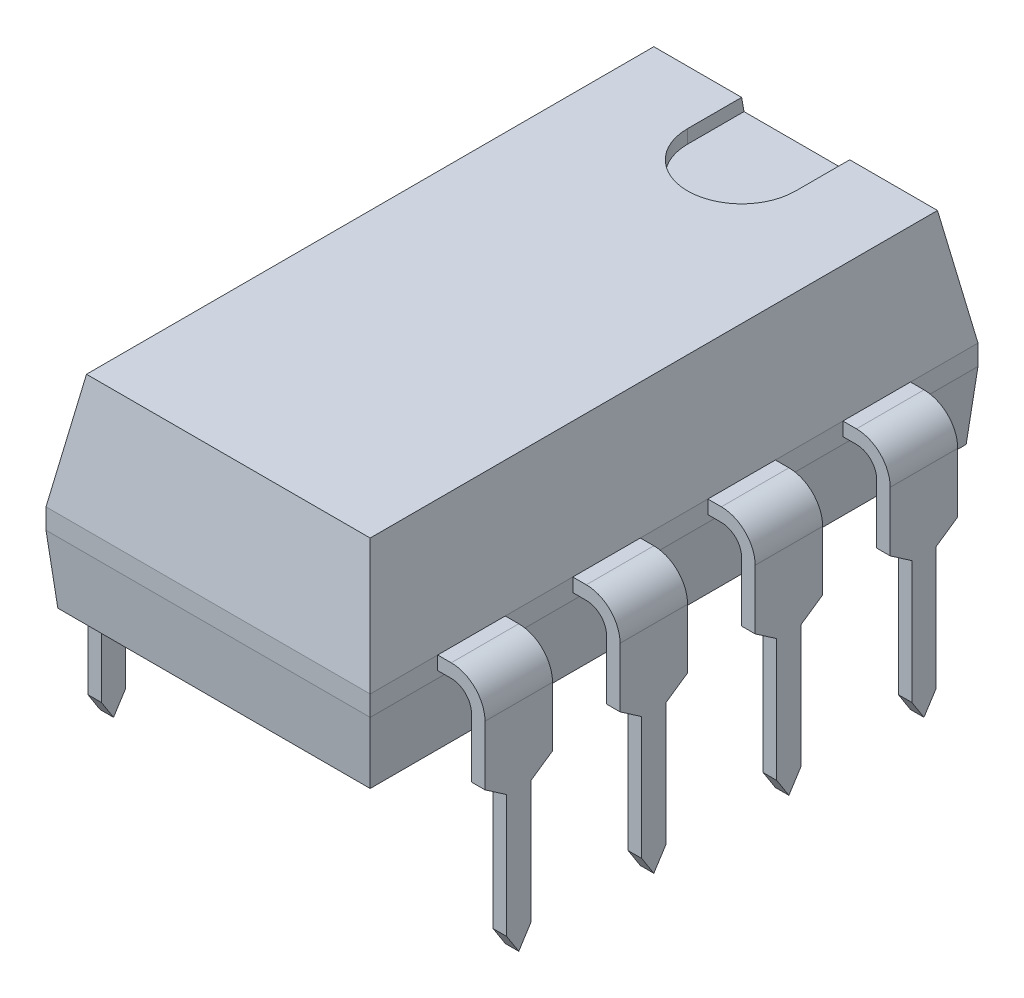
ISO-10303-21;
HEADER;
FILE_DESCRIPTION(('STEP AP214'),'2;1');
FILE_NAME('part.step','',(''),(''),'','','');
FILE_SCHEMA(('AUTOMOTIVE_DESIGN { 1 0 10303 214 1 1 1 1 }'));
ENDSEC;
DATA;
#1=APPLICATION_CONTEXT('core data for automotive mechanical design processes');
#2=APPLICATION_PROTOCOL_DEFINITION('international standard','automotive_design',2000,#1);
#3=PRODUCT_CONTEXT('',#1,'mechanical');
#4=PRODUCT('Part','Part','',(#3));
#5=PRODUCT_RELATED_PRODUCT_CATEGORY('part','',(#4));
#6=PRODUCT_DEFINITION_FORMATION('','',#4);
#7=PRODUCT_DEFINITION_CONTEXT('part definition',#1,'design');
#8=PRODUCT_DEFINITION('design','',#6,#7);
#9=PRODUCT_DEFINITION_SHAPE('','',#8);
#10=(LENGTH_UNIT() NAMED_UNIT(*) SI_UNIT(.MILLI.,.METRE.));
#11=(NAMED_UNIT(*) PLANE_ANGLE_UNIT() SI_UNIT($,.RADIAN.));
#12=(NAMED_UNIT(*) SI_UNIT($,.STERADIAN.) SOLID_ANGLE_UNIT());
#13=UNCERTAINTY_MEASURE_WITH_UNIT(LENGTH_MEASURE(1.E-05),#10,'distance_accuracy_value','');
#14=(GEOMETRIC_REPRESENTATION_CONTEXT(3) GLOBAL_UNCERTAINTY_ASSIGNED_CONTEXT((#13)) GLOBAL_UNIT_ASSIGNED_CONTEXT((#10,
#11,#12)) REPRESENTATION_CONTEXT('',''));
#15=CARTESIAN_POINT('',(0.,0.,0.));
#16=DIRECTION('',(0.,0.,1.));
#17=DIRECTION('',(1.,0.,0.));
#18=AXIS2_PLACEMENT_3D('',#15,#16,#17);
#19=CARTESIAN_POINT('',(7.74699999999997,1.397,6.98500000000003));
#20=DIRECTION('',(1.,0.,0.));
#21=DIRECTION('',(0.,0.,-1.));
#22=AXIS2_PLACEMENT_3D('',#19,#20,#21);
#23=PLANE('',#22);
#24=DIRECTION('',(0.,-1.,0.));
#25=VECTOR('',#24,1.);
#26=CARTESIAN_POINT('',(7.74699999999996,0.,7.39140000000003));
#27=LINE('',#26,#25);
#28=CARTESIAN_POINT('',(7.74699999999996,0.,7.39140000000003));
#29=VERTEX_POINT('',#28);
#30=CARTESIAN_POINT('',(7.74699999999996,-2.30951987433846,7.39140000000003));
#31=VERTEX_POINT('',#30);
#32=EDGE_CURVE('E756',#29,#31,#27,.T.);
#33=ORIENTED_EDGE('',*,*,#32,.F.);
#34=DIRECTION('',(0.,-0.566528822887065,0.824041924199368));
#35=VECTOR('',#34,1.);
#36=CARTESIAN_POINT('',(7.74699999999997,0.2794,6.98500000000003));
#37=LINE('',#36,#35);
#38=CARTESIAN_POINT('',(7.74699999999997,0.2794,6.98500000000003));
#39=VERTEX_POINT('',#38);
#40=EDGE_CURVE('E748',#39,#29,#37,.T.);
#41=ORIENTED_EDGE('',*,*,#40,.F.);
#42=DIRECTION('',(0.,1.,0.));
#43=VECTOR('',#42,1.);
#44=CARTESIAN_POINT('',(7.74699999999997,1.397,6.98500000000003));
#45=LINE('',#44,#43);
#46=CARTESIAN_POINT('',(7.74699999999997,1.397,6.98500000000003));
#47=VERTEX_POINT('',#46);
#48=EDGE_CURVE('E761',#39,#47,#45,.T.);
#49=ORIENTED_EDGE('',*,*,#48,.T.);
#50=DIRECTION('',(0.,0.,1.));
#51=VECTOR('',#50,1.);
#52=CARTESIAN_POINT('',(7.74699999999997,1.397,6.98500000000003));
#53=LINE('',#52,#51);
#54=CARTESIAN_POINT('',(7.74699999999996,1.397,8.25500000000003));
#55=VERTEX_POINT('',#54);
#56=EDGE_CURVE('E806',#47,#55,#53,.T.);
#57=ORIENTED_EDGE('',*,*,#56,.T.);
#58=DIRECTION('',(0.,1.,0.));
#59=VECTOR('',#58,1.);
#60=CARTESIAN_POINT('',(7.74699999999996,1.397,8.25500000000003));
#61=LINE('',#60,#59);
#62=CARTESIAN_POINT('',(7.74699999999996,0.2794,8.25500000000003));
#63=VERTEX_POINT('',#62);
#64=EDGE_CURVE('E792',#63,#55,#61,.T.);
#65=ORIENTED_EDGE('',*,*,#64,.F.);
#66=DIRECTION('',(0.,0.566528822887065,0.824041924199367));
#67=VECTOR('',#66,1.);
#68=CARTESIAN_POINT('',(7.74699999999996,0.2794,8.25500000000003));
#69=LINE('',#68,#67);
#70=CARTESIAN_POINT('',(7.74699999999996,0.,7.84860000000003));
#71=VERTEX_POINT('',#70);
#72=EDGE_CURVE('E1625',#71,#63,#69,.T.);
#73=ORIENTED_EDGE('',*,*,#72,.F.);
#74=DIRECTION('',(0.,1.,0.));
#75=VECTOR('',#74,1.);
#76=CARTESIAN_POINT('',(7.74699999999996,0.,7.84860000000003));
#77=LINE('',#76,#75);
#78=CARTESIAN_POINT('',(7.74699999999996,-2.30951987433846,7.84860000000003));
#79=VERTEX_POINT('',#78);
#80=EDGE_CURVE('E1633',#79,#71,#77,.T.);
#81=ORIENTED_EDGE('',*,*,#80,.F.);
#82=DIRECTION('',(0.,0.842471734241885,0.538740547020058));
#83=VECTOR('',#82,1.);
#84=CARTESIAN_POINT('',(7.74699999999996,-2.30951987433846,7.84860000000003));
#85=LINE('',#84,#83);
#86=CARTESIAN_POINT('',(7.74699999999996,-2.667,7.62000000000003));
#87=VERTEX_POINT('',#86);
#88=EDGE_CURVE('E1617',#87,#79,#85,.T.);
#89=ORIENTED_EDGE('',*,*,#88,.F.);
#90=DIRECTION('',(0.,-0.842471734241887,0.538740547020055));
#91=VECTOR('',#90,1.);
#92=CARTESIAN_POINT('',(7.74699999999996,-2.30951987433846,7.39140000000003));
#93=LINE('',#92,#91);
#94=EDGE_CURVE('E764',#31,#87,#93,.T.);
#95=ORIENTED_EDGE('',*,*,#94,.F.);
#96=EDGE_LOOP('',(#33,#41,#49,#57,#65,#73,#81,#89,#95));
#97=FACE_BOUND('',#96,.T.);
#98=ADVANCED_FACE('F30',(#97),#23,.T.);
#99=CARTESIAN_POINT('',(7.49299999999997,1.397,6.98500000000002));
#100=DIRECTION('',(1.,0.,0.));
#101=DIRECTION('',(0.,0.,-1.));
#102=AXIS2_PLACEMENT_3D('',#99,#100,#101);
#103=PLANE('',#102);
#104=DIRECTION('',(0.,-0.566528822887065,0.824041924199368));
#105=VECTOR('',#104,1.);
#106=CARTESIAN_POINT('',(7.49299999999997,0.2794,6.98500000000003));
#107=LINE('',#106,#105);
#108=CARTESIAN_POINT('',(7.49299999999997,0.2794,6.98500000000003));
#109=VERTEX_POINT('',#108);
#110=CARTESIAN_POINT('',(7.49299999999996,0.,7.39140000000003));
#111=VERTEX_POINT('',#110);
#112=EDGE_CURVE('E751',#109,#111,#107,.T.);
#113=ORIENTED_EDGE('',*,*,#112,.T.);
#114=DIRECTION('',(0.,-1.,0.));
#115=VECTOR('',#114,1.);
#116=CARTESIAN_POINT('',(7.49299999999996,0.,7.39140000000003));
#117=LINE('',#116,#115);
#118=CARTESIAN_POINT('',(7.49299999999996,-2.30951987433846,7.39140000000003));
#119=VERTEX_POINT('',#118);
#120=EDGE_CURVE('E765',#111,#119,#117,.T.);
#121=ORIENTED_EDGE('',*,*,#120,.T.);
#122=DIRECTION('',(0.,-0.842471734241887,0.538740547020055));
#123=VECTOR('',#122,1.);
#124=CARTESIAN_POINT('',(7.49299999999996,-2.30951987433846,7.39140000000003));
#125=LINE('',#124,#123);
#126=CARTESIAN_POINT('',(7.49299999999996,-2.667,7.62000000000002));
#127=VERTEX_POINT('',#126);
#128=EDGE_CURVE('E1707',#119,#127,#125,.T.);
#129=ORIENTED_EDGE('',*,*,#128,.T.);
#130=DIRECTION('',(0.,0.842471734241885,0.538740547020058));
#131=VECTOR('',#130,1.);
#132=CARTESIAN_POINT('',(7.49299999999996,-2.30951987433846,7.84860000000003));
#133=LINE('',#132,#131);
#134=CARTESIAN_POINT('',(7.49299999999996,-2.30951987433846,7.84860000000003));
#135=VERTEX_POINT('',#134);
#136=EDGE_CURVE('E1622',#127,#135,#133,.T.);
#137=ORIENTED_EDGE('',*,*,#136,.T.);
#138=DIRECTION('',(0.,1.,0.));
#139=VECTOR('',#138,1.);
#140=CARTESIAN_POINT('',(7.49299999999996,0.,7.84860000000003));
#141=LINE('',#140,#139);
#142=CARTESIAN_POINT('',(7.49299999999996,0.,7.84860000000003));
#143=VERTEX_POINT('',#142);
#144=EDGE_CURVE('E1626',#135,#143,#141,.T.);
#145=ORIENTED_EDGE('',*,*,#144,.T.);
#146=DIRECTION('',(0.,0.566528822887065,0.824041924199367));
#147=VECTOR('',#146,1.);
#148=CARTESIAN_POINT('',(7.49299999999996,0.2794,8.25500000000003));
#149=LINE('',#148,#147);
#150=CARTESIAN_POINT('',(7.49299999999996,0.279399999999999,8.25500000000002));
#151=VERTEX_POINT('',#150);
#152=EDGE_CURVE('E1629',#143,#151,#149,.T.);
#153=ORIENTED_EDGE('',*,*,#152,.T.);
#154=DIRECTION('',(0.,1.,0.));
#155=VECTOR('',#154,1.);
#156=CARTESIAN_POINT('',(7.49299999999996,1.397,8.25500000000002));
#157=LINE('',#156,#155);
#158=CARTESIAN_POINT('',(7.49299999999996,1.397,8.25500000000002));
#159=VERTEX_POINT('',#158);
#160=EDGE_CURVE('E794',#151,#159,#157,.T.);
#161=ORIENTED_EDGE('',*,*,#160,.T.);
#162=DIRECTION('',(0.,0.,1.));
#163=VECTOR('',#162,1.);
#164=CARTESIAN_POINT('',(7.49299999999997,1.397,6.98500000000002));
#165=LINE('',#164,#163);
#166=CARTESIAN_POINT('',(7.49299999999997,1.397,6.98500000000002));
#167=VERTEX_POINT('',#166);
#168=EDGE_CURVE('E803',#167,#159,#165,.T.);
#169=ORIENTED_EDGE('',*,*,#168,.F.);
#170=DIRECTION('',(0.,1.,0.));
#171=VECTOR('',#170,1.);
#172=CARTESIAN_POINT('',(7.49299999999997,1.397,6.98500000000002));
#173=LINE('',#172,#171);
#174=EDGE_CURVE('E772',#109,#167,#173,.T.);
#175=ORIENTED_EDGE('',*,*,#174,.F.);
#176=EDGE_LOOP('',(#113,#121,#129,#137,#145,#153,#161,#169,#175));
#177=FACE_BOUND('',#176,.T.);
#178=ADVANCED_FACE('F1731',(#177),#103,.F.);
#179=CARTESIAN_POINT('',(7.11199999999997,1.397,6.98500000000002));
#180=DIRECTION('',(0.,0.,1.));
#181=DIRECTION('',(1.,0.,0.));
#182=AXIS2_PLACEMENT_3D('',#179,#180,#181);
#183=PLANE('',#182);
#184=DIRECTION('',(-1.,0.,0.));
#185=VECTOR('',#184,1.);
#186=CARTESIAN_POINT('',(7.74699999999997,0.2794,6.98500000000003));
#187=LINE('',#186,#185);
#188=EDGE_CURVE('E744',#39,#109,#187,.T.);
#189=ORIENTED_EDGE('',*,*,#188,.T.);
#190=ORIENTED_EDGE('',*,*,#174,.T.);
#191=CARTESIAN_POINT('',(7.11199999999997,1.397,6.98500000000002));
#192=DIRECTION('',(0.,0.,1.));
#193=DIRECTION('',(1.,0.,0.));
#194=AXIS2_PLACEMENT_3D('',#191,#192,#193);
#195=CIRCLE('',#194,0.381);
#196=CARTESIAN_POINT('',(7.11199999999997,1.778,6.98500000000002));
#197=VERTEX_POINT('',#196);
#198=EDGE_CURVE('E774',#167,#197,#195,.T.);
#199=ORIENTED_EDGE('',*,*,#198,.T.);
#200=DIRECTION('',(1.,0.,0.));
#201=VECTOR('',#200,1.);
#202=CARTESIAN_POINT('',(7.11199999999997,1.778,6.98500000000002));
#203=LINE('',#202,#201);
#204=CARTESIAN_POINT('',(6.858,1.778,6.98500000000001));
#205=VERTEX_POINT('',#204);
#206=EDGE_CURVE('E781',#197,#205,#203,.F.);
#207=ORIENTED_EDGE('',*,*,#206,.T.);
#208=DIRECTION('',(0.,1.,0.));
#209=VECTOR('',#208,1.);
#210=CARTESIAN_POINT('',(6.858,4.191,6.98500000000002));
#211=LINE('',#210,#209);
#212=CARTESIAN_POINT('',(6.858,2.03199999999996,6.98500000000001));
#213=VERTEX_POINT('',#212);
#214=EDGE_CURVE('E11',#205,#213,#211,.T.);
#215=ORIENTED_EDGE('',*,*,#214,.T.);
#216=DIRECTION('',(1.,0.,0.));
#217=VECTOR('',#216,1.);
#218=CARTESIAN_POINT('',(7.11199999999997,2.032,6.98500000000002));
#219=LINE('',#218,#217);
#220=CARTESIAN_POINT('',(7.11199999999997,2.032,6.98500000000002));
#221=VERTEX_POINT('',#220);
#222=EDGE_CURVE('E776',#221,#213,#219,.F.);
#223=ORIENTED_EDGE('',*,*,#222,.F.);
#224=CARTESIAN_POINT('',(7.11199999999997,1.397,6.98500000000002));
#225=DIRECTION('',(0.,0.,1.));
#226=DIRECTION('',(1.,0.,0.));
#227=AXIS2_PLACEMENT_3D('',#224,#225,#226);
#228=CIRCLE('',#227,0.635);
#229=EDGE_CURVE('E771',#47,#221,#228,.T.);
#230=ORIENTED_EDGE('',*,*,#229,.F.);
#231=ORIENTED_EDGE('',*,*,#48,.F.);
#232=EDGE_LOOP('',(#189,#190,#199,#207,#215,#223,#230,#231));
#233=FACE_BOUND('',#232,.T.);
#234=ADVANCED_FACE('F768',(#233),#183,.F.);
#235=CARTESIAN_POINT('',(7.74699999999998,1.397,4.44500000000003));
#236=DIRECTION('',(1.,0.,0.));
#237=DIRECTION('',(0.,0.,-1.));
#238=AXIS2_PLACEMENT_3D('',#235,#236,#237);
#239=PLANE('',#238);
#240=DIRECTION('',(0.,-1.,0.));
#241=VECTOR('',#240,1.);
#242=CARTESIAN_POINT('',(7.74699999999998,0.,4.85140000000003));
#243=LINE('',#242,#241);
#244=CARTESIAN_POINT('',(7.74699999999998,0.,4.85140000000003));
#245=VERTEX_POINT('',#244);
#246=CARTESIAN_POINT('',(7.74699999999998,-2.30951987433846,4.85140000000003));
#247=VERTEX_POINT('',#246);
#248=EDGE_CURVE('E1684',#245,#247,#243,.T.);
#249=ORIENTED_EDGE('',*,*,#248,.F.);
#250=DIRECTION('',(0.,-0.566528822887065,0.824041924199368));
#251=VECTOR('',#250,1.);
#252=CARTESIAN_POINT('',(7.74699999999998,0.2794,4.44500000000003));
#253=LINE('',#252,#251);
#254=CARTESIAN_POINT('',(7.74699999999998,0.2794,4.44500000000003));
#255=VERTEX_POINT('',#254);
#256=EDGE_CURVE('E1691',#255,#245,#253,.T.);
#257=ORIENTED_EDGE('',*,*,#256,.F.);
#258=DIRECTION('',(0.,1.,0.));
#259=VECTOR('',#258,1.);
#260=CARTESIAN_POINT('',(7.74699999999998,1.397,4.44500000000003));
#261=LINE('',#260,#259);
#262=CARTESIAN_POINT('',(7.74699999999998,1.397,4.44500000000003));
#263=VERTEX_POINT('',#262);
#264=EDGE_CURVE('E818',#255,#263,#261,.T.);
#265=ORIENTED_EDGE('',*,*,#264,.T.);
#266=DIRECTION('',(0.,0.,1.));
#267=VECTOR('',#266,1.);
#268=CARTESIAN_POINT('',(7.74699999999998,1.397,4.44500000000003));
#269=LINE('',#268,#267);
#270=CARTESIAN_POINT('',(7.74699999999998,1.397,5.71500000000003));
#271=VERTEX_POINT('',#270);
#272=EDGE_CURVE('E846',#263,#271,#269,.T.);
#273=ORIENTED_EDGE('',*,*,#272,.T.);
#274=DIRECTION('',(0.,1.,0.));
#275=VECTOR('',#274,1.);
#276=CARTESIAN_POINT('',(7.74699999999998,1.397,5.71500000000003));
#277=LINE('',#276,#275);
#278=CARTESIAN_POINT('',(7.74699999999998,0.2794,5.71500000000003));
#279=VERTEX_POINT('',#278);
#280=EDGE_CURVE('E833',#279,#271,#277,.T.);
#281=ORIENTED_EDGE('',*,*,#280,.F.);
#282=DIRECTION('',(0.,0.566528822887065,0.824041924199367));
#283=VECTOR('',#282,1.);
#284=CARTESIAN_POINT('',(7.74699999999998,0.2794,5.71500000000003));
#285=LINE('',#284,#283);
#286=CARTESIAN_POINT('',(7.74699999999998,0.,5.30860000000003));
#287=VERTEX_POINT('',#286);
#288=EDGE_CURVE('E1604',#287,#279,#285,.T.);
#289=ORIENTED_EDGE('',*,*,#288,.F.);
#290=DIRECTION('',(0.,1.,0.));
#291=VECTOR('',#290,1.);
#292=CARTESIAN_POINT('',(7.74699999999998,0.,5.30860000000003));
#293=LINE('',#292,#291);
#294=CARTESIAN_POINT('',(7.74699999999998,-2.30951987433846,5.30860000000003));
#295=VERTEX_POINT('',#294);
#296=EDGE_CURVE('E1612',#295,#287,#293,.T.);
#297=ORIENTED_EDGE('',*,*,#296,.F.);
#298=DIRECTION('',(0.,0.842471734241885,0.538740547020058));
#299=VECTOR('',#298,1.);
#300=CARTESIAN_POINT('',(7.74699999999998,-2.30951987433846,5.30860000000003));
#301=LINE('',#300,#299);
#302=CARTESIAN_POINT('',(7.74699999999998,-2.667,5.08000000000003));
#303=VERTEX_POINT('',#302);
#304=EDGE_CURVE('E1596',#303,#295,#301,.T.);
#305=ORIENTED_EDGE('',*,*,#304,.F.);
#306=DIRECTION('',(0.,-0.842471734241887,0.538740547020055));
#307=VECTOR('',#306,1.);
#308=CARTESIAN_POINT('',(7.74699999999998,-2.30951987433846,4.85140000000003));
#309=LINE('',#308,#307);
#310=EDGE_CURVE('E1700',#247,#303,#309,.T.);
#311=ORIENTED_EDGE('',*,*,#310,.F.);
#312=EDGE_LOOP('',(#249,#257,#265,#273,#281,#289,#297,#305,#311));
#313=FACE_BOUND('',#312,.T.);
#314=ADVANCED_FACE('F1781',(#313),#239,.T.);
#315=CARTESIAN_POINT('',(7.49299999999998,1.397,4.44500000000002));
#316=DIRECTION('',(1.,0.,0.));
#317=DIRECTION('',(0.,0.,-1.));
#318=AXIS2_PLACEMENT_3D('',#315,#316,#317);
#319=PLANE('',#318);
#320=DIRECTION('',(0.,-0.566528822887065,0.824041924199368));
#321=VECTOR('',#320,1.);
#322=CARTESIAN_POINT('',(7.49299999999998,0.2794,4.44500000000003));
#323=LINE('',#322,#321);
#324=CARTESIAN_POINT('',(7.49299999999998,0.2794,4.44500000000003));
#325=VERTEX_POINT('',#324);
#326=CARTESIAN_POINT('',(7.49299999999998,0.,4.85140000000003));
#327=VERTEX_POINT('',#326);
#328=EDGE_CURVE('E1695',#325,#327,#323,.T.);
#329=ORIENTED_EDGE('',*,*,#328,.T.);
#330=DIRECTION('',(0.,-1.,0.));
#331=VECTOR('',#330,1.);
#332=CARTESIAN_POINT('',(7.49299999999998,0.,4.85140000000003));
#333=LINE('',#332,#331);
#334=CARTESIAN_POINT('',(7.49299999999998,-2.30951987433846,4.85140000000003));
#335=VERTEX_POINT('',#334);
#336=EDGE_CURVE('E1688',#327,#335,#333,.T.);
#337=ORIENTED_EDGE('',*,*,#336,.T.);
#338=DIRECTION('',(0.,-0.842471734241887,0.538740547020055));
#339=VECTOR('',#338,1.);
#340=CARTESIAN_POINT('',(7.49299999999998,-2.30951987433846,4.85140000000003));
#341=LINE('',#340,#339);
#342=CARTESIAN_POINT('',(7.49299999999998,-2.667,5.08000000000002));
#343=VERTEX_POINT('',#342);
#344=EDGE_CURVE('E1692',#335,#343,#341,.T.);
#345=ORIENTED_EDGE('',*,*,#344,.T.);
#346=DIRECTION('',(0.,0.842471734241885,0.538740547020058));
#347=VECTOR('',#346,1.);
#348=CARTESIAN_POINT('',(7.49299999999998,-2.30951987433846,5.30860000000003));
#349=LINE('',#348,#347);
#350=CARTESIAN_POINT('',(7.49299999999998,-2.30951987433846,5.30860000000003));
#351=VERTEX_POINT('',#350);
#352=EDGE_CURVE('E1601',#343,#351,#349,.T.);
#353=ORIENTED_EDGE('',*,*,#352,.T.);
#354=DIRECTION('',(0.,1.,0.));
#355=VECTOR('',#354,1.);
#356=CARTESIAN_POINT('',(7.49299999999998,0.,5.30860000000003));
#357=LINE('',#356,#355);
#358=CARTESIAN_POINT('',(7.49299999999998,0.,5.30860000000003));
#359=VERTEX_POINT('',#358);
#360=EDGE_CURVE('E1605',#351,#359,#357,.T.);
#361=ORIENTED_EDGE('',*,*,#360,.T.);
#362=DIRECTION('',(0.,0.566528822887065,0.824041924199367));
#363=VECTOR('',#362,1.);
#364=CARTESIAN_POINT('',(7.49299999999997,0.2794,5.71500000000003));
#365=LINE('',#364,#363);
#366=CARTESIAN_POINT('',(7.49299999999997,0.279399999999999,5.71500000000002));
#367=VERTEX_POINT('',#366);
#368=EDGE_CURVE('E1608',#359,#367,#365,.T.);
#369=ORIENTED_EDGE('',*,*,#368,.T.);
#370=DIRECTION('',(0.,1.,0.));
#371=VECTOR('',#370,1.);
#372=CARTESIAN_POINT('',(7.49299999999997,1.397,5.71500000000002));
#373=LINE('',#372,#371);
#374=CARTESIAN_POINT('',(7.49299999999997,1.397,5.71500000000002));
#375=VERTEX_POINT('',#374);
#376=EDGE_CURVE('E835',#367,#375,#373,.T.);
#377=ORIENTED_EDGE('',*,*,#376,.T.);
#378=DIRECTION('',(0.,0.,1.));
#379=VECTOR('',#378,1.);
#380=CARTESIAN_POINT('',(7.49299999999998,1.397,4.44500000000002));
#381=LINE('',#380,#379);
#382=CARTESIAN_POINT('',(7.49299999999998,1.397,4.44500000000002));
#383=VERTEX_POINT('',#382);
#384=EDGE_CURVE('E843',#383,#375,#381,.T.);
#385=ORIENTED_EDGE('',*,*,#384,.F.);
#386=DIRECTION('',(0.,1.,0.));
#387=VECTOR('',#386,1.);
#388=CARTESIAN_POINT('',(7.49299999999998,1.397,4.44500000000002));
#389=LINE('',#388,#387);
#390=EDGE_CURVE('E820',#325,#383,#389,.T.);
#391=ORIENTED_EDGE('',*,*,#390,.F.);
#392=EDGE_LOOP('',(#329,#337,#345,#353,#361,#369,#377,#385,#391));
#393=FACE_BOUND('',#392,.T.);
#394=ADVANCED_FACE('F1761',(#393),#319,.F.);
#395=CARTESIAN_POINT('',(7.11199999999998,1.397,4.44500000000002));
#396=DIRECTION('',(0.,0.,1.));
#397=DIRECTION('',(1.,0.,0.));
#398=AXIS2_PLACEMENT_3D('',#395,#396,#397);
#399=PLANE('',#398);
#400=DIRECTION('',(-1.,0.,0.));
#401=VECTOR('',#400,1.);
#402=CARTESIAN_POINT('',(7.74699999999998,0.2794,4.44500000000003));
#403=LINE('',#402,#401);
#404=EDGE_CURVE('E1680',#255,#325,#403,.T.);
#405=ORIENTED_EDGE('',*,*,#404,.T.);
#406=ORIENTED_EDGE('',*,*,#390,.T.);
#407=CARTESIAN_POINT('',(7.11199999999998,1.397,4.44500000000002));
#408=DIRECTION('',(0.,0.,1.));
#409=DIRECTION('',(1.,0.,0.));
#410=AXIS2_PLACEMENT_3D('',#407,#408,#409);
#411=CIRCLE('',#410,0.381);
#412=CARTESIAN_POINT('',(7.11199999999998,1.778,4.44500000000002));
#413=VERTEX_POINT('',#412);
#414=EDGE_CURVE('E822',#383,#413,#411,.T.);
#415=ORIENTED_EDGE('',*,*,#414,.T.);
#416=DIRECTION('',(1.,0.,0.));
#417=VECTOR('',#416,1.);
#418=CARTESIAN_POINT('',(7.11199999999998,1.778,4.44500000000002));
#419=LINE('',#418,#417);
#420=CARTESIAN_POINT('',(6.858,1.778,4.44500000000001));
#421=VERTEX_POINT('',#420);
#422=EDGE_CURVE('E824',#413,#421,#419,.F.);
#423=ORIENTED_EDGE('',*,*,#422,.T.);
#424=DIRECTION('',(0.,1.,0.));
#425=VECTOR('',#424,1.);
#426=CARTESIAN_POINT('',(6.858,4.191,4.44500000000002));
#427=LINE('',#426,#425);
#428=CARTESIAN_POINT('',(6.858,2.03199999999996,4.44500000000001));
#429=VERTEX_POINT('',#428);
#430=EDGE_CURVE('E1458',#421,#429,#427,.T.);
#431=ORIENTED_EDGE('',*,*,#430,.T.);
#432=DIRECTION('',(1.,0.,0.));
#433=VECTOR('',#432,1.);
#434=CARTESIAN_POINT('',(7.11199999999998,2.032,4.44500000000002));
#435=LINE('',#434,#433);
#436=CARTESIAN_POINT('',(7.11199999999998,2.032,4.44500000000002));
#437=VERTEX_POINT('',#436);
#438=EDGE_CURVE('E811',#437,#429,#435,.F.);
#439=ORIENTED_EDGE('',*,*,#438,.F.);
#440=CARTESIAN_POINT('',(7.11199999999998,1.397,4.44500000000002));
#441=DIRECTION('',(0.,0.,1.));
#442=DIRECTION('',(1.,0.,0.));
#443=AXIS2_PLACEMENT_3D('',#440,#441,#442);
#444=CIRCLE('',#443,0.635);
#445=EDGE_CURVE('E814',#263,#437,#444,.T.);
#446=ORIENTED_EDGE('',*,*,#445,.F.);
#447=ORIENTED_EDGE('',*,*,#264,.F.);
#448=EDGE_LOOP('',(#405,#406,#415,#423,#431,#439,#446,#447));
#449=FACE_BOUND('',#448,.T.);
#450=ADVANCED_FACE('F1757',(#449),#399,.F.);
#451=CARTESIAN_POINT('',(7.747,1.397,1.90500000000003));
#452=DIRECTION('',(1.,0.,0.));
#453=DIRECTION('',(0.,0.,-1.));
#454=AXIS2_PLACEMENT_3D('',#451,#452,#453);
#455=PLANE('',#454);
#456=DIRECTION('',(0.,-1.,0.));
#457=VECTOR('',#456,1.);
#458=CARTESIAN_POINT('',(7.747,0.,2.31140000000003));
#459=LINE('',#458,#457);
#460=CARTESIAN_POINT('',(7.747,0.,2.31140000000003));
#461=VERTEX_POINT('',#460);
#462=CARTESIAN_POINT('',(7.747,-2.30951987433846,2.31140000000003));
#463=VERTEX_POINT('',#462);
#464=EDGE_CURVE('E1661',#461,#463,#459,.T.);
#465=ORIENTED_EDGE('',*,*,#464,.F.);
#466=DIRECTION('',(0.,-0.566528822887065,0.824041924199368));
#467=VECTOR('',#466,1.);
#468=CARTESIAN_POINT('',(7.747,0.2794,1.90500000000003));
#469=LINE('',#468,#467);
#470=CARTESIAN_POINT('',(7.747,0.2794,1.90500000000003));
#471=VERTEX_POINT('',#470);
#472=EDGE_CURVE('E1668',#471,#461,#469,.T.);
#473=ORIENTED_EDGE('',*,*,#472,.F.);
#474=DIRECTION('',(0.,1.,0.));
#475=VECTOR('',#474,1.);
#476=CARTESIAN_POINT('',(7.747,1.397,1.90500000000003));
#477=LINE('',#476,#475);
#478=CARTESIAN_POINT('',(7.747,1.397,1.90500000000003));
#479=VERTEX_POINT('',#478);
#480=EDGE_CURVE('E859',#471,#479,#477,.T.);
#481=ORIENTED_EDGE('',*,*,#480,.T.);
#482=DIRECTION('',(0.,0.,1.));
#483=VECTOR('',#482,1.);
#484=CARTESIAN_POINT('',(7.747,1.397,1.90500000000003));
#485=LINE('',#484,#483);
#486=CARTESIAN_POINT('',(7.74699999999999,1.397,3.17500000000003));
#487=VERTEX_POINT('',#486);
#488=EDGE_CURVE('E887',#479,#487,#485,.T.);
#489=ORIENTED_EDGE('',*,*,#488,.T.);
#490=DIRECTION('',(0.,1.,0.));
#491=VECTOR('',#490,1.);
#492=CARTESIAN_POINT('',(7.74699999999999,1.397,3.17500000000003));
#493=LINE('',#492,#491);
#494=CARTESIAN_POINT('',(7.74699999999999,0.2794,3.17500000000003));
#495=VERTEX_POINT('',#494);
#496=EDGE_CURVE('E874',#495,#487,#493,.T.);
#497=ORIENTED_EDGE('',*,*,#496,.F.);
#498=DIRECTION('',(0.,0.566528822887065,0.824041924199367));
#499=VECTOR('',#498,1.);
#500=CARTESIAN_POINT('',(7.74699999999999,0.2794,3.17500000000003));
#501=LINE('',#500,#499);
#502=CARTESIAN_POINT('',(7.747,0.,2.76860000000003));
#503=VERTEX_POINT('',#502);
#504=EDGE_CURVE('E1582',#503,#495,#501,.T.);
#505=ORIENTED_EDGE('',*,*,#504,.F.);
#506=DIRECTION('',(0.,1.,0.));
#507=VECTOR('',#506,1.);
#508=CARTESIAN_POINT('',(7.747,0.,2.76860000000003));
#509=LINE('',#508,#507);
#510=CARTESIAN_POINT('',(7.747,-2.30951987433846,2.76860000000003));
#511=VERTEX_POINT('',#510);
#512=EDGE_CURVE('E1591',#511,#503,#509,.T.);
#513=ORIENTED_EDGE('',*,*,#512,.F.);
#514=DIRECTION('',(0.,0.842471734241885,0.538740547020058));
#515=VECTOR('',#514,1.);
#516=CARTESIAN_POINT('',(7.747,-2.30951987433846,2.76860000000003));
#517=LINE('',#516,#515);
#518=CARTESIAN_POINT('',(7.747,-2.667,2.54000000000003));
#519=VERTEX_POINT('',#518);
#520=EDGE_CURVE('E1576',#519,#511,#517,.T.);
#521=ORIENTED_EDGE('',*,*,#520,.F.);
#522=DIRECTION('',(0.,-0.842471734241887,0.538740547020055));
#523=VECTOR('',#522,1.);
#524=CARTESIAN_POINT('',(7.747,-2.30951987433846,2.31140000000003));
#525=LINE('',#524,#523);
#526=EDGE_CURVE('E1677',#463,#519,#525,.T.);
#527=ORIENTED_EDGE('',*,*,#526,.F.);
#528=EDGE_LOOP('',(#465,#473,#481,#489,#497,#505,#513,#521,#527));
#529=FACE_BOUND('',#528,.T.);
#530=ADVANCED_FACE('F1760',(#529),#455,.T.);
#531=CARTESIAN_POINT('',(7.493,1.397,1.90500000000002));
#532=DIRECTION('',(1.,0.,0.));
#533=DIRECTION('',(0.,0.,-1.));
#534=AXIS2_PLACEMENT_3D('',#531,#532,#533);
#535=PLANE('',#534);
#536=DIRECTION('',(0.,-0.566528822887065,0.824041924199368));
#537=VECTOR('',#536,1.);
#538=CARTESIAN_POINT('',(7.493,0.2794,1.90500000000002));
#539=LINE('',#538,#537);
#540=CARTESIAN_POINT('',(7.493,0.2794,1.90500000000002));
#541=VERTEX_POINT('',#540);
#542=CARTESIAN_POINT('',(7.493,0.,2.31140000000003));
#543=VERTEX_POINT('',#542);
#544=EDGE_CURVE('E1672',#541,#543,#539,.T.);
#545=ORIENTED_EDGE('',*,*,#544,.T.);
#546=DIRECTION('',(0.,-1.,0.));
#547=VECTOR('',#546,1.);
#548=CARTESIAN_POINT('',(7.493,0.,2.31140000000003));
#549=LINE('',#548,#547);
#550=CARTESIAN_POINT('',(7.493,-2.30951987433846,2.31140000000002));
#551=VERTEX_POINT('',#550);
#552=EDGE_CURVE('E1665',#543,#551,#549,.T.);
#553=ORIENTED_EDGE('',*,*,#552,.T.);
#554=DIRECTION('',(0.,-0.842471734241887,0.538740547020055));
#555=VECTOR('',#554,1.);
#556=CARTESIAN_POINT('',(7.493,-2.30951987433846,2.31140000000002));
#557=LINE('',#556,#555);
#558=CARTESIAN_POINT('',(7.493,-2.667,2.54000000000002));
#559=VERTEX_POINT('',#558);
#560=EDGE_CURVE('E1669',#551,#559,#557,.T.);
#561=ORIENTED_EDGE('',*,*,#560,.T.);
#562=DIRECTION('',(0.,0.842471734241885,0.538740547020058));
#563=VECTOR('',#562,1.);
#564=CARTESIAN_POINT('',(7.49299999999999,-2.30951987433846,2.76860000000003));
#565=LINE('',#564,#563);
#566=CARTESIAN_POINT('',(7.49299999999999,-2.30951987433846,2.76860000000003));
#567=VERTEX_POINT('',#566);
#568=EDGE_CURVE('E1579',#559,#567,#565,.T.);
#569=ORIENTED_EDGE('',*,*,#568,.T.);
#570=DIRECTION('',(0.,1.,0.));
#571=VECTOR('',#570,1.);
#572=CARTESIAN_POINT('',(7.49299999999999,0.,2.76860000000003));
#573=LINE('',#572,#571);
#574=CARTESIAN_POINT('',(7.49299999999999,0.,2.76860000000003));
#575=VERTEX_POINT('',#574);
#576=EDGE_CURVE('E1583',#567,#575,#573,.T.);
#577=ORIENTED_EDGE('',*,*,#576,.T.);
#578=DIRECTION('',(0.,0.566528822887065,0.824041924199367));
#579=VECTOR('',#578,1.);
#580=CARTESIAN_POINT('',(7.49299999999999,0.2794,3.17500000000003));
#581=LINE('',#580,#579);
#582=CARTESIAN_POINT('',(7.49299999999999,0.279399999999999,3.17500000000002));
#583=VERTEX_POINT('',#582);
#584=EDGE_CURVE('E1586',#575,#583,#581,.T.);
#585=ORIENTED_EDGE('',*,*,#584,.T.);
#586=DIRECTION('',(0.,1.,0.));
#587=VECTOR('',#586,1.);
#588=CARTESIAN_POINT('',(7.49299999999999,1.397,3.17500000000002));
#589=LINE('',#588,#587);
#590=CARTESIAN_POINT('',(7.49299999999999,1.397,3.17500000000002));
#591=VERTEX_POINT('',#590);
#592=EDGE_CURVE('E876',#583,#591,#589,.T.);
#593=ORIENTED_EDGE('',*,*,#592,.T.);
#594=DIRECTION('',(0.,0.,1.));
#595=VECTOR('',#594,1.);
#596=CARTESIAN_POINT('',(7.493,1.397,1.90500000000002));
#597=LINE('',#596,#595);
#598=CARTESIAN_POINT('',(7.493,1.397,1.90500000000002));
#599=VERTEX_POINT('',#598);
#600=EDGE_CURVE('E884',#599,#591,#597,.T.);
#601=ORIENTED_EDGE('',*,*,#600,.F.);
#602=DIRECTION('',(0.,1.,0.));
#603=VECTOR('',#602,1.);
#604=CARTESIAN_POINT('',(7.493,1.397,1.90500000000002));
#605=LINE('',#604,#603);
#606=EDGE_CURVE('E861',#541,#599,#605,.T.);
#607=ORIENTED_EDGE('',*,*,#606,.F.);
#608=EDGE_LOOP('',(#545,#553,#561,#569,#577,#585,#593,#601,#607));
#609=FACE_BOUND('',#608,.T.);
#610=ADVANCED_FACE('F1795',(#609),#535,.F.);
#611=CARTESIAN_POINT('',(7.112,1.397,1.90500000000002));
#612=DIRECTION('',(0.,0.,1.));
#613=DIRECTION('',(1.,0.,0.));
#614=AXIS2_PLACEMENT_3D('',#611,#612,#613);
#615=PLANE('',#614);
#616=DIRECTION('',(-1.,0.,0.));
#617=VECTOR('',#616,1.);
#618=CARTESIAN_POINT('',(7.747,0.2794,1.90500000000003));
#619=LINE('',#618,#617);
#620=EDGE_CURVE('E1657',#471,#541,#619,.T.);
#621=ORIENTED_EDGE('',*,*,#620,.T.);
#622=ORIENTED_EDGE('',*,*,#606,.T.);
#623=CARTESIAN_POINT('',(7.112,1.397,1.90500000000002));
#624=DIRECTION('',(0.,0.,1.));
#625=DIRECTION('',(1.,0.,0.));
#626=AXIS2_PLACEMENT_3D('',#623,#624,#625);
#627=CIRCLE('',#626,0.381);
#628=CARTESIAN_POINT('',(7.112,1.778,1.90500000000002));
#629=VERTEX_POINT('',#628);
#630=EDGE_CURVE('E863',#599,#629,#627,.T.);
#631=ORIENTED_EDGE('',*,*,#630,.T.);
#632=DIRECTION('',(1.,0.,0.));
#633=VECTOR('',#632,1.);
#634=CARTESIAN_POINT('',(7.112,1.778,1.90500000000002));
#635=LINE('',#634,#633);
#636=CARTESIAN_POINT('',(6.858,1.778,1.90500000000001));
#637=VERTEX_POINT('',#636);
#638=EDGE_CURVE('E865',#629,#637,#635,.F.);
#639=ORIENTED_EDGE('',*,*,#638,.T.);
#640=DIRECTION('',(0.,1.,0.));
#641=VECTOR('',#640,1.);
#642=CARTESIAN_POINT('',(6.858,4.191,1.90500000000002));
#643=LINE('',#642,#641);
#644=CARTESIAN_POINT('',(6.858,2.03199999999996,1.90500000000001));
#645=VERTEX_POINT('',#644);
#646=EDGE_CURVE('E1449',#637,#645,#643,.T.);
#647=ORIENTED_EDGE('',*,*,#646,.T.);
#648=DIRECTION('',(1.,0.,0.));
#649=VECTOR('',#648,1.);
#650=CARTESIAN_POINT('',(7.112,2.032,1.90500000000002));
#651=LINE('',#650,#649);
#652=CARTESIAN_POINT('',(7.112,2.032,1.90500000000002));
#653=VERTEX_POINT('',#652);
#654=EDGE_CURVE('E852',#653,#645,#651,.F.);
#655=ORIENTED_EDGE('',*,*,#654,.F.);
#656=CARTESIAN_POINT('',(7.112,1.397,1.90500000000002));
#657=DIRECTION('',(0.,0.,1.));
#658=DIRECTION('',(1.,0.,0.));
#659=AXIS2_PLACEMENT_3D('',#656,#657,#658);
#660=CIRCLE('',#659,0.635);
#661=EDGE_CURVE('E855',#479,#653,#660,.T.);
#662=ORIENTED_EDGE('',*,*,#661,.F.);
#663=ORIENTED_EDGE('',*,*,#480,.F.);
#664=EDGE_LOOP('',(#621,#622,#631,#639,#647,#655,#662,#663));
#665=FACE_BOUND('',#664,.T.);
#666=ADVANCED_FACE('F1791',(#665),#615,.F.);
#667=CARTESIAN_POINT('',(7.74700000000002,1.397,-0.634999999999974));
#668=DIRECTION('',(1.,0.,0.));
#669=DIRECTION('',(0.,0.,-1.));
#670=AXIS2_PLACEMENT_3D('',#667,#668,#669);
#671=PLANE('',#670);
#672=DIRECTION('',(0.,-1.,0.));
#673=VECTOR('',#672,1.);
#674=CARTESIAN_POINT('',(7.74700000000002,0.,-0.228599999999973));
#675=LINE('',#674,#673);
#676=CARTESIAN_POINT('',(7.74700000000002,0.,-0.228599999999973));
#677=VERTEX_POINT('',#676);
#678=CARTESIAN_POINT('',(7.74700000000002,-2.30951987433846,-0.228599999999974));
#679=VERTEX_POINT('',#678);
#680=EDGE_CURVE('E1639',#677,#679,#675,.T.);
#681=ORIENTED_EDGE('',*,*,#680,.F.);
#682=DIRECTION('',(0.,-0.566528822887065,0.824041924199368));
#683=VECTOR('',#682,1.);
#684=CARTESIAN_POINT('',(7.74700000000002,0.2794,-0.634999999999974));
#685=LINE('',#684,#683);
#686=CARTESIAN_POINT('',(7.74700000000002,0.2794,-0.634999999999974));
#687=VERTEX_POINT('',#686);
#688=EDGE_CURVE('E1646',#687,#677,#685,.T.);
#689=ORIENTED_EDGE('',*,*,#688,.F.);
#690=DIRECTION('',(0.,1.,0.));
#691=VECTOR('',#690,1.);
#692=CARTESIAN_POINT('',(7.74700000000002,1.397,-0.634999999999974));
#693=LINE('',#692,#691);
#694=CARTESIAN_POINT('',(7.74700000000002,1.397,-0.634999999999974));
#695=VERTEX_POINT('',#694);
#696=EDGE_CURVE('E900',#687,#695,#693,.T.);
#697=ORIENTED_EDGE('',*,*,#696,.T.);
#698=DIRECTION('',(0.,0.,1.));
#699=VECTOR('',#698,1.);
#700=CARTESIAN_POINT('',(7.74700000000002,1.397,-0.634999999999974));
#701=LINE('',#700,#699);
#702=CARTESIAN_POINT('',(7.74700000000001,1.397,0.635000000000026));
#703=VERTEX_POINT('',#702);
#704=EDGE_CURVE('E928',#695,#703,#701,.T.);
#705=ORIENTED_EDGE('',*,*,#704,.T.);
#706=DIRECTION('',(0.,1.,0.));
#707=VECTOR('',#706,1.);
#708=CARTESIAN_POINT('',(7.74700000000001,1.397,0.635000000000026));
#709=LINE('',#708,#707);
#710=CARTESIAN_POINT('',(7.74700000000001,0.2794,0.635000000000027));
#711=VERTEX_POINT('',#710);
#712=EDGE_CURVE('E915',#711,#703,#709,.T.);
#713=ORIENTED_EDGE('',*,*,#712,.F.);
#714=DIRECTION('',(0.,0.566528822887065,0.824041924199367));
#715=VECTOR('',#714,1.);
#716=CARTESIAN_POINT('',(7.74700000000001,0.2794,0.635000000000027));
#717=LINE('',#716,#715);
#718=CARTESIAN_POINT('',(7.74700000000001,0.,0.228600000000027));
#719=VERTEX_POINT('',#718);
#720=EDGE_CURVE('E1557',#719,#711,#717,.T.);
#721=ORIENTED_EDGE('',*,*,#720,.F.);
#722=DIRECTION('',(0.,1.,0.));
#723=VECTOR('',#722,1.);
#724=CARTESIAN_POINT('',(7.74700000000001,0.,0.228600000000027));
#725=LINE('',#724,#723);
#726=CARTESIAN_POINT('',(7.74700000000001,-2.30951987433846,0.228600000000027));
#727=VERTEX_POINT('',#726);
#728=EDGE_CURVE('E1564',#727,#719,#725,.T.);
#729=ORIENTED_EDGE('',*,*,#728,.F.);
#730=DIRECTION('',(0.,0.842471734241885,0.538740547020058));
#731=VECTOR('',#730,1.);
#732=CARTESIAN_POINT('',(7.74700000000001,-2.30951987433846,0.228600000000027));
#733=LINE('',#732,#731);
#734=CARTESIAN_POINT('',(7.74700000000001,-2.667,0.));
#735=VERTEX_POINT('',#734);
#736=EDGE_CURVE('E1553',#735,#727,#733,.T.);
#737=ORIENTED_EDGE('',*,*,#736,.F.);
#738=DIRECTION('',(0.,-0.842471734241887,0.538740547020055));
#739=VECTOR('',#738,1.);
#740=CARTESIAN_POINT('',(7.74700000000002,-2.30951987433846,-0.228599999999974));
#741=LINE('',#740,#739);
#742=EDGE_CURVE('E1654',#679,#735,#741,.T.);
#743=ORIENTED_EDGE('',*,*,#742,.F.);
#744=EDGE_LOOP('',(#681,#689,#697,#705,#713,#721,#729,#737,#743));
#745=FACE_BOUND('',#744,.T.);
#746=ADVANCED_FACE('F1794',(#745),#671,.T.);
#747=CARTESIAN_POINT('',(7.49300000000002,1.397,-0.634999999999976));
#748=DIRECTION('',(1.,0.,0.));
#749=DIRECTION('',(0.,0.,-1.));
#750=AXIS2_PLACEMENT_3D('',#747,#748,#749);
#751=PLANE('',#750);
#752=DIRECTION('',(0.,-0.566528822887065,0.824041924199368));
#753=VECTOR('',#752,1.);
#754=CARTESIAN_POINT('',(7.49300000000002,0.2794,-0.634999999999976));
#755=LINE('',#754,#753);
#756=CARTESIAN_POINT('',(7.49300000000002,0.2794,-0.634999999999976));
#757=VERTEX_POINT('',#756);
#758=CARTESIAN_POINT('',(7.49300000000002,0.,-0.228599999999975));
#759=VERTEX_POINT('',#758);
#760=EDGE_CURVE('E1650',#757,#759,#755,.T.);
#761=ORIENTED_EDGE('',*,*,#760,.T.);
#762=DIRECTION('',(0.,-1.,0.));
#763=VECTOR('',#762,1.);
#764=CARTESIAN_POINT('',(7.49300000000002,0.,-0.228599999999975));
#765=LINE('',#764,#763);
#766=CARTESIAN_POINT('',(7.49300000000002,-2.30951987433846,-0.228599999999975));
#767=VERTEX_POINT('',#766);
#768=EDGE_CURVE('E1643',#759,#767,#765,.T.);
#769=ORIENTED_EDGE('',*,*,#768,.T.);
#770=DIRECTION('',(0.,-0.842471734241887,0.538740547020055));
#771=VECTOR('',#770,1.);
#772=CARTESIAN_POINT('',(7.49300000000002,-2.30951987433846,-0.228599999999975));
#773=LINE('',#772,#771);
#774=CARTESIAN_POINT('',(7.49300000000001,-2.667,0.));
#775=VERTEX_POINT('',#774);
#776=EDGE_CURVE('E1647',#767,#775,#773,.T.);
#777=ORIENTED_EDGE('',*,*,#776,.T.);
#778=DIRECTION('',(0.,0.842471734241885,0.538740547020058));
#779=VECTOR('',#778,1.);
#780=CARTESIAN_POINT('',(7.49300000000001,-2.30951987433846,0.228600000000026));
#781=LINE('',#780,#779);
#782=CARTESIAN_POINT('',(7.49300000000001,-2.30951987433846,0.228600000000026));
#783=VERTEX_POINT('',#782);
#784=EDGE_CURVE('E1548',#775,#783,#781,.T.);
#785=ORIENTED_EDGE('',*,*,#784,.T.);
#786=DIRECTION('',(0.,1.,0.));
#787=VECTOR('',#786,1.);
#788=CARTESIAN_POINT('',(7.49300000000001,0.,0.228600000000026));
#789=LINE('',#788,#787);
#790=CARTESIAN_POINT('',(7.49300000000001,0.,0.228600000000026));
#791=VERTEX_POINT('',#790);
#792=EDGE_CURVE('E1543',#783,#791,#789,.T.);
#793=ORIENTED_EDGE('',*,*,#792,.T.);
#794=DIRECTION('',(0.,0.566528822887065,0.824041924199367));
#795=VECTOR('',#794,1.);
#796=CARTESIAN_POINT('',(7.49300000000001,0.2794,0.635000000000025));
#797=LINE('',#796,#795);
#798=CARTESIAN_POINT('',(7.49300000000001,0.279399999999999,0.635000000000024));
#799=VERTEX_POINT('',#798);
#800=EDGE_CURVE('E1540',#791,#799,#797,.T.);
#801=ORIENTED_EDGE('',*,*,#800,.T.);
#802=DIRECTION('',(0.,1.,0.));
#803=VECTOR('',#802,1.);
#804=CARTESIAN_POINT('',(7.49300000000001,1.397,0.635000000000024));
#805=LINE('',#804,#803);
#806=CARTESIAN_POINT('',(7.49300000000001,1.397,0.635000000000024));
#807=VERTEX_POINT('',#806);
#808=EDGE_CURVE('E917',#799,#807,#805,.T.);
#809=ORIENTED_EDGE('',*,*,#808,.T.);
#810=DIRECTION('',(0.,0.,1.));
#811=VECTOR('',#810,1.);
#812=CARTESIAN_POINT('',(7.49300000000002,1.397,-0.634999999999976));
#813=LINE('',#812,#811);
#814=CARTESIAN_POINT('',(7.49300000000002,1.397,-0.634999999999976));
#815=VERTEX_POINT('',#814);
#816=EDGE_CURVE('E925',#815,#807,#813,.T.);
#817=ORIENTED_EDGE('',*,*,#816,.F.);
#818=DIRECTION('',(0.,1.,0.));
#819=VECTOR('',#818,1.);
#820=CARTESIAN_POINT('',(7.49300000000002,1.397,-0.634999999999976));
#821=LINE('',#820,#819);
#822=EDGE_CURVE('E902',#757,#815,#821,.T.);
#823=ORIENTED_EDGE('',*,*,#822,.F.);
#824=EDGE_LOOP('',(#761,#769,#777,#785,#793,#801,#809,#817,#823));
#825=FACE_BOUND('',#824,.T.);
#826=ADVANCED_FACE('F1536',(#825),#751,.F.);
#827=CARTESIAN_POINT('',(7.11200000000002,1.397,-0.634999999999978));
#828=DIRECTION('',(0.,0.,1.));
#829=DIRECTION('',(1.,0.,0.));
#830=AXIS2_PLACEMENT_3D('',#827,#828,#829);
#831=PLANE('',#830);
#832=DIRECTION('',(-1.,0.,0.));
#833=VECTOR('',#832,1.);
#834=CARTESIAN_POINT('',(7.74700000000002,0.2794,-0.634999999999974));
#835=LINE('',#834,#833);
#836=EDGE_CURVE('E1636',#687,#757,#835,.T.);
#837=ORIENTED_EDGE('',*,*,#836,.T.);
#838=ORIENTED_EDGE('',*,*,#822,.T.);
#839=CARTESIAN_POINT('',(7.11200000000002,1.397,-0.634999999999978));
#840=DIRECTION('',(0.,0.,1.));
#841=DIRECTION('',(1.,0.,0.));
#842=AXIS2_PLACEMENT_3D('',#839,#840,#841);
#843=CIRCLE('',#842,0.381);
#844=CARTESIAN_POINT('',(7.11200000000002,1.778,-0.634999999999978));
#845=VERTEX_POINT('',#844);
#846=EDGE_CURVE('E904',#815,#845,#843,.T.);
#847=ORIENTED_EDGE('',*,*,#846,.T.);
#848=DIRECTION('',(1.,0.,0.));
#849=VECTOR('',#848,1.);
#850=CARTESIAN_POINT('',(7.11200000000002,1.778,-0.634999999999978));
#851=LINE('',#850,#849);
#852=CARTESIAN_POINT('',(6.858,1.778,-0.634999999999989));
#853=VERTEX_POINT('',#852);
#854=EDGE_CURVE('E906',#845,#853,#851,.F.);
#855=ORIENTED_EDGE('',*,*,#854,.T.);
#856=DIRECTION('',(0.,1.,0.));
#857=VECTOR('',#856,1.);
#858=CARTESIAN_POINT('',(6.858,4.191,-0.63499999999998));
#859=LINE('',#858,#857);
#860=CARTESIAN_POINT('',(6.858,2.03199999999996,-0.634999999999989));
#861=VERTEX_POINT('',#860);
#862=EDGE_CURVE('E1440',#853,#861,#859,.T.);
#863=ORIENTED_EDGE('',*,*,#862,.T.);
#864=DIRECTION('',(1.,0.,0.));
#865=VECTOR('',#864,1.);
#866=CARTESIAN_POINT('',(7.11200000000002,2.032,-0.634999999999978));
#867=LINE('',#866,#865);
#868=CARTESIAN_POINT('',(7.11200000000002,2.032,-0.634999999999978));
#869=VERTEX_POINT('',#868);
#870=EDGE_CURVE('E893',#869,#861,#867,.F.);
#871=ORIENTED_EDGE('',*,*,#870,.F.);
#872=CARTESIAN_POINT('',(7.11200000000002,1.397,-0.634999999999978));
#873=DIRECTION('',(0.,0.,1.));
#874=DIRECTION('',(1.,0.,0.));
#875=AXIS2_PLACEMENT_3D('',#872,#873,#874);
#876=CIRCLE('',#875,0.635);
#877=EDGE_CURVE('E896',#695,#869,#876,.T.);
#878=ORIENTED_EDGE('',*,*,#877,.F.);
#879=ORIENTED_EDGE('',*,*,#696,.F.);
#880=EDGE_LOOP('',(#837,#838,#847,#855,#863,#871,#878,#879));
#881=FACE_BOUND('',#880,.T.);
#882=ADVANCED_FACE('F1521',(#881),#831,.F.);
#883=CARTESIAN_POINT('',(7.11199999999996,1.397,8.25500000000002));
#884=DIRECTION('',(0.,0.,1.));
#885=DIRECTION('',(1.,0.,0.));
#886=AXIS2_PLACEMENT_3D('',#883,#884,#885);
#887=PLANE('',#886);
#888=ORIENTED_EDGE('',*,*,#160,.F.);
#889=DIRECTION('',(-1.,0.,0.));
#890=VECTOR('',#889,1.);
#891=CARTESIAN_POINT('',(7.74699999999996,0.2794,8.25500000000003));
#892=LINE('',#891,#890);
#893=EDGE_CURVE('E45',#63,#151,#892,.T.);
#894=ORIENTED_EDGE('',*,*,#893,.F.);
#895=ORIENTED_EDGE('',*,*,#64,.T.);
#896=CARTESIAN_POINT('',(7.11199999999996,1.397,8.25500000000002));
#897=DIRECTION('',(0.,0.,1.));
#898=DIRECTION('',(1.,0.,0.));
#899=AXIS2_PLACEMENT_3D('',#896,#897,#898);
#900=CIRCLE('',#899,0.635);
#901=CARTESIAN_POINT('',(7.11199999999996,2.032,8.25500000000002));
#902=VERTEX_POINT('',#901);
#903=EDGE_CURVE('E788',#55,#902,#900,.T.);
#904=ORIENTED_EDGE('',*,*,#903,.T.);
#905=DIRECTION('',(1.,0.,0.));
#906=VECTOR('',#905,1.);
#907=CARTESIAN_POINT('',(7.11199999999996,2.032,8.25500000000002));
#908=LINE('',#907,#906);
#909=CARTESIAN_POINT('',(6.85799999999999,2.032,8.25500000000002));
#910=VERTEX_POINT('',#909);
#911=EDGE_CURVE('E785',#902,#910,#908,.F.);
#912=ORIENTED_EDGE('',*,*,#911,.T.);
#913=DIRECTION('',(0.,1.,0.));
#914=VECTOR('',#913,1.);
#915=CARTESIAN_POINT('',(6.858,4.191,8.25500000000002));
#916=LINE('',#915,#914);
#917=CARTESIAN_POINT('',(6.858,1.778,8.25500000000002));
#918=VERTEX_POINT('',#917);
#919=EDGE_CURVE('E1461',#918,#910,#916,.T.);
#920=ORIENTED_EDGE('',*,*,#919,.F.);
#921=DIRECTION('',(1.,0.,0.));
#922=VECTOR('',#921,1.);
#923=CARTESIAN_POINT('',(7.11199999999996,1.778,8.25500000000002));
#924=LINE('',#923,#922);
#925=CARTESIAN_POINT('',(7.11199999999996,1.778,8.25500000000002));
#926=VERTEX_POINT('',#925);
#927=EDGE_CURVE('E798',#926,#918,#924,.F.);
#928=ORIENTED_EDGE('',*,*,#927,.F.);
#929=CARTESIAN_POINT('',(7.11199999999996,1.397,8.25500000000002));
#930=DIRECTION('',(0.,0.,1.));
#931=DIRECTION('',(1.,0.,0.));
#932=AXIS2_PLACEMENT_3D('',#929,#930,#931);
#933=CIRCLE('',#932,0.381);
#934=EDGE_CURVE('E796',#159,#926,#933,.T.);
#935=ORIENTED_EDGE('',*,*,#934,.F.);
#936=EDGE_LOOP('',(#888,#894,#895,#904,#912,#920,#928,#935));
#937=FACE_BOUND('',#936,.T.);
#938=ADVANCED_FACE('F1479',(#937),#887,.T.);
#939=CARTESIAN_POINT('',(7.11199999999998,1.397,5.71500000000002));
#940=DIRECTION('',(0.,0.,1.));
#941=DIRECTION('',(1.,0.,0.));
#942=AXIS2_PLACEMENT_3D('',#939,#940,#941);
#943=PLANE('',#942);
#944=ORIENTED_EDGE('',*,*,#376,.F.);
#945=DIRECTION('',(-1.,0.,0.));
#946=VECTOR('',#945,1.);
#947=CARTESIAN_POINT('',(7.74699999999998,0.2794,5.71500000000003));
#948=LINE('',#947,#946);
#949=EDGE_CURVE('E53',#279,#367,#948,.T.);
#950=ORIENTED_EDGE('',*,*,#949,.F.);
#951=ORIENTED_EDGE('',*,*,#280,.T.);
#952=CARTESIAN_POINT('',(7.11199999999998,1.397,5.71500000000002));
#953=DIRECTION('',(0.,0.,1.));
#954=DIRECTION('',(1.,0.,0.));
#955=AXIS2_PLACEMENT_3D('',#952,#953,#954);
#956=CIRCLE('',#955,0.635);
#957=CARTESIAN_POINT('',(7.11199999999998,2.032,5.71500000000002));
#958=VERTEX_POINT('',#957);
#959=EDGE_CURVE('E830',#271,#958,#956,.T.);
#960=ORIENTED_EDGE('',*,*,#959,.T.);
#961=DIRECTION('',(1.,0.,0.));
#962=VECTOR('',#961,1.);
#963=CARTESIAN_POINT('',(7.11199999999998,2.032,5.71500000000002));
#964=LINE('',#963,#962);
#965=CARTESIAN_POINT('',(6.85799999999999,2.032,5.71500000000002));
#966=VERTEX_POINT('',#965);
#967=EDGE_CURVE('E810',#958,#966,#964,.F.);
#968=ORIENTED_EDGE('',*,*,#967,.T.);
#969=DIRECTION('',(0.,1.,0.));
#970=VECTOR('',#969,1.);
#971=CARTESIAN_POINT('',(6.858,4.191,5.71500000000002));
#972=LINE('',#971,#970);
#973=CARTESIAN_POINT('',(6.858,1.778,5.71500000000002));
#974=VERTEX_POINT('',#973);
#975=EDGE_CURVE('E1452',#974,#966,#972,.T.);
#976=ORIENTED_EDGE('',*,*,#975,.F.);
#977=DIRECTION('',(1.,0.,0.));
#978=VECTOR('',#977,1.);
#979=CARTESIAN_POINT('',(7.11199999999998,1.778,5.71500000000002));
#980=LINE('',#979,#978);
#981=CARTESIAN_POINT('',(7.11199999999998,1.778,5.71500000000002));
#982=VERTEX_POINT('',#981);
#983=EDGE_CURVE('E815',#982,#974,#980,.F.);
#984=ORIENTED_EDGE('',*,*,#983,.F.);
#985=CARTESIAN_POINT('',(7.11199999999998,1.397,5.71500000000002));
#986=DIRECTION('',(0.,0.,1.));
#987=DIRECTION('',(1.,0.,0.));
#988=AXIS2_PLACEMENT_3D('',#985,#986,#987);
#989=CIRCLE('',#988,0.381);
#990=EDGE_CURVE('E837',#375,#982,#989,.T.);
#991=ORIENTED_EDGE('',*,*,#990,.F.);
#992=EDGE_LOOP('',(#944,#950,#951,#960,#968,#976,#984,#991));
#993=FACE_BOUND('',#992,.T.);
#994=ADVANCED_FACE('F1763',(#993),#943,.T.);
#995=CARTESIAN_POINT('',(7.11199999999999,1.397,3.17500000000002));
#996=DIRECTION('',(0.,0.,1.));
#997=DIRECTION('',(1.,0.,0.));
#998=AXIS2_PLACEMENT_3D('',#995,#996,#997);
#999=PLANE('',#998);
#1000=ORIENTED_EDGE('',*,*,#592,.F.);
#1001=DIRECTION('',(-1.,0.,0.));
#1002=VECTOR('',#1001,1.);
#1003=CARTESIAN_POINT('',(7.74699999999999,0.2794,3.17500000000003));
#1004=LINE('',#1003,#1002);
#1005=EDGE_CURVE('E1573',#495,#583,#1004,.T.);
#1006=ORIENTED_EDGE('',*,*,#1005,.F.);
#1007=ORIENTED_EDGE('',*,*,#496,.T.);
#1008=CARTESIAN_POINT('',(7.11199999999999,1.397,3.17500000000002));
#1009=DIRECTION('',(0.,0.,1.));
#1010=DIRECTION('',(1.,0.,0.));
#1011=AXIS2_PLACEMENT_3D('',#1008,#1009,#1010);
#1012=CIRCLE('',#1011,0.635);
#1013=CARTESIAN_POINT('',(7.11199999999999,2.032,3.17500000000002));
#1014=VERTEX_POINT('',#1013);
#1015=EDGE_CURVE('E871',#487,#1014,#1012,.T.);
#1016=ORIENTED_EDGE('',*,*,#1015,.T.);
#1017=DIRECTION('',(1.,0.,0.));
#1018=VECTOR('',#1017,1.);
#1019=CARTESIAN_POINT('',(7.11199999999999,2.032,3.17500000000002));
#1020=LINE('',#1019,#1018);
#1021=CARTESIAN_POINT('',(6.85799999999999,2.032,3.17500000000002));
#1022=VERTEX_POINT('',#1021);
#1023=EDGE_CURVE('E851',#1014,#1022,#1020,.F.);
#1024=ORIENTED_EDGE('',*,*,#1023,.T.);
#1025=DIRECTION('',(0.,1.,0.));
#1026=VECTOR('',#1025,1.);
#1027=CARTESIAN_POINT('',(6.858,4.191,3.17500000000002));
#1028=LINE('',#1027,#1026);
#1029=CARTESIAN_POINT('',(6.858,1.778,3.17500000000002));
#1030=VERTEX_POINT('',#1029);
#1031=EDGE_CURVE('E1443',#1030,#1022,#1028,.T.);
#1032=ORIENTED_EDGE('',*,*,#1031,.F.);
#1033=DIRECTION('',(1.,0.,0.));
#1034=VECTOR('',#1033,1.);
#1035=CARTESIAN_POINT('',(7.11199999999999,1.778,3.17500000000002));
#1036=LINE('',#1035,#1034);
#1037=CARTESIAN_POINT('',(7.11199999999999,1.778,3.17500000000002));
#1038=VERTEX_POINT('',#1037);
#1039=EDGE_CURVE('E856',#1038,#1030,#1036,.F.);
#1040=ORIENTED_EDGE('',*,*,#1039,.F.);
#1041=CARTESIAN_POINT('',(7.11199999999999,1.397,3.17500000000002));
#1042=DIRECTION('',(0.,0.,1.));
#1043=DIRECTION('',(1.,0.,0.));
#1044=AXIS2_PLACEMENT_3D('',#1041,#1042,#1043);
#1045=CIRCLE('',#1044,0.381);
#1046=EDGE_CURVE('E878',#591,#1038,#1045,.T.);
#1047=ORIENTED_EDGE('',*,*,#1046,.F.);
#1048=EDGE_LOOP('',(#1000,#1006,#1007,#1016,#1024,#1032,#1040,#1047));
#1049=FACE_BOUND('',#1048,.T.);
#1050=ADVANCED_FACE('F1766',(#1049),#999,.T.);
#1051=CARTESIAN_POINT('',(7.11200000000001,1.397,0.635000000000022));
#1052=DIRECTION('',(0.,0.,1.));
#1053=DIRECTION('',(1.,0.,0.));
#1054=AXIS2_PLACEMENT_3D('',#1051,#1052,#1053);
#1055=PLANE('',#1054);
#1056=ORIENTED_EDGE('',*,*,#808,.F.);
#1057=DIRECTION('',(-1.,0.,0.));
#1058=VECTOR('',#1057,1.);
#1059=CARTESIAN_POINT('',(7.74700000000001,0.2794,0.635000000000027));
#1060=LINE('',#1059,#1058);
#1061=EDGE_CURVE('E1563',#711,#799,#1060,.T.);
#1062=ORIENTED_EDGE('',*,*,#1061,.F.);
#1063=ORIENTED_EDGE('',*,*,#712,.T.);
#1064=CARTESIAN_POINT('',(7.11200000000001,1.397,0.635000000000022));
#1065=DIRECTION('',(0.,0.,1.));
#1066=DIRECTION('',(1.,0.,0.));
#1067=AXIS2_PLACEMENT_3D('',#1064,#1065,#1066);
#1068=CIRCLE('',#1067,0.635);
#1069=CARTESIAN_POINT('',(7.11200000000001,2.032,0.635000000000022));
#1070=VERTEX_POINT('',#1069);
#1071=EDGE_CURVE('E912',#703,#1070,#1068,.T.);
#1072=ORIENTED_EDGE('',*,*,#1071,.T.);
#1073=DIRECTION('',(1.,0.,0.));
#1074=VECTOR('',#1073,1.);
#1075=CARTESIAN_POINT('',(7.11200000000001,2.032,0.635000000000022));
#1076=LINE('',#1075,#1074);
#1077=CARTESIAN_POINT('',(6.85799999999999,2.032,0.63500000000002));
#1078=VERTEX_POINT('',#1077);
#1079=EDGE_CURVE('E892',#1070,#1078,#1076,.F.);
#1080=ORIENTED_EDGE('',*,*,#1079,.T.);
#1081=DIRECTION('',(0.,1.,0.));
#1082=VECTOR('',#1081,1.);
#1083=CARTESIAN_POINT('',(6.858,4.191,0.63500000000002));
#1084=LINE('',#1083,#1082);
#1085=CARTESIAN_POINT('',(6.858,1.778,0.63500000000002));
#1086=VERTEX_POINT('',#1085);
#1087=EDGE_CURVE('E1434',#1086,#1078,#1084,.T.);
#1088=ORIENTED_EDGE('',*,*,#1087,.F.);
#1089=DIRECTION('',(1.,0.,0.));
#1090=VECTOR('',#1089,1.);
#1091=CARTESIAN_POINT('',(7.11200000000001,1.778,0.635000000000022));
#1092=LINE('',#1091,#1090);
#1093=CARTESIAN_POINT('',(7.11200000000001,1.778,0.635000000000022));
#1094=VERTEX_POINT('',#1093);
#1095=EDGE_CURVE('E897',#1094,#1086,#1092,.F.);
#1096=ORIENTED_EDGE('',*,*,#1095,.F.);
#1097=CARTESIAN_POINT('',(7.11200000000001,1.397,0.635000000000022));
#1098=DIRECTION('',(0.,0.,1.));
#1099=DIRECTION('',(1.,0.,0.));
#1100=AXIS2_PLACEMENT_3D('',#1097,#1098,#1099);
#1101=CIRCLE('',#1100,0.381);
#1102=EDGE_CURVE('E919',#807,#1094,#1101,.T.);
#1103=ORIENTED_EDGE('',*,*,#1102,.F.);
#1104=EDGE_LOOP('',(#1056,#1062,#1063,#1072,#1080,#1088,#1096,#1103));
#1105=FACE_BOUND('',#1104,.T.);
#1106=ADVANCED_FACE('F1510',(#1105),#1055,.T.);
#1107=CARTESIAN_POINT('',(6.858,4.191,-1.905));
#1108=DIRECTION('',(-1.,0.,0.));
#1109=DIRECTION('',(0.,0.,1.));
#1110=AXIS2_PLACEMENT_3D('',#1107,#1108,#1109);
#1111=PLANE('',#1110);
#1112=ORIENTED_EDGE('',*,*,#214,.F.);
#1113=DIRECTION('',(0.,0.,-1.));
#1114=VECTOR('',#1113,1.);
#1115=CARTESIAN_POINT('',(6.858,1.778,-1.905));
#1116=LINE('',#1115,#1114);
#1117=EDGE_CURVE('E38',#918,#205,#1116,.T.);
#1118=ORIENTED_EDGE('',*,*,#1117,.F.);
#1119=ORIENTED_EDGE('',*,*,#919,.T.);
#1120=DIRECTION('',(0.,0.,1.));
#1121=VECTOR('',#1120,1.);
#1122=CARTESIAN_POINT('',(6.858,2.03199999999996,-1.905));
#1123=LINE('',#1122,#1121);
#1124=CARTESIAN_POINT('',(6.858,2.03199999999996,9.525));
#1125=VERTEX_POINT('',#1124);
#1126=EDGE_CURVE('E1341',#910,#1125,#1123,.T.);
#1127=ORIENTED_EDGE('',*,*,#1126,.T.);
#1128=DIRECTION('',(0.,-1.,0.));
#1129=VECTOR('',#1128,1.);
#1130=CARTESIAN_POINT('',(6.858,4.191,9.525));
#1131=LINE('',#1130,#1129);
#1132=CARTESIAN_POINT('',(6.858,1.65100000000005,9.525));
#1133=VERTEX_POINT('',#1132);
#1134=EDGE_CURVE('E1320',#1125,#1133,#1131,.T.);
#1135=ORIENTED_EDGE('',*,*,#1134,.T.);
#1136=DIRECTION('',(0.,0.,-1.));
#1137=VECTOR('',#1136,1.);
#1138=CARTESIAN_POINT('',(6.858,1.65100000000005,-1.905));
#1139=LINE('',#1138,#1137);
#1140=CARTESIAN_POINT('',(6.858,1.65100000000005,-1.905));
#1141=VERTEX_POINT('',#1140);
#1142=EDGE_CURVE('E1382',#1133,#1141,#1139,.T.);
#1143=ORIENTED_EDGE('',*,*,#1142,.T.);
#1144=DIRECTION('',(0.,-1.,0.));
#1145=VECTOR('',#1144,1.);
#1146=CARTESIAN_POINT('',(6.858,4.191,-1.905));
#1147=LINE('',#1146,#1145);
#1148=CARTESIAN_POINT('',(6.858,2.03199999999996,-1.905));
#1149=VERTEX_POINT('',#1148);
#1150=EDGE_CURVE('E1317',#1149,#1141,#1147,.T.);
#1151=ORIENTED_EDGE('',*,*,#1150,.F.);
#1152=EDGE_CURVE('E1342',#1149,#861,#1123,.T.);
#1153=ORIENTED_EDGE('',*,*,#1152,.T.);
#1154=ORIENTED_EDGE('',*,*,#862,.F.);
#1155=DIRECTION('',(0.,0.,-1.));
#1156=VECTOR('',#1155,1.);
#1157=CARTESIAN_POINT('',(6.858,1.778,-1.905));
#1158=LINE('',#1157,#1156);
#1159=EDGE_CURVE('E1437',#1086,#853,#1158,.T.);
#1160=ORIENTED_EDGE('',*,*,#1159,.F.);
#1161=ORIENTED_EDGE('',*,*,#1087,.T.);
#1162=EDGE_CURVE('E1497',#1078,#645,#1123,.T.);
#1163=ORIENTED_EDGE('',*,*,#1162,.T.);
#1164=ORIENTED_EDGE('',*,*,#646,.F.);
#1165=DIRECTION('',(0.,0.,-1.));
#1166=VECTOR('',#1165,1.);
#1167=CARTESIAN_POINT('',(6.858,1.778,-1.905));
#1168=LINE('',#1167,#1166);
#1169=EDGE_CURVE('E1446',#1030,#637,#1168,.T.);
#1170=ORIENTED_EDGE('',*,*,#1169,.F.);
#1171=ORIENTED_EDGE('',*,*,#1031,.T.);
#1172=EDGE_CURVE('E1491',#1022,#429,#1123,.T.);
#1173=ORIENTED_EDGE('',*,*,#1172,.T.);
#1174=ORIENTED_EDGE('',*,*,#430,.F.);
#1175=DIRECTION('',(0.,0.,-1.));
#1176=VECTOR('',#1175,1.);
#1177=CARTESIAN_POINT('',(6.858,1.778,-1.905));
#1178=LINE('',#1177,#1176);
#1179=EDGE_CURVE('E1455',#974,#421,#1178,.T.);
#1180=ORIENTED_EDGE('',*,*,#1179,.F.);
#1181=ORIENTED_EDGE('',*,*,#975,.T.);
#1182=EDGE_CURVE('E1488',#966,#213,#1123,.T.);
#1183=ORIENTED_EDGE('',*,*,#1182,.T.);
#1184=EDGE_LOOP('',(#1112,#1118,#1119,#1127,#1135,#1143,#1151,#1153,#1154,#1160,#1161,#1163,
#1164,#1170,#1171,#1173,#1174,#1180,#1181,#1183));
#1185=FACE_BOUND('',#1184,.T.);
#1186=ADVANCED_FACE('F1482',(#1185),#1111,.F.);
#1187=CARTESIAN_POINT('',(0.762,4.191,-1.905));
#1188=DIRECTION('',(0.,0.,1.));
#1189=DIRECTION('',(1.,0.,0.));
#1190=AXIS2_PLACEMENT_3D('',#1187,#1188,#1189);
#1191=PLANE('',#1190);
#1192=ORIENTED_EDGE('',*,*,#1150,.T.);
#1193=DIRECTION('',(-1.,0.,0.));
#1194=VECTOR('',#1193,1.);
#1195=CARTESIAN_POINT('',(0.762,1.65100000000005,-1.905));
#1196=LINE('',#1195,#1194);
#1197=CARTESIAN_POINT('',(0.762,1.65100000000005,-1.905));
#1198=VERTEX_POINT('',#1197);
#1199=EDGE_CURVE('E1384',#1141,#1198,#1196,.T.);
#1200=ORIENTED_EDGE('',*,*,#1199,.T.);
#1201=DIRECTION('',(0.,-1.,0.));
#1202=VECTOR('',#1201,1.);
#1203=CARTESIAN_POINT('',(0.762,4.191,-1.905));
#1204=LINE('',#1203,#1202);
#1205=CARTESIAN_POINT('',(0.762,2.03199999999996,-1.905));
#1206=VERTEX_POINT('',#1205);
#1207=EDGE_CURVE('E1327',#1206,#1198,#1204,.T.);
#1208=ORIENTED_EDGE('',*,*,#1207,.F.);
#1209=DIRECTION('',(1.,0.,0.));
#1210=VECTOR('',#1209,1.);
#1211=CARTESIAN_POINT('',(0.762,2.03199999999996,-1.905));
#1212=LINE('',#1211,#1210);
#1213=EDGE_CURVE('E1352',#1206,#1149,#1212,.T.);
#1214=ORIENTED_EDGE('',*,*,#1213,.T.);
#1215=EDGE_LOOP('',(#1192,#1200,#1208,#1214));
#1216=FACE_BOUND('',#1215,.T.);
#1217=ADVANCED_FACE('F2090',(#1216),#1191,.F.);
#1218=CARTESIAN_POINT('',(0.762,4.191,-1.905));
#1219=DIRECTION('',(1.,0.,0.));
#1220=DIRECTION('',(0.,0.,-1.));
#1221=AXIS2_PLACEMENT_3D('',#1218,#1219,#1220);
#1222=PLANE('',#1221);
#1223=DIRECTION('',(0.,0.,-1.));
#1224=VECTOR('',#1223,1.);
#1225=CARTESIAN_POINT('',(0.762,1.778,-1.905));
#1226=LINE('',#1225,#1224);
#1227=CARTESIAN_POINT('',(0.762000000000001,1.778,8.255));
#1228=VERTEX_POINT('',#1227);
#1229=CARTESIAN_POINT('',(0.762000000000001,1.778,6.985));
#1230=VERTEX_POINT('',#1229);
#1231=EDGE_CURVE('E1429',#1228,#1230,#1226,.T.);
#1232=ORIENTED_EDGE('',*,*,#1231,.T.);
#1233=DIRECTION('',(0.,1.,0.));
#1234=VECTOR('',#1233,1.);
#1235=CARTESIAN_POINT('',(0.762000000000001,4.191,6.985));
#1236=LINE('',#1235,#1234);
#1237=CARTESIAN_POINT('',(0.762000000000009,2.032,6.985));
#1238=VERTEX_POINT('',#1237);
#1239=EDGE_CURVE('E1431',#1230,#1238,#1236,.T.);
#1240=ORIENTED_EDGE('',*,*,#1239,.T.);
#1241=DIRECTION('',(0.,0.,-1.));
#1242=VECTOR('',#1241,1.);
#1243=CARTESIAN_POINT('',(0.762,2.03199999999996,-1.905));
#1244=LINE('',#1243,#1242);
#1245=CARTESIAN_POINT('',(0.762000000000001,2.03199999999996,5.715));
#1246=VERTEX_POINT('',#1245);
#1247=EDGE_CURVE('E1354',#1238,#1246,#1244,.T.);
#1248=ORIENTED_EDGE('',*,*,#1247,.T.);
#1249=DIRECTION('',(0.,1.,0.));
#1250=VECTOR('',#1249,1.);
#1251=CARTESIAN_POINT('',(0.762000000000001,4.191,5.715));
#1252=LINE('',#1251,#1250);
#1253=CARTESIAN_POINT('',(0.762000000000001,1.778,5.715));
#1254=VERTEX_POINT('',#1253);
#1255=EDGE_CURVE('E1418',#1254,#1246,#1252,.T.);
#1256=ORIENTED_EDGE('',*,*,#1255,.F.);
#1257=DIRECTION('',(0.,0.,-1.));
#1258=VECTOR('',#1257,1.);
#1259=CARTESIAN_POINT('',(0.762,1.778,-1.905));
#1260=LINE('',#1259,#1258);
#1261=CARTESIAN_POINT('',(0.762,1.778,4.445));
#1262=VERTEX_POINT('',#1261);
#1263=EDGE_CURVE('E1421',#1254,#1262,#1260,.T.);
#1264=ORIENTED_EDGE('',*,*,#1263,.T.);
#1265=DIRECTION('',(0.,1.,0.));
#1266=VECTOR('',#1265,1.);
#1267=CARTESIAN_POINT('',(0.762,4.191,4.445));
#1268=LINE('',#1267,#1266);
#1269=CARTESIAN_POINT('',(0.762000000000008,2.032,4.445));
#1270=VERTEX_POINT('',#1269);
#1271=EDGE_CURVE('E1423',#1262,#1270,#1268,.T.);
#1272=ORIENTED_EDGE('',*,*,#1271,.T.);
#1273=CARTESIAN_POINT('',(0.762,2.03199999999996,3.175));
#1274=VERTEX_POINT('',#1273);
#1275=EDGE_CURVE('E2186',#1270,#1274,#1244,.T.);
#1276=ORIENTED_EDGE('',*,*,#1275,.T.);
#1277=DIRECTION('',(0.,1.,0.));
#1278=VECTOR('',#1277,1.);
#1279=CARTESIAN_POINT('',(0.762,4.191,3.175));
#1280=LINE('',#1279,#1278);
#1281=CARTESIAN_POINT('',(0.762,1.778,3.175));
#1282=VERTEX_POINT('',#1281);
#1283=EDGE_CURVE('E1410',#1282,#1274,#1280,.T.);
#1284=ORIENTED_EDGE('',*,*,#1283,.F.);
#1285=DIRECTION('',(0.,0.,-1.));
#1286=VECTOR('',#1285,1.);
#1287=CARTESIAN_POINT('',(0.762,1.778,-1.905));
#1288=LINE('',#1287,#1286);
#1289=CARTESIAN_POINT('',(0.762,1.778,1.905));
#1290=VERTEX_POINT('',#1289);
#1291=EDGE_CURVE('E1413',#1282,#1290,#1288,.T.);
#1292=ORIENTED_EDGE('',*,*,#1291,.T.);
#1293=DIRECTION('',(0.,1.,0.));
#1294=VECTOR('',#1293,1.);
#1295=CARTESIAN_POINT('',(0.762,4.191,1.905));
#1296=LINE('',#1295,#1294);
#1297=CARTESIAN_POINT('',(0.762000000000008,2.032,1.905));
#1298=VERTEX_POINT('',#1297);
#1299=EDGE_CURVE('E1415',#1290,#1298,#1296,.T.);
#1300=ORIENTED_EDGE('',*,*,#1299,.T.);
#1301=CARTESIAN_POINT('',(0.762,2.03199999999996,0.634999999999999));
#1302=VERTEX_POINT('',#1301);
#1303=EDGE_CURVE('E2188',#1298,#1302,#1244,.T.);
#1304=ORIENTED_EDGE('',*,*,#1303,.T.);
#1305=DIRECTION('',(0.,1.,0.));
#1306=VECTOR('',#1305,1.);
#1307=CARTESIAN_POINT('',(0.762,4.191,0.634999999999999));
#1308=LINE('',#1307,#1306);
#1309=CARTESIAN_POINT('',(0.762,1.778,0.634999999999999));
#1310=VERTEX_POINT('',#1309);
#1311=EDGE_CURVE('E1402',#1310,#1302,#1308,.T.);
#1312=ORIENTED_EDGE('',*,*,#1311,.F.);
#1313=DIRECTION('',(0.,0.,-1.));
#1314=VECTOR('',#1313,1.);
#1315=CARTESIAN_POINT('',(0.762,1.778,-1.905));
#1316=LINE('',#1315,#1314);
#1317=CARTESIAN_POINT('',(0.762,1.778,-0.635000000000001));
#1318=VERTEX_POINT('',#1317);
#1319=EDGE_CURVE('E1405',#1310,#1318,#1316,.T.);
#1320=ORIENTED_EDGE('',*,*,#1319,.T.);
#1321=DIRECTION('',(0.,1.,0.));
#1322=VECTOR('',#1321,1.);
#1323=CARTESIAN_POINT('',(0.762,4.191,-0.635000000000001));
#1324=LINE('',#1323,#1322);
#1325=CARTESIAN_POINT('',(0.762000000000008,2.032,-0.635000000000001));
#1326=VERTEX_POINT('',#1325);
#1327=EDGE_CURVE('E1407',#1318,#1326,#1324,.T.);
#1328=ORIENTED_EDGE('',*,*,#1327,.T.);
#1329=EDGE_CURVE('E1348',#1326,#1206,#1244,.T.);
#1330=ORIENTED_EDGE('',*,*,#1329,.T.);
#1331=ORIENTED_EDGE('',*,*,#1207,.T.);
#1332=DIRECTION('',(0.,0.,1.));
#1333=VECTOR('',#1332,1.);
#1334=CARTESIAN_POINT('',(0.762000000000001,1.65100000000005,9.525));
#1335=LINE('',#1334,#1333);
#1336=CARTESIAN_POINT('',(0.762000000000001,1.65100000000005,9.525));
#1337=VERTEX_POINT('',#1336);
#1338=EDGE_CURVE('E1357',#1198,#1337,#1335,.T.);
#1339=ORIENTED_EDGE('',*,*,#1338,.T.);
#1340=DIRECTION('',(0.,-1.,0.));
#1341=VECTOR('',#1340,1.);
#1342=CARTESIAN_POINT('',(0.762000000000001,4.191,9.525));
#1343=LINE('',#1342,#1341);
#1344=CARTESIAN_POINT('',(0.762000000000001,2.03199999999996,9.525));
#1345=VERTEX_POINT('',#1344);
#1346=EDGE_CURVE('E1324',#1345,#1337,#1343,.T.);
#1347=ORIENTED_EDGE('',*,*,#1346,.F.);
#1348=CARTESIAN_POINT('',(0.762000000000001,2.03199999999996,8.255));
#1349=VERTEX_POINT('',#1348);
#1350=EDGE_CURVE('E1349',#1345,#1349,#1244,.T.);
#1351=ORIENTED_EDGE('',*,*,#1350,.T.);
#1352=DIRECTION('',(0.,1.,0.));
#1353=VECTOR('',#1352,1.);
#1354=CARTESIAN_POINT('',(0.762000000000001,4.191,8.255));
#1355=LINE('',#1354,#1353);
#1356=EDGE_CURVE('E1426',#1228,#1349,#1355,.T.);
#1357=ORIENTED_EDGE('',*,*,#1356,.F.);
#1358=EDGE_LOOP('',(#1232,#1240,#1248,#1256,#1264,#1272,#1276,#1284,#1292,#1300,#1304,#1312,
#1320,#1328,#1330,#1331,#1339,#1347,#1351,#1357));
#1359=FACE_BOUND('',#1358,.T.);
#1360=ADVANCED_FACE('F2093',(#1359),#1222,.F.);
#1361=CARTESIAN_POINT('',(0.762000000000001,4.191,9.525));
#1362=DIRECTION('',(0.,0.,-1.));
#1363=DIRECTION('',(-1.,0.,0.));
#1364=AXIS2_PLACEMENT_3D('',#1361,#1362,#1363);
#1365=PLANE('',#1364);
#1366=ORIENTED_EDGE('',*,*,#1346,.T.);
#1367=DIRECTION('',(1.,0.,0.));
#1368=VECTOR('',#1367,1.);
#1369=CARTESIAN_POINT('',(6.858,1.65100000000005,9.525));
#1370=LINE('',#1369,#1368);
#1371=EDGE_CURVE('E1380',#1337,#1133,#1370,.T.);
#1372=ORIENTED_EDGE('',*,*,#1371,.T.);
#1373=ORIENTED_EDGE('',*,*,#1134,.F.);
#1374=DIRECTION('',(-1.,0.,0.));
#1375=VECTOR('',#1374,1.);
#1376=CARTESIAN_POINT('',(0.762000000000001,2.03199999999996,9.525));
#1377=LINE('',#1376,#1375);
#1378=EDGE_CURVE('E1345',#1125,#1345,#1377,.T.);
#1379=ORIENTED_EDGE('',*,*,#1378,.T.);
#1380=EDGE_LOOP('',(#1366,#1372,#1373,#1379));
#1381=FACE_BOUND('',#1380,.T.);
#1382=ADVANCED_FACE('F2082',(#1381),#1365,.F.);
#1383=CARTESIAN_POINT('',(0.762,4.191,-1.905));
#1384=DIRECTION('',(0.,-1.,0.));
#1385=DIRECTION('',(0.,0.,-1.));
#1386=AXIS2_PLACEMENT_3D('',#1383,#1384,#1385);
#1387=PLANE('',#1386);
#1388=CARTESIAN_POINT('',(3.81000000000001,4.191,-0.508310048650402));
#1389=DIRECTION('',(0.,1.,0.));
#1390=DIRECTION('',(0.,0.,1.));
#1391=AXIS2_PLACEMENT_3D('',#1388,#1389,#1390);
#1392=CIRCLE('',#1391,1.016);
#1393=CARTESIAN_POINT('',(2.79400000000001,4.191,-0.508310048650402));
#1394=VERTEX_POINT('',#1393);
#1395=CARTESIAN_POINT('',(4.82600000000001,4.191,-0.508310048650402));
#1396=VERTEX_POINT('',#1395);
#1397=EDGE_CURVE('E1308',#1394,#1396,#1392,.T.);
#1398=ORIENTED_EDGE('',*,*,#1397,.F.);
#1399=DIRECTION('',(0.,0.,1.));
#1400=VECTOR('',#1399,1.);
#1401=CARTESIAN_POINT('',(2.79400000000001,4.191,-2.79191046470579));
#1402=LINE('',#1401,#1400);
#1403=CARTESIAN_POINT('',(2.79400000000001,4.191,-1.52431004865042));
#1404=VERTEX_POINT('',#1403);
#1405=EDGE_CURVE('E1297',#1404,#1394,#1402,.T.);
#1406=ORIENTED_EDGE('',*,*,#1405,.F.);
#1407=DIRECTION('',(-1.,0.,0.));
#1408=VECTOR('',#1407,1.);
#1409=CARTESIAN_POINT('',(0.762,4.191,-1.52431004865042));
#1410=LINE('',#1409,#1408);
#1411=CARTESIAN_POINT('',(1.14268995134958,4.191,-1.52431004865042));
#1412=VERTEX_POINT('',#1411);
#1413=EDGE_CURVE('E1330',#1404,#1412,#1410,.T.);
#1414=ORIENTED_EDGE('',*,*,#1413,.T.);
#1415=DIRECTION('',(0.,0.,1.));
#1416=VECTOR('',#1415,1.);
#1417=CARTESIAN_POINT('',(1.14268995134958,4.191,-1.905));
#1418=LINE('',#1417,#1416);
#1419=CARTESIAN_POINT('',(1.14268995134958,4.191,9.14431004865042));
#1420=VERTEX_POINT('',#1419);
#1421=EDGE_CURVE('E1334',#1412,#1420,#1418,.T.);
#1422=ORIENTED_EDGE('',*,*,#1421,.T.);
#1423=DIRECTION('',(1.,0.,0.));
#1424=VECTOR('',#1423,1.);
#1425=CARTESIAN_POINT('',(0.761999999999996,4.191,9.14431004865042));
#1426=LINE('',#1425,#1424);
#1427=CARTESIAN_POINT('',(6.47731004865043,4.191,9.14431004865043));
#1428=VERTEX_POINT('',#1427);
#1429=EDGE_CURVE('E1336',#1420,#1428,#1426,.T.);
#1430=ORIENTED_EDGE('',*,*,#1429,.T.);
#1431=DIRECTION('',(0.,0.,-1.));
#1432=VECTOR('',#1431,1.);
#1433=CARTESIAN_POINT('',(6.47731004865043,4.191,-1.905));
#1434=LINE('',#1433,#1432);
#1435=CARTESIAN_POINT('',(6.47731004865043,4.191,-1.52431004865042));
#1436=VERTEX_POINT('',#1435);
#1437=EDGE_CURVE('E1338',#1428,#1436,#1434,.T.);
#1438=ORIENTED_EDGE('',*,*,#1437,.T.);
#1439=CARTESIAN_POINT('',(4.82600000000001,4.191,-1.52431004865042));
#1440=VERTEX_POINT('',#1439);
#1441=EDGE_CURVE('E1331',#1436,#1440,#1410,.T.);
#1442=ORIENTED_EDGE('',*,*,#1441,.T.);
#1443=DIRECTION('',(0.,0.,-1.));
#1444=VECTOR('',#1443,1.);
#1445=CARTESIAN_POINT('',(4.82600000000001,4.191,-2.79191046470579));
#1446=LINE('',#1445,#1444);
#1447=EDGE_CURVE('E1301',#1396,#1440,#1446,.T.);
#1448=ORIENTED_EDGE('',*,*,#1447,.F.);
#1449=EDGE_LOOP('',(#1398,#1406,#1414,#1422,#1430,#1438,#1442,#1448));
#1450=FACE_BOUND('',#1449,.T.);
#1451=ADVANCED_FACE('F2078',(#1450),#1387,.F.);
#1452=CARTESIAN_POINT('',(0.762,0.381,-1.905));
#1453=DIRECTION('',(0.,-1.,0.));
#1454=DIRECTION('',(0.,0.,-1.));
#1455=AXIS2_PLACEMENT_3D('',#1452,#1453,#1454);
#1456=PLANE('',#1455);
#1457=DIRECTION('',(-1.,0.,0.));
#1458=VECTOR('',#1457,1.);
#1459=CARTESIAN_POINT('',(0.762000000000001,0.381,9.41388939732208));
#1460=LINE('',#1459,#1458);
#1461=CARTESIAN_POINT('',(6.74688939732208,0.381,9.41388939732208));
#1462=VERTEX_POINT('',#1461);
#1463=CARTESIAN_POINT('',(0.873110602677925,0.381,9.41388939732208));
#1464=VERTEX_POINT('',#1463);
#1465=EDGE_CURVE('E1375',#1462,#1464,#1460,.T.);
#1466=ORIENTED_EDGE('',*,*,#1465,.T.);
#1467=DIRECTION('',(0.,0.,-1.));
#1468=VECTOR('',#1467,1.);
#1469=CARTESIAN_POINT('',(0.873110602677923,0.381,-1.905));
#1470=LINE('',#1469,#1468);
#1471=CARTESIAN_POINT('',(0.873110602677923,0.381,-1.79388939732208));
#1472=VERTEX_POINT('',#1471);
#1473=EDGE_CURVE('E1377',#1464,#1472,#1470,.T.);
#1474=ORIENTED_EDGE('',*,*,#1473,.T.);
#1475=DIRECTION('',(1.,0.,0.));
#1476=VECTOR('',#1475,1.);
#1477=CARTESIAN_POINT('',(6.858,0.381,-1.79388939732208));
#1478=LINE('',#1477,#1476);
#1479=CARTESIAN_POINT('',(6.74688939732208,0.381,-1.79388939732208));
#1480=VERTEX_POINT('',#1479);
#1481=EDGE_CURVE('E1371',#1472,#1480,#1478,.T.);
#1482=ORIENTED_EDGE('',*,*,#1481,.T.);
#1483=DIRECTION('',(0.,0.,1.));
#1484=VECTOR('',#1483,1.);
#1485=CARTESIAN_POINT('',(6.74688939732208,0.381,9.525));
#1486=LINE('',#1485,#1484);
#1487=EDGE_CURVE('E1373',#1480,#1462,#1486,.T.);
#1488=ORIENTED_EDGE('',*,*,#1487,.T.);
#1489=EDGE_LOOP('',(#1466,#1474,#1482,#1488));
#1490=FACE_BOUND('',#1489,.T.);
#1491=ADVANCED_FACE('F2081',(#1490),#1456,.T.);
#1492=CARTESIAN_POINT('',(1.14268995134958,4.191,-1.905));
#1493=DIRECTION('',(0.984807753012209,-0.173648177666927,0.));
#1494=DIRECTION('',(0.173648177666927,0.984807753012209,0.));
#1495=AXIS2_PLACEMENT_3D('',#1492,#1493,#1494);
#1496=PLANE('',#1495);
#1497=DIRECTION('',(0.171087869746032,0.970287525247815,0.171087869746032));
#1498=VECTOR('',#1497,1.);
#1499=CARTESIAN_POINT('',(1.13154675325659,4.12780378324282,-1.53545324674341));
#1500=LINE('',#1499,#1498);
#1501=EDGE_CURVE('E1364',#1206,#1412,#1500,.T.);
#1502=ORIENTED_EDGE('',*,*,#1501,.F.);
#1503=ORIENTED_EDGE('',*,*,#1329,.F.);
#1504=EDGE_CURVE('E1355',#1302,#1326,#1244,.T.);
#1505=ORIENTED_EDGE('',*,*,#1504,.F.);
#1506=ORIENTED_EDGE('',*,*,#1303,.F.);
#1507=EDGE_CURVE('E2217',#1274,#1298,#1244,.T.);
#1508=ORIENTED_EDGE('',*,*,#1507,.F.);
#1509=ORIENTED_EDGE('',*,*,#1275,.F.);
#1510=EDGE_CURVE('E2183',#1246,#1270,#1244,.T.);
#1511=ORIENTED_EDGE('',*,*,#1510,.F.);
#1512=ORIENTED_EDGE('',*,*,#1247,.F.);
#1513=EDGE_CURVE('E1353',#1349,#1238,#1244,.T.);
#1514=ORIENTED_EDGE('',*,*,#1513,.F.);
#1515=ORIENTED_EDGE('',*,*,#1350,.F.);
#1516=DIRECTION('',(0.171087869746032,0.970287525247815,-0.171087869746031));
#1517=VECTOR('',#1516,1.);
#1518=CARTESIAN_POINT('',(1.4661149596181,6.02523436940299,8.82088504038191));
#1519=LINE('',#1518,#1517);
#1520=EDGE_CURVE('E1321',#1420,#1345,#1519,.F.);
#1521=ORIENTED_EDGE('',*,*,#1520,.F.);
#1522=ORIENTED_EDGE('',*,*,#1421,.F.);
#1523=EDGE_LOOP('',(#1502,#1503,#1505,#1506,#1508,#1509,#1511,#1512,#1514,#1515,#1521,#1522));
#1524=FACE_BOUND('',#1523,.T.);
#1525=ADVANCED_FACE('F2086',(#1524),#1496,.F.);
#1526=CARTESIAN_POINT('',(0.761999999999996,4.191,9.14431004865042));
#1527=DIRECTION('',(0.,-0.173648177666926,-0.984807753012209));
#1528=DIRECTION('',(0.,0.984807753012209,-0.173648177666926));
#1529=AXIS2_PLACEMENT_3D('',#1526,#1527,#1528);
#1530=PLANE('',#1529);
#1531=ORIENTED_EDGE('',*,*,#1520,.T.);
#1532=ORIENTED_EDGE('',*,*,#1378,.F.);
#1533=DIRECTION('',(-0.171087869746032,0.970287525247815,-0.171087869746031));
#1534=VECTOR('',#1533,1.);
#1535=CARTESIAN_POINT('',(6.31001687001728,5.13976676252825,8.97701687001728));
#1536=LINE('',#1535,#1534);
#1537=EDGE_CURVE('E1360',#1428,#1125,#1536,.F.);
#1538=ORIENTED_EDGE('',*,*,#1537,.F.);
#1539=ORIENTED_EDGE('',*,*,#1429,.F.);
#1540=EDGE_LOOP('',(#1531,#1532,#1538,#1539));
#1541=FACE_BOUND('',#1540,.T.);
#1542=ADVANCED_FACE('F2107',(#1541),#1530,.F.);
#1543=CARTESIAN_POINT('',(0.762,4.191,-1.52431004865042));
#1544=DIRECTION('',(0.,-0.173648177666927,0.984807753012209));
#1545=DIRECTION('',(0.,-0.984807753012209,-0.173648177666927));
#1546=AXIS2_PLACEMENT_3D('',#1543,#1544,#1545);
#1547=PLANE('',#1546);
#1548=DIRECTION('',(0.,-0.984807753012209,-0.173648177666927));
#1549=VECTOR('',#1548,1.);
#1550=CARTESIAN_POINT('',(2.79400000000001,4.191,-1.52431004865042));
#1551=LINE('',#1550,#1549);
#1552=CARTESIAN_POINT('',(2.79400000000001,3.937,-1.56909710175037));
#1553=VERTEX_POINT('',#1552);
#1554=EDGE_CURVE('E1400',#1553,#1404,#1551,.F.);
#1555=ORIENTED_EDGE('',*,*,#1554,.F.);
#1556=DIRECTION('',(-1.,0.,0.));
#1557=VECTOR('',#1556,1.);
#1558=CARTESIAN_POINT('',(0.762,3.937,-1.56909710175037));
#1559=LINE('',#1558,#1557);
#1560=CARTESIAN_POINT('',(4.82600000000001,3.937,-1.56909710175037));
#1561=VERTEX_POINT('',#1560);
#1562=EDGE_CURVE('E1386',#1553,#1561,#1559,.F.);
#1563=ORIENTED_EDGE('',*,*,#1562,.T.);
#1564=DIRECTION('',(0.,0.984807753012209,0.173648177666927));
#1565=VECTOR('',#1564,1.);
#1566=CARTESIAN_POINT('',(4.82600000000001,4.191,-1.52431004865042));
#1567=LINE('',#1566,#1565);
#1568=EDGE_CURVE('E1397',#1440,#1561,#1567,.F.);
#1569=ORIENTED_EDGE('',*,*,#1568,.F.);
#1570=ORIENTED_EDGE('',*,*,#1441,.F.);
#1571=DIRECTION('',(0.171087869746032,-0.970287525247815,-0.171087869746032));
#1572=VECTOR('',#1571,1.);
#1573=CARTESIAN_POINT('',(6.31001687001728,5.13976676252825,-1.35701687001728));
#1574=LINE('',#1573,#1572);
#1575=EDGE_CURVE('E1358',#1149,#1436,#1574,.F.);
#1576=ORIENTED_EDGE('',*,*,#1575,.F.);
#1577=ORIENTED_EDGE('',*,*,#1213,.F.);
#1578=ORIENTED_EDGE('',*,*,#1501,.T.);
#1579=ORIENTED_EDGE('',*,*,#1413,.F.);
#1580=EDGE_LOOP('',(#1555,#1563,#1569,#1570,#1576,#1577,#1578,#1579));
#1581=FACE_BOUND('',#1580,.T.);
#1582=ADVANCED_FACE('F2104',(#1581),#1547,.F.);
#1583=CARTESIAN_POINT('',(6.47731004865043,4.191,-1.905));
#1584=DIRECTION('',(-0.984807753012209,-0.173648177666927,0.));
#1585=DIRECTION('',(0.173648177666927,-0.984807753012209,0.));
#1586=AXIS2_PLACEMENT_3D('',#1583,#1584,#1585);
#1587=PLANE('',#1586);
#1588=ORIENTED_EDGE('',*,*,#1537,.T.);
#1589=ORIENTED_EDGE('',*,*,#1126,.F.);
#1590=EDGE_CURVE('E1484',#213,#910,#1123,.T.);
#1591=ORIENTED_EDGE('',*,*,#1590,.F.);
#1592=ORIENTED_EDGE('',*,*,#1182,.F.);
#1593=EDGE_CURVE('E1489',#429,#966,#1123,.T.);
#1594=ORIENTED_EDGE('',*,*,#1593,.F.);
#1595=ORIENTED_EDGE('',*,*,#1172,.F.);
#1596=EDGE_CURVE('E1495',#645,#1022,#1123,.T.);
#1597=ORIENTED_EDGE('',*,*,#1596,.F.);
#1598=ORIENTED_EDGE('',*,*,#1162,.F.);
#1599=EDGE_CURVE('E1346',#861,#1078,#1123,.T.);
#1600=ORIENTED_EDGE('',*,*,#1599,.F.);
#1601=ORIENTED_EDGE('',*,*,#1152,.F.);
#1602=ORIENTED_EDGE('',*,*,#1575,.T.);
#1603=ORIENTED_EDGE('',*,*,#1437,.F.);
#1604=EDGE_LOOP('',(#1588,#1589,#1591,#1592,#1594,#1595,#1597,#1598,#1600,#1601,#1602,#1603));
#1605=FACE_BOUND('',#1604,.T.);
#1606=ADVANCED_FACE('F2101',(#1605),#1587,.F.);
#1607=CARTESIAN_POINT('',(6.858,1.65100000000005,-1.905));
#1608=DIRECTION('',(0.996194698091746,-0.087155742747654,0.));
#1609=DIRECTION('',(0.087155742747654,0.996194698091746,0.));
#1610=AXIS2_PLACEMENT_3D('',#1607,#1608,#1609);
#1611=PLANE('',#1610);
#1612=DIRECTION('',(-0.0868265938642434,-0.992432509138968,-0.0868265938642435));
#1613=VECTOR('',#1612,1.);
#1614=CARTESIAN_POINT('',(6.77183085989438,0.666082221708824,9.43883085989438));
#1615=LINE('',#1614,#1613);
#1616=EDGE_CURVE('E1390',#1462,#1133,#1615,.F.);
#1617=ORIENTED_EDGE('',*,*,#1616,.F.);
#1618=ORIENTED_EDGE('',*,*,#1487,.F.);
#1619=DIRECTION('',(-0.0868265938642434,-0.992432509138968,0.0868265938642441));
#1620=VECTOR('',#1619,1.);
#1621=CARTESIAN_POINT('',(6.812043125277,1.12571051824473,-1.859043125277));
#1622=LINE('',#1621,#1620);
#1623=EDGE_CURVE('E1361',#1141,#1480,#1622,.T.);
#1624=ORIENTED_EDGE('',*,*,#1623,.F.);
#1625=ORIENTED_EDGE('',*,*,#1142,.F.);
#1626=EDGE_LOOP('',(#1617,#1618,#1624,#1625));
#1627=FACE_BOUND('',#1626,.T.);
#1628=ADVANCED_FACE('F32',(#1627),#1611,.T.);
#1629=CARTESIAN_POINT('',(0.762,1.65100000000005,-1.905));
#1630=DIRECTION('',(0.,-0.0871557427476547,-0.996194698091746));
#1631=DIRECTION('',(0.,0.996194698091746,-0.0871557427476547));
#1632=AXIS2_PLACEMENT_3D('',#1629,#1630,#1631);
#1633=PLANE('',#1632);
#1634=ORIENTED_EDGE('',*,*,#1623,.T.);
#1635=ORIENTED_EDGE('',*,*,#1481,.F.);
#1636=DIRECTION('',(-0.0868265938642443,0.992432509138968,-0.0868265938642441));
#1637=VECTOR('',#1636,1.);
#1638=CARTESIAN_POINT('',(0.762,1.65100000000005,-1.905));
#1639=LINE('',#1638,#1637);
#1640=EDGE_CURVE('E1388',#1198,#1472,#1639,.F.);
#1641=ORIENTED_EDGE('',*,*,#1640,.F.);
#1642=ORIENTED_EDGE('',*,*,#1199,.F.);
#1643=EDGE_LOOP('',(#1634,#1635,#1641,#1642));
#1644=FACE_BOUND('',#1643,.T.);
#1645=ADVANCED_FACE('F2120',(#1644),#1633,.T.);
#1646=CARTESIAN_POINT('',(0.762000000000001,1.65100000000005,9.525));
#1647=DIRECTION('',(0.,-0.087155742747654,0.996194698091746));
#1648=DIRECTION('',(0.,-0.996194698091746,-0.087155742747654));
#1649=AXIS2_PLACEMENT_3D('',#1646,#1647,#1648);
#1650=PLANE('',#1649);
#1651=ORIENTED_EDGE('',*,*,#1616,.T.);
#1652=ORIENTED_EDGE('',*,*,#1371,.F.);
#1653=DIRECTION('',(0.0868265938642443,-0.992432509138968,-0.0868265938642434));
#1654=VECTOR('',#1653,1.);
#1655=CARTESIAN_POINT('',(0.762000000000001,1.65100000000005,9.525));
#1656=LINE('',#1655,#1654);
#1657=EDGE_CURVE('E1314',#1464,#1337,#1656,.F.);
#1658=ORIENTED_EDGE('',*,*,#1657,.F.);
#1659=ORIENTED_EDGE('',*,*,#1465,.F.);
#1660=EDGE_LOOP('',(#1651,#1652,#1658,#1659));
#1661=FACE_BOUND('',#1660,.T.);
#1662=ADVANCED_FACE('F2117',(#1661),#1650,.T.);
#1663=CARTESIAN_POINT('',(0.762,1.65100000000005,-1.905));
#1664=DIRECTION('',(-0.996194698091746,-0.0871557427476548,0.));
#1665=DIRECTION('',(0.0871557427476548,-0.996194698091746,0.));
#1666=AXIS2_PLACEMENT_3D('',#1663,#1664,#1665);
#1667=PLANE('',#1666);
#1668=ORIENTED_EDGE('',*,*,#1640,.T.);
#1669=ORIENTED_EDGE('',*,*,#1473,.F.);
#1670=ORIENTED_EDGE('',*,*,#1657,.T.);
#1671=ORIENTED_EDGE('',*,*,#1338,.F.);
#1672=EDGE_LOOP('',(#1668,#1669,#1670,#1671));
#1673=FACE_BOUND('',#1672,.T.);
#1674=ADVANCED_FACE('F2076',(#1673),#1667,.T.);
#1675=CARTESIAN_POINT('',(2.79400000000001,3.937,-2.79191046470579));
#1676=DIRECTION('',(-1.,0.,0.));
#1677=DIRECTION('',(0.,0.,1.));
#1678=AXIS2_PLACEMENT_3D('',#1675,#1676,#1677);
#1679=PLANE('',#1678);
#1680=ORIENTED_EDGE('',*,*,#1554,.T.);
#1681=ORIENTED_EDGE('',*,*,#1405,.T.);
#1682=DIRECTION('',(0.,1.,0.));
#1683=VECTOR('',#1682,1.);
#1684=CARTESIAN_POINT('',(2.79400000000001,3.937,-0.508310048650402));
#1685=LINE('',#1684,#1683);
#1686=CARTESIAN_POINT('',(2.79400000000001,3.937,-0.508310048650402));
#1687=VERTEX_POINT('',#1686);
#1688=EDGE_CURVE('E1306',#1687,#1394,#1685,.T.);
#1689=ORIENTED_EDGE('',*,*,#1688,.F.);
#1690=DIRECTION('',(0.,0.,1.));
#1691=VECTOR('',#1690,1.);
#1692=CARTESIAN_POINT('',(2.79400000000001,3.937,-2.79191046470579));
#1693=LINE('',#1692,#1691);
#1694=EDGE_CURVE('E1298',#1553,#1687,#1693,.T.);
#1695=ORIENTED_EDGE('',*,*,#1694,.F.);
#1696=EDGE_LOOP('',(#1680,#1681,#1689,#1695));
#1697=FACE_BOUND('',#1696,.T.);
#1698=ADVANCED_FACE('F2069',(#1697),#1679,.F.);
#1699=CARTESIAN_POINT('',(4.82600000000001,3.937,-2.79191046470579));
#1700=DIRECTION('',(1.,0.,0.));
#1701=DIRECTION('',(0.,0.,-1.));
#1702=AXIS2_PLACEMENT_3D('',#1699,#1700,#1701);
#1703=PLANE('',#1702);
#1704=ORIENTED_EDGE('',*,*,#1568,.T.);
#1705=DIRECTION('',(0.,0.,-1.));
#1706=VECTOR('',#1705,1.);
#1707=CARTESIAN_POINT('',(4.82600000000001,3.937,-2.79191046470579));
#1708=LINE('',#1707,#1706);
#1709=CARTESIAN_POINT('',(4.82600000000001,3.937,-0.508310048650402));
#1710=VERTEX_POINT('',#1709);
#1711=EDGE_CURVE('E1304',#1710,#1561,#1708,.T.);
#1712=ORIENTED_EDGE('',*,*,#1711,.F.);
#1713=DIRECTION('',(0.,1.,0.));
#1714=VECTOR('',#1713,1.);
#1715=CARTESIAN_POINT('',(4.82600000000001,3.937,-0.508310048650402));
#1716=LINE('',#1715,#1714);
#1717=EDGE_CURVE('E1312',#1710,#1396,#1716,.T.);
#1718=ORIENTED_EDGE('',*,*,#1717,.T.);
#1719=ORIENTED_EDGE('',*,*,#1447,.T.);
#1720=EDGE_LOOP('',(#1704,#1712,#1718,#1719));
#1721=FACE_BOUND('',#1720,.T.);
#1722=ADVANCED_FACE('F2066',(#1721),#1703,.F.);
#1723=CARTESIAN_POINT('',(3.81000000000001,3.937,-0.508310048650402));
#1724=DIRECTION('',(0.,1.,0.));
#1725=DIRECTION('',(0.,0.,1.));
#1726=AXIS2_PLACEMENT_3D('',#1723,#1724,#1725);
#1727=CYLINDRICAL_SURFACE('',#1726,1.016);
#1728=ORIENTED_EDGE('',*,*,#1397,.T.);
#1729=ORIENTED_EDGE('',*,*,#1717,.F.);
#1730=CARTESIAN_POINT('',(3.81000000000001,3.937,-0.508310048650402));
#1731=DIRECTION('',(0.,1.,0.));
#1732=DIRECTION('',(0.,0.,1.));
#1733=AXIS2_PLACEMENT_3D('',#1730,#1731,#1732);
#1734=CIRCLE('',#1733,1.016);
#1735=EDGE_CURVE('E1300',#1687,#1710,#1734,.T.);
#1736=ORIENTED_EDGE('',*,*,#1735,.F.);
#1737=ORIENTED_EDGE('',*,*,#1688,.T.);
#1738=EDGE_LOOP('',(#1728,#1729,#1736,#1737));
#1739=FACE_BOUND('',#1738,.T.);
#1740=ADVANCED_FACE('F2064',(#1739),#1727,.F.);
#1741=CARTESIAN_POINT('',(3.81000000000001,3.937,-0.508310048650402));
#1742=DIRECTION('',(0.,1.,0.));
#1743=DIRECTION('',(0.,0.,1.));
#1744=AXIS2_PLACEMENT_3D('',#1741,#1742,#1743);
#1745=PLANE('',#1744);
#1746=ORIENTED_EDGE('',*,*,#1694,.T.);
#1747=ORIENTED_EDGE('',*,*,#1735,.T.);
#1748=ORIENTED_EDGE('',*,*,#1711,.T.);
#1749=ORIENTED_EDGE('',*,*,#1562,.F.);
#1750=EDGE_LOOP('',(#1746,#1747,#1748,#1749));
#1751=FACE_BOUND('',#1750,.T.);
#1752=ADVANCED_FACE('F2057',(#1751),#1745,.T.);
#1753=CARTESIAN_POINT('',(0.508,1.778,-0.635000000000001));
#1754=DIRECTION('',(0.,-1.,0.));
#1755=DIRECTION('',(0.,0.,-1.));
#1756=AXIS2_PLACEMENT_3D('',#1753,#1754,#1755);
#1757=PLANE('',#1756);
#1758=ORIENTED_EDGE('',*,*,#1319,.F.);
#1759=DIRECTION('',(-1.,0.,0.));
#1760=VECTOR('',#1759,1.);
#1761=CARTESIAN_POINT('',(0.508,1.778,0.634999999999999));
#1762=LINE('',#1761,#1760);
#1763=CARTESIAN_POINT('',(0.508,1.778,0.634999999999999));
#1764=VERTEX_POINT('',#1763);
#1765=EDGE_CURVE('E1276',#1764,#1310,#1762,.F.);
#1766=ORIENTED_EDGE('',*,*,#1765,.F.);
#1767=DIRECTION('',(0.,0.,1.));
#1768=VECTOR('',#1767,1.);
#1769=CARTESIAN_POINT('',(0.508,1.778,-0.635000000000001));
#1770=LINE('',#1769,#1768);
#1771=CARTESIAN_POINT('',(0.508,1.778,-0.635000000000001));
#1772=VERTEX_POINT('',#1771);
#1773=EDGE_CURVE('E1295',#1772,#1764,#1770,.T.);
#1774=ORIENTED_EDGE('',*,*,#1773,.F.);
#1775=DIRECTION('',(-1.,0.,0.));
#1776=VECTOR('',#1775,1.);
#1777=CARTESIAN_POINT('',(0.508,1.778,-0.635000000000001));
#1778=LINE('',#1777,#1776);
#1779=EDGE_CURVE('E1260',#1772,#1318,#1778,.F.);
#1780=ORIENTED_EDGE('',*,*,#1779,.T.);
#1781=EDGE_LOOP('',(#1758,#1766,#1774,#1780));
#1782=FACE_BOUND('',#1781,.T.);
#1783=ADVANCED_FACE('F2034',(#1782),#1757,.T.);
#1784=CARTESIAN_POINT('',(0.508,1.397,-0.635000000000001));
#1785=DIRECTION('',(0.,0.,-1.));
#1786=DIRECTION('',(-1.,0.,0.));
#1787=AXIS2_PLACEMENT_3D('',#1784,#1785,#1786);
#1788=PLANE('',#1787);
#1789=DIRECTION('',(1.,0.,0.));
#1790=VECTOR('',#1789,1.);
#1791=CARTESIAN_POINT('',(-0.127,0.2794,-0.635));
#1792=LINE('',#1791,#1790);
#1793=CARTESIAN_POINT('',(-0.127,0.2794,-0.635));
#1794=VERTEX_POINT('',#1793);
#1795=CARTESIAN_POINT('',(0.127,0.2794,-0.635));
#1796=VERTEX_POINT('',#1795);
#1797=EDGE_CURVE('E1224',#1794,#1796,#1792,.T.);
#1798=ORIENTED_EDGE('',*,*,#1797,.F.);
#1799=DIRECTION('',(0.,1.,0.));
#1800=VECTOR('',#1799,1.);
#1801=CARTESIAN_POINT('',(-0.127,1.397,-0.635000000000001));
#1802=LINE('',#1801,#1800);
#1803=CARTESIAN_POINT('',(-0.127,1.397,-0.635000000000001));
#1804=VERTEX_POINT('',#1803);
#1805=EDGE_CURVE('E1269',#1794,#1804,#1802,.T.);
#1806=ORIENTED_EDGE('',*,*,#1805,.T.);
#1807=CARTESIAN_POINT('',(0.508,1.397,-0.635000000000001));
#1808=DIRECTION('',(0.,0.,-1.));
#1809=DIRECTION('',(-1.,0.,0.));
#1810=AXIS2_PLACEMENT_3D('',#1807,#1808,#1809);
#1811=CIRCLE('',#1810,0.635);
#1812=CARTESIAN_POINT('',(0.508,2.032,-0.635000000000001));
#1813=VERTEX_POINT('',#1812);
#1814=EDGE_CURVE('E1271',#1804,#1813,#1811,.T.);
#1815=ORIENTED_EDGE('',*,*,#1814,.T.);
#1816=DIRECTION('',(-1.,0.,0.));
#1817=VECTOR('',#1816,1.);
#1818=CARTESIAN_POINT('',(0.508,2.032,-0.635000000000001));
#1819=LINE('',#1818,#1817);
#1820=EDGE_CURVE('E1257',#1813,#1326,#1819,.F.);
#1821=ORIENTED_EDGE('',*,*,#1820,.T.);
#1822=ORIENTED_EDGE('',*,*,#1327,.F.);
#1823=ORIENTED_EDGE('',*,*,#1779,.F.);
#1824=CARTESIAN_POINT('',(0.508,1.397,-0.635000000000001));
#1825=DIRECTION('',(0.,0.,-1.));
#1826=DIRECTION('',(-1.,0.,0.));
#1827=AXIS2_PLACEMENT_3D('',#1824,#1825,#1826);
#1828=CIRCLE('',#1827,0.381);
#1829=CARTESIAN_POINT('',(0.127,1.397,-0.635000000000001));
#1830=VERTEX_POINT('',#1829);
#1831=EDGE_CURVE('E1264',#1830,#1772,#1828,.T.);
#1832=ORIENTED_EDGE('',*,*,#1831,.F.);
#1833=DIRECTION('',(0.,1.,0.));
#1834=VECTOR('',#1833,1.);
#1835=CARTESIAN_POINT('',(0.127,1.397,-0.635000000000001));
#1836=LINE('',#1835,#1834);
#1837=EDGE_CURVE('E1267',#1796,#1830,#1836,.T.);
#1838=ORIENTED_EDGE('',*,*,#1837,.F.);
#1839=EDGE_LOOP('',(#1798,#1806,#1815,#1821,#1822,#1823,#1832,#1838));
#1840=FACE_BOUND('',#1839,.T.);
#1841=ADVANCED_FACE('F2030',(#1840),#1788,.T.);
#1842=CARTESIAN_POINT('',(0.508,1.397,0.634999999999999));
#1843=DIRECTION('',(0.,0.,-1.));
#1844=DIRECTION('',(-1.,0.,0.));
#1845=AXIS2_PLACEMENT_3D('',#1842,#1843,#1844);
#1846=PLANE('',#1845);
#1847=DIRECTION('',(0.,1.,0.));
#1848=VECTOR('',#1847,1.);
#1849=CARTESIAN_POINT('',(-0.127,1.397,0.634999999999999));
#1850=LINE('',#1849,#1848);
#1851=CARTESIAN_POINT('',(-0.127,0.2794,0.635));
#1852=VERTEX_POINT('',#1851);
#1853=CARTESIAN_POINT('',(-0.127,1.397,0.634999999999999));
#1854=VERTEX_POINT('',#1853);
#1855=EDGE_CURVE('E1284',#1852,#1854,#1850,.T.);
#1856=ORIENTED_EDGE('',*,*,#1855,.F.);
#1857=DIRECTION('',(1.,0.,0.));
#1858=VECTOR('',#1857,1.);
#1859=CARTESIAN_POINT('',(-0.127,0.2794,0.635));
#1860=LINE('',#1859,#1858);
#1861=CARTESIAN_POINT('',(0.127,0.2794,0.635));
#1862=VERTEX_POINT('',#1861);
#1863=EDGE_CURVE('E1247',#1852,#1862,#1860,.T.);
#1864=ORIENTED_EDGE('',*,*,#1863,.T.);
#1865=DIRECTION('',(0.,1.,0.));
#1866=VECTOR('',#1865,1.);
#1867=CARTESIAN_POINT('',(0.127,1.397,0.634999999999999));
#1868=LINE('',#1867,#1866);
#1869=CARTESIAN_POINT('',(0.127,1.397,0.634999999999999));
#1870=VERTEX_POINT('',#1869);
#1871=EDGE_CURVE('E1282',#1862,#1870,#1868,.T.);
#1872=ORIENTED_EDGE('',*,*,#1871,.T.);
#1873=CARTESIAN_POINT('',(0.508,1.397,0.634999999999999));
#1874=DIRECTION('',(0.,0.,-1.));
#1875=DIRECTION('',(-1.,0.,0.));
#1876=AXIS2_PLACEMENT_3D('',#1873,#1874,#1875);
#1877=CIRCLE('',#1876,0.381);
#1878=EDGE_CURVE('E1279',#1870,#1764,#1877,.T.);
#1879=ORIENTED_EDGE('',*,*,#1878,.T.);
#1880=ORIENTED_EDGE('',*,*,#1765,.T.);
#1881=ORIENTED_EDGE('',*,*,#1311,.T.);
#1882=DIRECTION('',(-1.,0.,0.));
#1883=VECTOR('',#1882,1.);
#1884=CARTESIAN_POINT('',(0.508,2.032,0.634999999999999));
#1885=LINE('',#1884,#1883);
#1886=CARTESIAN_POINT('',(0.508,2.032,0.634999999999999));
#1887=VERTEX_POINT('',#1886);
#1888=EDGE_CURVE('E1250',#1887,#1302,#1885,.F.);
#1889=ORIENTED_EDGE('',*,*,#1888,.F.);
#1890=CARTESIAN_POINT('',(0.508,1.397,0.634999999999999));
#1891=DIRECTION('',(0.,0.,-1.));
#1892=DIRECTION('',(-1.,0.,0.));
#1893=AXIS2_PLACEMENT_3D('',#1890,#1891,#1892);
#1894=CIRCLE('',#1893,0.635);
#1895=EDGE_CURVE('E1261',#1854,#1887,#1894,.T.);
#1896=ORIENTED_EDGE('',*,*,#1895,.F.);
#1897=EDGE_LOOP('',(#1856,#1864,#1872,#1879,#1880,#1881,#1889,#1896));
#1898=FACE_BOUND('',#1897,.T.);
#1899=ADVANCED_FACE('F2033',(#1898),#1846,.F.);
#1900=CARTESIAN_POINT('',(0.508,2.032,-0.635000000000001));
#1901=DIRECTION('',(0.,-1.,0.));
#1902=DIRECTION('',(0.,0.,-1.));
#1903=AXIS2_PLACEMENT_3D('',#1900,#1901,#1902);
#1904=PLANE('',#1903);
#1905=ORIENTED_EDGE('',*,*,#1504,.T.);
#1906=ORIENTED_EDGE('',*,*,#1820,.F.);
#1907=DIRECTION('',(0.,0.,1.));
#1908=VECTOR('',#1907,1.);
#1909=CARTESIAN_POINT('',(0.508,2.032,-0.635000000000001));
#1910=LINE('',#1909,#1908);
#1911=EDGE_CURVE('E1273',#1813,#1887,#1910,.T.);
#1912=ORIENTED_EDGE('',*,*,#1911,.T.);
#1913=ORIENTED_EDGE('',*,*,#1888,.T.);
#1914=EDGE_LOOP('',(#1905,#1906,#1912,#1913));
#1915=FACE_BOUND('',#1914,.T.);
#1916=ADVANCED_FACE('F2038',(#1915),#1904,.F.);
#1917=CARTESIAN_POINT('',(0.508,1.397,-0.635000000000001));
#1918=DIRECTION('',(0.,0.,1.));
#1919=DIRECTION('',(1.,0.,0.));
#1920=AXIS2_PLACEMENT_3D('',#1917,#1918,#1919);
#1921=CYLINDRICAL_SURFACE('',#1920,0.381);
#1922=ORIENTED_EDGE('',*,*,#1878,.F.);
#1923=DIRECTION('',(0.,0.,1.));
#1924=VECTOR('',#1923,1.);
#1925=CARTESIAN_POINT('',(0.127,1.397,-0.635000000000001));
#1926=LINE('',#1925,#1924);
#1927=EDGE_CURVE('E1292',#1830,#1870,#1926,.T.);
#1928=ORIENTED_EDGE('',*,*,#1927,.F.);
#1929=ORIENTED_EDGE('',*,*,#1831,.T.);
#1930=ORIENTED_EDGE('',*,*,#1773,.T.);
#1931=EDGE_LOOP('',(#1922,#1928,#1929,#1930));
#1932=FACE_BOUND('',#1931,.T.);
#1933=ADVANCED_FACE('F2050',(#1932),#1921,.F.);
#1934=CARTESIAN_POINT('',(0.127,1.397,-0.635000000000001));
#1935=DIRECTION('',(1.,0.,0.));
#1936=DIRECTION('',(0.,0.,-1.));
#1937=AXIS2_PLACEMENT_3D('',#1934,#1935,#1936);
#1938=PLANE('',#1937);
#1939=DIRECTION('',(0.,-0.566528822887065,0.824041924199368));
#1940=VECTOR('',#1939,1.);
#1941=CARTESIAN_POINT('',(0.127,0.2794,-0.635));
#1942=LINE('',#1941,#1940);
#1943=CARTESIAN_POINT('',(0.127,0.,-0.2286));
#1944=VERTEX_POINT('',#1943);
#1945=EDGE_CURVE('E1206',#1796,#1944,#1942,.T.);
#1946=ORIENTED_EDGE('',*,*,#1945,.F.);
#1947=ORIENTED_EDGE('',*,*,#1837,.T.);
#1948=ORIENTED_EDGE('',*,*,#1927,.T.);
#1949=ORIENTED_EDGE('',*,*,#1871,.F.);
#1950=DIRECTION('',(0.,0.566528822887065,0.824041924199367));
#1951=VECTOR('',#1950,1.);
#1952=CARTESIAN_POINT('',(0.127,0.2794,0.635));
#1953=LINE('',#1952,#1951);
#1954=CARTESIAN_POINT('',(0.127,0.,0.228600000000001));
#1955=VERTEX_POINT('',#1954);
#1956=EDGE_CURVE('E1234',#1955,#1862,#1953,.T.);
#1957=ORIENTED_EDGE('',*,*,#1956,.F.);
#1958=DIRECTION('',(0.,1.,0.));
#1959=VECTOR('',#1958,1.);
#1960=CARTESIAN_POINT('',(0.127,0.,0.228600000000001));
#1961=LINE('',#1960,#1959);
#1962=CARTESIAN_POINT('',(0.127,-2.30951987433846,0.228600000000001));
#1963=VERTEX_POINT('',#1962);
#1964=EDGE_CURVE('E1243',#1963,#1955,#1961,.T.);
#1965=ORIENTED_EDGE('',*,*,#1964,.F.);
#1966=DIRECTION('',(0.,0.842471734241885,0.538740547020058));
#1967=VECTOR('',#1966,1.);
#1968=CARTESIAN_POINT('',(0.127,-2.30951987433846,0.228600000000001));
#1969=LINE('',#1968,#1967);
#1970=CARTESIAN_POINT('',(0.127,-2.667,0.));
#1971=VERTEX_POINT('',#1970);
#1972=EDGE_CURVE('E1226',#1971,#1963,#1969,.T.);
#1973=ORIENTED_EDGE('',*,*,#1972,.F.);
#1974=DIRECTION('',(0.,-0.842471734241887,0.538740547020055));
#1975=VECTOR('',#1974,1.);
#1976=CARTESIAN_POINT('',(0.127,-2.30951987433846,-0.2286));
#1977=LINE('',#1976,#1975);
#1978=CARTESIAN_POINT('',(0.127,-2.30951987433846,-0.2286));
#1979=VERTEX_POINT('',#1978);
#1980=EDGE_CURVE('E1211',#1979,#1971,#1977,.T.);
#1981=ORIENTED_EDGE('',*,*,#1980,.F.);
#1982=DIRECTION('',(0.,-1.,0.));
#1983=VECTOR('',#1982,1.);
#1984=CARTESIAN_POINT('',(0.127,0.,-0.2286));
#1985=LINE('',#1984,#1983);
#1986=EDGE_CURVE('E1220',#1944,#1979,#1985,.T.);
#1987=ORIENTED_EDGE('',*,*,#1986,.F.);
#1988=EDGE_LOOP('',(#1946,#1947,#1948,#1949,#1957,#1965,#1973,#1981,#1987));
#1989=FACE_BOUND('',#1988,.T.);
#1990=ADVANCED_FACE('F2046',(#1989),#1938,.T.);
#1991=CARTESIAN_POINT('',(-0.127,1.397,-0.635000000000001));
#1992=DIRECTION('',(1.,0.,0.));
#1993=DIRECTION('',(0.,0.,-1.));
#1994=AXIS2_PLACEMENT_3D('',#1991,#1992,#1993);
#1995=PLANE('',#1994);
#1996=ORIENTED_EDGE('',*,*,#1805,.F.);
#1997=DIRECTION('',(0.,-0.566528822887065,0.824041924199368));
#1998=VECTOR('',#1997,1.);
#1999=CARTESIAN_POINT('',(-0.127,0.2794,-0.635));
#2000=LINE('',#1999,#1998);
#2001=CARTESIAN_POINT('',(-0.127,0.,-0.2286));
#2002=VERTEX_POINT('',#2001);
#2003=EDGE_CURVE('E1207',#1794,#2002,#2000,.T.);
#2004=ORIENTED_EDGE('',*,*,#2003,.T.);
#2005=DIRECTION('',(0.,-1.,0.));
#2006=VECTOR('',#2005,1.);
#2007=CARTESIAN_POINT('',(-0.127,0.,-0.2286));
#2008=LINE('',#2007,#2006);
#2009=CARTESIAN_POINT('',(-0.127,-2.30951987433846,-0.2286));
#2010=VERTEX_POINT('',#2009);
#2011=EDGE_CURVE('E1210',#2002,#2010,#2008,.T.);
#2012=ORIENTED_EDGE('',*,*,#2011,.T.);
#2013=DIRECTION('',(0.,-0.842471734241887,0.538740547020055));
#2014=VECTOR('',#2013,1.);
#2015=CARTESIAN_POINT('',(-0.127,-2.30951987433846,-0.2286));
#2016=LINE('',#2015,#2014);
#2017=CARTESIAN_POINT('',(-0.127,-2.667,0.));
#2018=VERTEX_POINT('',#2017);
#2019=EDGE_CURVE('E1214',#2010,#2018,#2016,.T.);
#2020=ORIENTED_EDGE('',*,*,#2019,.T.);
#2021=DIRECTION('',(0.,0.842471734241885,0.538740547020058));
#2022=VECTOR('',#2021,1.);
#2023=CARTESIAN_POINT('',(-0.127,-2.30951987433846,0.228600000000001));
#2024=LINE('',#2023,#2022);
#2025=CARTESIAN_POINT('',(-0.127,-2.30951987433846,0.228600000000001));
#2026=VERTEX_POINT('',#2025);
#2027=EDGE_CURVE('E1230',#2018,#2026,#2024,.T.);
#2028=ORIENTED_EDGE('',*,*,#2027,.T.);
#2029=DIRECTION('',(0.,1.,0.));
#2030=VECTOR('',#2029,1.);
#2031=CARTESIAN_POINT('',(-0.127,0.,0.228600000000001));
#2032=LINE('',#2031,#2030);
#2033=CARTESIAN_POINT('',(-0.127,0.,0.228600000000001));
#2034=VERTEX_POINT('',#2033);
#2035=EDGE_CURVE('E1233',#2026,#2034,#2032,.T.);
#2036=ORIENTED_EDGE('',*,*,#2035,.T.);
#2037=DIRECTION('',(0.,0.566528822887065,0.824041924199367));
#2038=VECTOR('',#2037,1.);
#2039=CARTESIAN_POINT('',(-0.127,0.2794,0.635));
#2040=LINE('',#2039,#2038);
#2041=EDGE_CURVE('E1237',#2034,#1852,#2040,.T.);
#2042=ORIENTED_EDGE('',*,*,#2041,.T.);
#2043=ORIENTED_EDGE('',*,*,#1855,.T.);
#2044=DIRECTION('',(0.,0.,1.));
#2045=VECTOR('',#2044,1.);
#2046=CARTESIAN_POINT('',(-0.127,1.397,-0.635000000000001));
#2047=LINE('',#2046,#2045);
#2048=EDGE_CURVE('E1289',#1804,#1854,#2047,.T.);
#2049=ORIENTED_EDGE('',*,*,#2048,.F.);
#2050=EDGE_LOOP('',(#1996,#2004,#2012,#2020,#2028,#2036,#2042,#2043,#2049));
#2051=FACE_BOUND('',#2050,.T.);
#2052=ADVANCED_FACE('F2042',(#2051),#1995,.F.);
#2053=CARTESIAN_POINT('',(0.508,1.397,-0.635000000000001));
#2054=DIRECTION('',(0.,0.,1.));
#2055=DIRECTION('',(1.,0.,0.));
#2056=AXIS2_PLACEMENT_3D('',#2053,#2054,#2055);
#2057=CYLINDRICAL_SURFACE('',#2056,0.635);
#2058=ORIENTED_EDGE('',*,*,#1895,.T.);
#2059=ORIENTED_EDGE('',*,*,#1911,.F.);
#2060=ORIENTED_EDGE('',*,*,#1814,.F.);
#2061=ORIENTED_EDGE('',*,*,#2048,.T.);
#2062=EDGE_LOOP('',(#2058,#2059,#2060,#2061));
#2063=FACE_BOUND('',#2062,.T.);
#2064=ADVANCED_FACE('F2022',(#2063),#2057,.T.);
#2065=CARTESIAN_POINT('',(-0.127,0.2794,0.635));
#2066=DIRECTION('',(0.,0.824041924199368,-0.566528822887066));
#2067=DIRECTION('',(0.,0.566528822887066,0.824041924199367));
#2068=AXIS2_PLACEMENT_3D('',#2065,#2066,#2067);
#2069=PLANE('',#2068);
#2070=ORIENTED_EDGE('',*,*,#1956,.T.);
#2071=ORIENTED_EDGE('',*,*,#1863,.F.);
#2072=ORIENTED_EDGE('',*,*,#2041,.F.);
#2073=DIRECTION('',(1.,0.,0.));
#2074=VECTOR('',#2073,1.);
#2075=CARTESIAN_POINT('',(-0.127,0.,0.228600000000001));
#2076=LINE('',#2075,#2074);
#2077=EDGE_CURVE('E1251',#2034,#1955,#2076,.T.);
#2078=ORIENTED_EDGE('',*,*,#2077,.T.);
#2079=EDGE_LOOP('',(#2070,#2071,#2072,#2078));
#2080=FACE_BOUND('',#2079,.T.);
#2081=ADVANCED_FACE('F2018',(#2080),#2069,.F.);
#2082=CARTESIAN_POINT('',(-0.127,0.,0.228600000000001));
#2083=DIRECTION('',(0.,0.,-1.));
#2084=DIRECTION('',(-1.,0.,0.));
#2085=AXIS2_PLACEMENT_3D('',#2082,#2083,#2084);
#2086=PLANE('',#2085);
#2087=ORIENTED_EDGE('',*,*,#1964,.T.);
#2088=ORIENTED_EDGE('',*,*,#2077,.F.);
#2089=ORIENTED_EDGE('',*,*,#2035,.F.);
#2090=DIRECTION('',(1.,0.,0.));
#2091=VECTOR('',#2090,1.);
#2092=CARTESIAN_POINT('',(-0.127,-2.30951987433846,0.228600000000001));
#2093=LINE('',#2092,#2091);
#2094=EDGE_CURVE('E1253',#2026,#1963,#2093,.T.);
#2095=ORIENTED_EDGE('',*,*,#2094,.T.);
#2096=EDGE_LOOP('',(#2087,#2088,#2089,#2095));
#2097=FACE_BOUND('',#2096,.T.);
#2098=ADVANCED_FACE('F2021',(#2097),#2086,.F.);
#2099=CARTESIAN_POINT('',(-0.127,-2.30951987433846,0.228600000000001));
#2100=DIRECTION('',(0.,0.538740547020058,-0.842471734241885));
#2101=DIRECTION('',(0.,0.842471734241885,0.538740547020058));
#2102=AXIS2_PLACEMENT_3D('',#2099,#2100,#2101);
#2103=PLANE('',#2102);
#2104=ORIENTED_EDGE('',*,*,#1972,.T.);
#2105=ORIENTED_EDGE('',*,*,#2094,.F.);
#2106=ORIENTED_EDGE('',*,*,#2027,.F.);
#2107=DIRECTION('',(1.,0.,0.));
#2108=VECTOR('',#2107,1.);
#2109=CARTESIAN_POINT('',(-0.127,-2.667,0.));
#2110=LINE('',#2109,#2108);
#2111=EDGE_CURVE('E1240',#2018,#1971,#2110,.T.);
#2112=ORIENTED_EDGE('',*,*,#2111,.T.);
#2113=EDGE_LOOP('',(#2104,#2105,#2106,#2112));
#2114=FACE_BOUND('',#2113,.T.);
#2115=ADVANCED_FACE('F2016',(#2114),#2103,.F.);
#2116=CARTESIAN_POINT('',(-0.127,0.2794,-0.635));
#2117=DIRECTION('',(0.,0.824041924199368,0.566528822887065));
#2118=DIRECTION('',(0.,-0.566528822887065,0.824041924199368));
#2119=AXIS2_PLACEMENT_3D('',#2116,#2117,#2118);
#2120=PLANE('',#2119);
#2121=ORIENTED_EDGE('',*,*,#1945,.T.);
#2122=DIRECTION('',(1.,0.,0.));
#2123=VECTOR('',#2122,1.);
#2124=CARTESIAN_POINT('',(-0.127,0.,-0.2286));
#2125=LINE('',#2124,#2123);
#2126=EDGE_CURVE('E1217',#2002,#1944,#2125,.T.);
#2127=ORIENTED_EDGE('',*,*,#2126,.F.);
#2128=ORIENTED_EDGE('',*,*,#2003,.F.);
#2129=ORIENTED_EDGE('',*,*,#1797,.T.);
#2130=EDGE_LOOP('',(#2121,#2127,#2128,#2129));
#2131=FACE_BOUND('',#2130,.T.);
#2132=ADVANCED_FACE('F2009',(#2131),#2120,.F.);
#2133=CARTESIAN_POINT('',(-0.127,-2.30951987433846,-0.2286));
#2134=DIRECTION('',(0.,0.538740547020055,0.842471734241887));
#2135=DIRECTION('',(0.,-0.842471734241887,0.538740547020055));
#2136=AXIS2_PLACEMENT_3D('',#2133,#2134,#2135);
#2137=PLANE('',#2136);
#2138=ORIENTED_EDGE('',*,*,#1980,.T.);
#2139=ORIENTED_EDGE('',*,*,#2111,.F.);
#2140=ORIENTED_EDGE('',*,*,#2019,.F.);
#2141=DIRECTION('',(1.,0.,0.));
#2142=VECTOR('',#2141,1.);
#2143=CARTESIAN_POINT('',(-0.127,-2.30951987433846,-0.2286));
#2144=LINE('',#2143,#2142);
#2145=EDGE_CURVE('E1227',#2010,#1979,#2144,.T.);
#2146=ORIENTED_EDGE('',*,*,#2145,.T.);
#2147=EDGE_LOOP('',(#2138,#2139,#2140,#2146));
#2148=FACE_BOUND('',#2147,.T.);
#2149=ADVANCED_FACE('F2006',(#2148),#2137,.F.);
#2150=CARTESIAN_POINT('',(-0.127,0.,-0.2286));
#2151=DIRECTION('',(0.,0.,1.));
#2152=DIRECTION('',(0.,-1.,0.));
#2153=AXIS2_PLACEMENT_3D('',#2150,#2151,#2152);
#2154=PLANE('',#2153);
#2155=ORIENTED_EDGE('',*,*,#1986,.T.);
#2156=ORIENTED_EDGE('',*,*,#2145,.F.);
#2157=ORIENTED_EDGE('',*,*,#2011,.F.);
#2158=ORIENTED_EDGE('',*,*,#2126,.T.);
#2159=EDGE_LOOP('',(#2155,#2156,#2157,#2158));
#2160=FACE_BOUND('',#2159,.T.);
#2161=ADVANCED_FACE('F2001',(#2160),#2154,.F.);
#2162=CARTESIAN_POINT('',(0.508,1.778,1.905));
#2163=DIRECTION('',(0.,-1.,0.));
#2164=DIRECTION('',(0.,0.,-1.));
#2165=AXIS2_PLACEMENT_3D('',#2162,#2163,#2164);
#2166=PLANE('',#2165);
#2167=ORIENTED_EDGE('',*,*,#1291,.F.);
#2168=DIRECTION('',(-1.,0.,0.));
#2169=VECTOR('',#2168,1.);
#2170=CARTESIAN_POINT('',(0.508,1.778,3.175));
#2171=LINE('',#2170,#2169);
#2172=CARTESIAN_POINT('',(0.508,1.778,3.175));
#2173=VERTEX_POINT('',#2172);
#2174=EDGE_CURVE('E1185',#2173,#1282,#2171,.F.);
#2175=ORIENTED_EDGE('',*,*,#2174,.F.);
#2176=DIRECTION('',(0.,0.,1.));
#2177=VECTOR('',#2176,1.);
#2178=CARTESIAN_POINT('',(0.508,1.778,1.905));
#2179=LINE('',#2178,#2177);
#2180=CARTESIAN_POINT('',(0.508,1.778,1.905));
#2181=VERTEX_POINT('',#2180);
#2182=EDGE_CURVE('E1204',#2181,#2173,#2179,.T.);
#2183=ORIENTED_EDGE('',*,*,#2182,.F.);
#2184=DIRECTION('',(-1.,0.,0.));
#2185=VECTOR('',#2184,1.);
#2186=CARTESIAN_POINT('',(0.508,1.778,1.905));
#2187=LINE('',#2186,#2185);
#2188=EDGE_CURVE('E1169',#2181,#1290,#2187,.F.);
#2189=ORIENTED_EDGE('',*,*,#2188,.T.);
#2190=EDGE_LOOP('',(#2167,#2175,#2183,#2189));
#2191=FACE_BOUND('',#2190,.T.);
#2192=ADVANCED_FACE('F1978',(#2191),#2166,.T.);
#2193=CARTESIAN_POINT('',(0.508,1.397,1.905));
#2194=DIRECTION('',(0.,0.,-1.));
#2195=DIRECTION('',(-1.,0.,0.));
#2196=AXIS2_PLACEMENT_3D('',#2193,#2194,#2195);
#2197=PLANE('',#2196);
#2198=DIRECTION('',(1.,0.,0.));
#2199=VECTOR('',#2198,1.);
#2200=CARTESIAN_POINT('',(-0.127,0.2794,1.905));
#2201=LINE('',#2200,#2199);
#2202=CARTESIAN_POINT('',(-0.127,0.2794,1.905));
#2203=VERTEX_POINT('',#2202);
#2204=CARTESIAN_POINT('',(0.127000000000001,0.2794,1.905));
#2205=VERTEX_POINT('',#2204);
#2206=EDGE_CURVE('E997',#2203,#2205,#2201,.T.);
#2207=ORIENTED_EDGE('',*,*,#2206,.F.);
#2208=DIRECTION('',(0.,1.,0.));
#2209=VECTOR('',#2208,1.);
#2210=CARTESIAN_POINT('',(-0.127,1.397,1.905));
#2211=LINE('',#2210,#2209);
#2212=CARTESIAN_POINT('',(-0.127,1.397,1.905));
#2213=VERTEX_POINT('',#2212);
#2214=EDGE_CURVE('E1178',#2203,#2213,#2211,.T.);
#2215=ORIENTED_EDGE('',*,*,#2214,.T.);
#2216=CARTESIAN_POINT('',(0.508,1.397,1.905));
#2217=DIRECTION('',(0.,0.,-1.));
#2218=DIRECTION('',(-1.,0.,0.));
#2219=AXIS2_PLACEMENT_3D('',#2216,#2217,#2218);
#2220=CIRCLE('',#2219,0.635);
#2221=CARTESIAN_POINT('',(0.508,2.032,1.905));
#2222=VERTEX_POINT('',#2221);
#2223=EDGE_CURVE('E1180',#2213,#2222,#2220,.T.);
#2224=ORIENTED_EDGE('',*,*,#2223,.T.);
#2225=DIRECTION('',(-1.,0.,0.));
#2226=VECTOR('',#2225,1.);
#2227=CARTESIAN_POINT('',(0.508,2.032,1.905));
#2228=LINE('',#2227,#2226);
#2229=EDGE_CURVE('E1166',#2222,#1298,#2228,.F.);
#2230=ORIENTED_EDGE('',*,*,#2229,.T.);
#2231=ORIENTED_EDGE('',*,*,#1299,.F.);
#2232=ORIENTED_EDGE('',*,*,#2188,.F.);
#2233=CARTESIAN_POINT('',(0.508,1.397,1.905));
#2234=DIRECTION('',(0.,0.,-1.));
#2235=DIRECTION('',(-1.,0.,0.));
#2236=AXIS2_PLACEMENT_3D('',#2233,#2234,#2235);
#2237=CIRCLE('',#2236,0.381);
#2238=CARTESIAN_POINT('',(0.127000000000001,1.397,1.905));
#2239=VERTEX_POINT('',#2238);
#2240=EDGE_CURVE('E1173',#2239,#2181,#2237,.T.);
#2241=ORIENTED_EDGE('',*,*,#2240,.F.);
#2242=DIRECTION('',(0.,1.,0.));
#2243=VECTOR('',#2242,1.);
#2244=CARTESIAN_POINT('',(0.127000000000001,1.397,1.905));
#2245=LINE('',#2244,#2243);
#2246=EDGE_CURVE('E1176',#2205,#2239,#2245,.T.);
#2247=ORIENTED_EDGE('',*,*,#2246,.F.);
#2248=EDGE_LOOP('',(#2207,#2215,#2224,#2230,#2231,#2232,#2241,#2247));
#2249=FACE_BOUND('',#2248,.T.);
#2250=ADVANCED_FACE('F1974',(#2249),#2197,.T.);
#2251=CARTESIAN_POINT('',(0.508,1.397,3.175));
#2252=DIRECTION('',(0.,0.,-1.));
#2253=DIRECTION('',(-1.,0.,0.));
#2254=AXIS2_PLACEMENT_3D('',#2251,#2252,#2253);
#2255=PLANE('',#2254);
#2256=DIRECTION('',(0.,1.,0.));
#2257=VECTOR('',#2256,1.);
#2258=CARTESIAN_POINT('',(-0.127,1.397,3.175));
#2259=LINE('',#2258,#2257);
#2260=CARTESIAN_POINT('',(-0.127,0.2794,3.175));
#2261=VERTEX_POINT('',#2260);
#2262=CARTESIAN_POINT('',(-0.127,1.397,3.175));
#2263=VERTEX_POINT('',#2262);
#2264=EDGE_CURVE('E1193',#2261,#2263,#2259,.T.);
#2265=ORIENTED_EDGE('',*,*,#2264,.F.);
#2266=DIRECTION('',(1.,0.,0.));
#2267=VECTOR('',#2266,1.);
#2268=CARTESIAN_POINT('',(-0.127,0.2794,3.175));
#2269=LINE('',#2268,#2267);
#2270=CARTESIAN_POINT('',(0.127000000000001,0.2794,3.175));
#2271=VERTEX_POINT('',#2270);
#2272=EDGE_CURVE('E1074',#2261,#2271,#2269,.T.);
#2273=ORIENTED_EDGE('',*,*,#2272,.T.);
#2274=DIRECTION('',(0.,1.,0.));
#2275=VECTOR('',#2274,1.);
#2276=CARTESIAN_POINT('',(0.127000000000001,1.397,3.175));
#2277=LINE('',#2276,#2275);
#2278=CARTESIAN_POINT('',(0.127000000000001,1.397,3.175));
#2279=VERTEX_POINT('',#2278);
#2280=EDGE_CURVE('E1191',#2271,#2279,#2277,.T.);
#2281=ORIENTED_EDGE('',*,*,#2280,.T.);
#2282=CARTESIAN_POINT('',(0.508,1.397,3.175));
#2283=DIRECTION('',(0.,0.,-1.));
#2284=DIRECTION('',(-1.,0.,0.));
#2285=AXIS2_PLACEMENT_3D('',#2282,#2283,#2284);
#2286=CIRCLE('',#2285,0.381);
#2287=EDGE_CURVE('E1188',#2279,#2173,#2286,.T.);
#2288=ORIENTED_EDGE('',*,*,#2287,.T.);
#2289=ORIENTED_EDGE('',*,*,#2174,.T.);
#2290=ORIENTED_EDGE('',*,*,#1283,.T.);
#2291=DIRECTION('',(-1.,0.,0.));
#2292=VECTOR('',#2291,1.);
#2293=CARTESIAN_POINT('',(0.508,2.032,3.175));
#2294=LINE('',#2293,#2292);
#2295=CARTESIAN_POINT('',(0.508,2.032,3.175));
#2296=VERTEX_POINT('',#2295);
#2297=EDGE_CURVE('E1165',#2296,#1274,#2294,.F.);
#2298=ORIENTED_EDGE('',*,*,#2297,.F.);
#2299=CARTESIAN_POINT('',(0.508,1.397,3.175));
#2300=DIRECTION('',(0.,0.,-1.));
#2301=DIRECTION('',(-1.,0.,0.));
#2302=AXIS2_PLACEMENT_3D('',#2299,#2300,#2301);
#2303=CIRCLE('',#2302,0.635);
#2304=EDGE_CURVE('E1170',#2263,#2296,#2303,.T.);
#2305=ORIENTED_EDGE('',*,*,#2304,.F.);
#2306=EDGE_LOOP('',(#2265,#2273,#2281,#2288,#2289,#2290,#2298,#2305));
#2307=FACE_BOUND('',#2306,.T.);
#2308=ADVANCED_FACE('F1977',(#2307),#2255,.F.);
#2309=CARTESIAN_POINT('',(0.508,2.032,1.905));
#2310=DIRECTION('',(0.,-1.,0.));
#2311=DIRECTION('',(0.,0.,-1.));
#2312=AXIS2_PLACEMENT_3D('',#2309,#2310,#2311);
#2313=PLANE('',#2312);
#2314=ORIENTED_EDGE('',*,*,#1507,.T.);
#2315=ORIENTED_EDGE('',*,*,#2229,.F.);
#2316=DIRECTION('',(0.,0.,1.));
#2317=VECTOR('',#2316,1.);
#2318=CARTESIAN_POINT('',(0.508,2.032,1.905));
#2319=LINE('',#2318,#2317);
#2320=EDGE_CURVE('E1182',#2222,#2296,#2319,.T.);
#2321=ORIENTED_EDGE('',*,*,#2320,.T.);
#2322=ORIENTED_EDGE('',*,*,#2297,.T.);
#2323=EDGE_LOOP('',(#2314,#2315,#2321,#2322));
#2324=FACE_BOUND('',#2323,.T.);
#2325=ADVANCED_FACE('F1982',(#2324),#2313,.F.);
#2326=CARTESIAN_POINT('',(0.508,1.397,1.905));
#2327=DIRECTION('',(0.,0.,1.));
#2328=DIRECTION('',(1.,0.,0.));
#2329=AXIS2_PLACEMENT_3D('',#2326,#2327,#2328);
#2330=CYLINDRICAL_SURFACE('',#2329,0.381);
#2331=ORIENTED_EDGE('',*,*,#2287,.F.);
#2332=DIRECTION('',(0.,0.,1.));
#2333=VECTOR('',#2332,1.);
#2334=CARTESIAN_POINT('',(0.127000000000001,1.397,1.905));
#2335=LINE('',#2334,#2333);
#2336=EDGE_CURVE('E1201',#2239,#2279,#2335,.T.);
#2337=ORIENTED_EDGE('',*,*,#2336,.F.);
#2338=ORIENTED_EDGE('',*,*,#2240,.T.);
#2339=ORIENTED_EDGE('',*,*,#2182,.T.);
#2340=EDGE_LOOP('',(#2331,#2337,#2338,#2339));
#2341=FACE_BOUND('',#2340,.T.);
#2342=ADVANCED_FACE('F1994',(#2341),#2330,.F.);
#2343=CARTESIAN_POINT('',(0.127000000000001,1.397,1.905));
#2344=DIRECTION('',(1.,0.,0.));
#2345=DIRECTION('',(0.,0.,-1.));
#2346=AXIS2_PLACEMENT_3D('',#2343,#2344,#2345);
#2347=PLANE('',#2346);
#2348=DIRECTION('',(0.,-0.566528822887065,0.824041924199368));
#2349=VECTOR('',#2348,1.);
#2350=CARTESIAN_POINT('',(0.127000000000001,0.2794,1.905));
#2351=LINE('',#2350,#2349);
#2352=CARTESIAN_POINT('',(0.127000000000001,0.,2.3114));
#2353=VERTEX_POINT('',#2352);
#2354=EDGE_CURVE('E976',#2205,#2353,#2351,.T.);
#2355=ORIENTED_EDGE('',*,*,#2354,.F.);
#2356=ORIENTED_EDGE('',*,*,#2246,.T.);
#2357=ORIENTED_EDGE('',*,*,#2336,.T.);
#2358=ORIENTED_EDGE('',*,*,#2280,.F.);
#2359=DIRECTION('',(0.,0.566528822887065,0.824041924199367));
#2360=VECTOR('',#2359,1.);
#2361=CARTESIAN_POINT('',(0.127000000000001,0.2794,3.175));
#2362=LINE('',#2361,#2360);
#2363=CARTESIAN_POINT('',(0.127000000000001,0.,2.7686));
#2364=VERTEX_POINT('',#2363);
#2365=EDGE_CURVE('E1061',#2364,#2271,#2362,.T.);
#2366=ORIENTED_EDGE('',*,*,#2365,.F.);
#2367=DIRECTION('',(0.,1.,0.));
#2368=VECTOR('',#2367,1.);
#2369=CARTESIAN_POINT('',(0.127000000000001,0.,2.7686));
#2370=LINE('',#2369,#2368);
#2371=CARTESIAN_POINT('',(0.127000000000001,-2.30951987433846,2.7686));
#2372=VERTEX_POINT('',#2371);
#2373=EDGE_CURVE('E1070',#2372,#2364,#2370,.T.);
#2374=ORIENTED_EDGE('',*,*,#2373,.F.);
#2375=DIRECTION('',(0.,0.842471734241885,0.538740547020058));
#2376=VECTOR('',#2375,1.);
#2377=CARTESIAN_POINT('',(0.127000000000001,-2.30951987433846,2.7686));
#2378=LINE('',#2377,#2376);
#2379=CARTESIAN_POINT('',(0.127000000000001,-2.667,2.54));
#2380=VERTEX_POINT('',#2379);
#2381=EDGE_CURVE('E1050',#2380,#2372,#2378,.T.);
#2382=ORIENTED_EDGE('',*,*,#2381,.F.);
#2383=DIRECTION('',(0.,-0.842471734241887,0.538740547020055));
#2384=VECTOR('',#2383,1.);
#2385=CARTESIAN_POINT('',(0.127000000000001,-2.30951987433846,2.3114));
#2386=LINE('',#2385,#2384);
#2387=CARTESIAN_POINT('',(0.127000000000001,-2.30951987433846,2.3114));
#2388=VERTEX_POINT('',#2387);
#2389=EDGE_CURVE('E984',#2388,#2380,#2386,.T.);
#2390=ORIENTED_EDGE('',*,*,#2389,.F.);
#2391=DIRECTION('',(0.,-1.,0.));
#2392=VECTOR('',#2391,1.);
#2393=CARTESIAN_POINT('',(0.127000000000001,0.,2.3114));
#2394=LINE('',#2393,#2392);
#2395=EDGE_CURVE('E993',#2353,#2388,#2394,.T.);
#2396=ORIENTED_EDGE('',*,*,#2395,.F.);
#2397=EDGE_LOOP('',(#2355,#2356,#2357,#2358,#2366,#2374,#2382,#2390,#2396));
#2398=FACE_BOUND('',#2397,.T.);
#2399=ADVANCED_FACE('F1990',(#2398),#2347,.T.);
#2400=CARTESIAN_POINT('',(-0.127,1.397,1.905));
#2401=DIRECTION('',(1.,0.,0.));
#2402=DIRECTION('',(0.,0.,-1.));
#2403=AXIS2_PLACEMENT_3D('',#2400,#2401,#2402);
#2404=PLANE('',#2403);
#2405=ORIENTED_EDGE('',*,*,#2214,.F.);
#2406=DIRECTION('',(0.,-0.566528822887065,0.824041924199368));
#2407=VECTOR('',#2406,1.);
#2408=CARTESIAN_POINT('',(-0.127,0.2794,1.905));
#2409=LINE('',#2408,#2407);
#2410=CARTESIAN_POINT('',(-0.127,0.,2.3114));
#2411=VERTEX_POINT('',#2410);
#2412=EDGE_CURVE('E980',#2203,#2411,#2409,.T.);
#2413=ORIENTED_EDGE('',*,*,#2412,.T.);
#2414=DIRECTION('',(0.,-1.,0.));
#2415=VECTOR('',#2414,1.);
#2416=CARTESIAN_POINT('',(-0.127,0.,2.3114));
#2417=LINE('',#2416,#2415);
#2418=CARTESIAN_POINT('',(-0.127,-2.30951987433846,2.3114));
#2419=VERTEX_POINT('',#2418);
#2420=EDGE_CURVE('E983',#2411,#2419,#2417,.T.);
#2421=ORIENTED_EDGE('',*,*,#2420,.T.);
#2422=DIRECTION('',(0.,-0.842471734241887,0.538740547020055));
#2423=VECTOR('',#2422,1.);
#2424=CARTESIAN_POINT('',(-0.127,-2.30951987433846,2.3114));
#2425=LINE('',#2424,#2423);
#2426=CARTESIAN_POINT('',(-0.127,-2.667,2.54));
#2427=VERTEX_POINT('',#2426);
#2428=EDGE_CURVE('E987',#2419,#2427,#2425,.T.);
#2429=ORIENTED_EDGE('',*,*,#2428,.T.);
#2430=DIRECTION('',(0.,0.842471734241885,0.538740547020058));
#2431=VECTOR('',#2430,1.);
#2432=CARTESIAN_POINT('',(-0.127,-2.30951987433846,2.7686));
#2433=LINE('',#2432,#2431);
#2434=CARTESIAN_POINT('',(-0.127,-2.30951987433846,2.7686));
#2435=VERTEX_POINT('',#2434);
#2436=EDGE_CURVE('E1057',#2427,#2435,#2433,.T.);
#2437=ORIENTED_EDGE('',*,*,#2436,.T.);
#2438=DIRECTION('',(0.,1.,0.));
#2439=VECTOR('',#2438,1.);
#2440=CARTESIAN_POINT('',(-0.127,0.,2.7686));
#2441=LINE('',#2440,#2439);
#2442=CARTESIAN_POINT('',(-0.127,0.,2.7686));
#2443=VERTEX_POINT('',#2442);
#2444=EDGE_CURVE('E1060',#2435,#2443,#2441,.T.);
#2445=ORIENTED_EDGE('',*,*,#2444,.T.);
#2446=DIRECTION('',(0.,0.566528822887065,0.824041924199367));
#2447=VECTOR('',#2446,1.);
#2448=CARTESIAN_POINT('',(-0.127,0.2794,3.175));
#2449=LINE('',#2448,#2447);
#2450=EDGE_CURVE('E1064',#2443,#2261,#2449,.T.);
#2451=ORIENTED_EDGE('',*,*,#2450,.T.);
#2452=ORIENTED_EDGE('',*,*,#2264,.T.);
#2453=DIRECTION('',(0.,0.,1.));
#2454=VECTOR('',#2453,1.);
#2455=CARTESIAN_POINT('',(-0.127,1.397,1.905));
#2456=LINE('',#2455,#2454);
#2457=EDGE_CURVE('E1198',#2213,#2263,#2456,.T.);
#2458=ORIENTED_EDGE('',*,*,#2457,.F.);
#2459=EDGE_LOOP('',(#2405,#2413,#2421,#2429,#2437,#2445,#2451,#2452,#2458));
#2460=FACE_BOUND('',#2459,.T.);
#2461=ADVANCED_FACE('F1986',(#2460),#2404,.F.);
#2462=CARTESIAN_POINT('',(0.508,1.397,1.905));
#2463=DIRECTION('',(0.,0.,1.));
#2464=DIRECTION('',(1.,0.,0.));
#2465=AXIS2_PLACEMENT_3D('',#2462,#2463,#2464);
#2466=CYLINDRICAL_SURFACE('',#2465,0.635);
#2467=ORIENTED_EDGE('',*,*,#2304,.T.);
#2468=ORIENTED_EDGE('',*,*,#2320,.F.);
#2469=ORIENTED_EDGE('',*,*,#2223,.F.);
#2470=ORIENTED_EDGE('',*,*,#2457,.T.);
#2471=EDGE_LOOP('',(#2467,#2468,#2469,#2470));
#2472=FACE_BOUND('',#2471,.T.);
#2473=ADVANCED_FACE('F1969',(#2472),#2466,.T.);
#2474=CARTESIAN_POINT('',(0.508,1.778,4.445));
#2475=DIRECTION('',(0.,-1.,0.));
#2476=DIRECTION('',(0.,0.,-1.));
#2477=AXIS2_PLACEMENT_3D('',#2474,#2475,#2476);
#2478=PLANE('',#2477);
#2479=ORIENTED_EDGE('',*,*,#1263,.F.);
#2480=DIRECTION('',(-1.,0.,0.));
#2481=VECTOR('',#2480,1.);
#2482=CARTESIAN_POINT('',(0.508,1.778,5.715));
#2483=LINE('',#2482,#2481);
#2484=CARTESIAN_POINT('',(0.508,1.778,5.715));
#2485=VERTEX_POINT('',#2484);
#2486=EDGE_CURVE('E1144',#2485,#1254,#2483,.F.);
#2487=ORIENTED_EDGE('',*,*,#2486,.F.);
#2488=DIRECTION('',(0.,0.,1.));
#2489=VECTOR('',#2488,1.);
#2490=CARTESIAN_POINT('',(0.508,1.778,4.445));
#2491=LINE('',#2490,#2489);
#2492=CARTESIAN_POINT('',(0.508,1.778,4.445));
#2493=VERTEX_POINT('',#2492);
#2494=EDGE_CURVE('E1163',#2493,#2485,#2491,.T.);
#2495=ORIENTED_EDGE('',*,*,#2494,.F.);
#2496=DIRECTION('',(-1.,0.,0.));
#2497=VECTOR('',#2496,1.);
#2498=CARTESIAN_POINT('',(0.508,1.778,4.445));
#2499=LINE('',#2498,#2497);
#2500=EDGE_CURVE('E1128',#2493,#1262,#2499,.F.);
#2501=ORIENTED_EDGE('',*,*,#2500,.T.);
#2502=EDGE_LOOP('',(#2479,#2487,#2495,#2501));
#2503=FACE_BOUND('',#2502,.T.);
#2504=ADVANCED_FACE('F1946',(#2503),#2478,.T.);
#2505=CARTESIAN_POINT('',(0.508,1.397,4.445));
#2506=DIRECTION('',(0.,0.,-1.));
#2507=DIRECTION('',(-1.,0.,0.));
#2508=AXIS2_PLACEMENT_3D('',#2505,#2506,#2507);
#2509=PLANE('',#2508);
#2510=DIRECTION('',(1.,0.,0.));
#2511=VECTOR('',#2510,1.);
#2512=CARTESIAN_POINT('',(-0.127,0.2794,4.445));
#2513=LINE('',#2512,#2511);
#2514=CARTESIAN_POINT('',(-0.127,0.2794,4.445));
#2515=VERTEX_POINT('',#2514);
#2516=CARTESIAN_POINT('',(0.127000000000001,0.2794,4.445));
#2517=VERTEX_POINT('',#2516);
#2518=EDGE_CURVE('E974',#2515,#2517,#2513,.T.);
#2519=ORIENTED_EDGE('',*,*,#2518,.F.);
#2520=DIRECTION('',(0.,1.,0.));
#2521=VECTOR('',#2520,1.);
#2522=CARTESIAN_POINT('',(-0.127,1.397,4.445));
#2523=LINE('',#2522,#2521);
#2524=CARTESIAN_POINT('',(-0.127,1.397,4.445));
#2525=VERTEX_POINT('',#2524);
#2526=EDGE_CURVE('E1137',#2515,#2525,#2523,.T.);
#2527=ORIENTED_EDGE('',*,*,#2526,.T.);
#2528=CARTESIAN_POINT('',(0.508,1.397,4.445));
#2529=DIRECTION('',(0.,0.,-1.));
#2530=DIRECTION('',(-1.,0.,0.));
#2531=AXIS2_PLACEMENT_3D('',#2528,#2529,#2530);
#2532=CIRCLE('',#2531,0.635);
#2533=CARTESIAN_POINT('',(0.508,2.032,4.445));
#2534=VERTEX_POINT('',#2533);
#2535=EDGE_CURVE('E1139',#2525,#2534,#2532,.T.);
#2536=ORIENTED_EDGE('',*,*,#2535,.T.);
#2537=DIRECTION('',(-1.,0.,0.));
#2538=VECTOR('',#2537,1.);
#2539=CARTESIAN_POINT('',(0.508,2.032,4.445));
#2540=LINE('',#2539,#2538);
#2541=EDGE_CURVE('E1125',#2534,#1270,#2540,.F.);
#2542=ORIENTED_EDGE('',*,*,#2541,.T.);
#2543=ORIENTED_EDGE('',*,*,#1271,.F.);
#2544=ORIENTED_EDGE('',*,*,#2500,.F.);
#2545=CARTESIAN_POINT('',(0.508,1.397,4.445));
#2546=DIRECTION('',(0.,0.,-1.));
#2547=DIRECTION('',(-1.,0.,0.));
#2548=AXIS2_PLACEMENT_3D('',#2545,#2546,#2547);
#2549=CIRCLE('',#2548,0.381);
#2550=CARTESIAN_POINT('',(0.127000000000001,1.397,4.445));
#2551=VERTEX_POINT('',#2550);
#2552=EDGE_CURVE('E1132',#2551,#2493,#2549,.T.);
#2553=ORIENTED_EDGE('',*,*,#2552,.F.);
#2554=DIRECTION('',(0.,1.,0.));
#2555=VECTOR('',#2554,1.);
#2556=CARTESIAN_POINT('',(0.127000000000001,1.397,4.445));
#2557=LINE('',#2556,#2555);
#2558=EDGE_CURVE('E1135',#2517,#2551,#2557,.T.);
#2559=ORIENTED_EDGE('',*,*,#2558,.F.);
#2560=EDGE_LOOP('',(#2519,#2527,#2536,#2542,#2543,#2544,#2553,#2559));
#2561=FACE_BOUND('',#2560,.T.);
#2562=ADVANCED_FACE('F1942',(#2561),#2509,.T.);
#2563=CARTESIAN_POINT('',(0.508,1.397,5.715));
#2564=DIRECTION('',(0.,0.,-1.));
#2565=DIRECTION('',(-1.,0.,0.));
#2566=AXIS2_PLACEMENT_3D('',#2563,#2564,#2565);
#2567=PLANE('',#2566);
#2568=DIRECTION('',(0.,1.,0.));
#2569=VECTOR('',#2568,1.);
#2570=CARTESIAN_POINT('',(-0.127,1.397,5.715));
#2571=LINE('',#2570,#2569);
#2572=CARTESIAN_POINT('',(-0.127,0.2794,5.715));
#2573=VERTEX_POINT('',#2572);
#2574=CARTESIAN_POINT('',(-0.127,1.397,5.715));
#2575=VERTEX_POINT('',#2574);
#2576=EDGE_CURVE('E1152',#2573,#2575,#2571,.T.);
#2577=ORIENTED_EDGE('',*,*,#2576,.F.);
#2578=DIRECTION('',(1.,0.,0.));
#2579=VECTOR('',#2578,1.);
#2580=CARTESIAN_POINT('',(-0.127,0.2794,5.715));
#2581=LINE('',#2580,#2579);
#2582=CARTESIAN_POINT('',(0.127000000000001,0.2794,5.715));
#2583=VERTEX_POINT('',#2582);
#2584=EDGE_CURVE('E1047',#2573,#2583,#2581,.T.);
#2585=ORIENTED_EDGE('',*,*,#2584,.T.);
#2586=DIRECTION('',(0.,1.,0.));
#2587=VECTOR('',#2586,1.);
#2588=CARTESIAN_POINT('',(0.127000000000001,1.397,5.715));
#2589=LINE('',#2588,#2587);
#2590=CARTESIAN_POINT('',(0.127000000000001,1.397,5.715));
#2591=VERTEX_POINT('',#2590);
#2592=EDGE_CURVE('E1150',#2583,#2591,#2589,.T.);
#2593=ORIENTED_EDGE('',*,*,#2592,.T.);
#2594=CARTESIAN_POINT('',(0.508,1.397,5.715));
#2595=DIRECTION('',(0.,0.,-1.));
#2596=DIRECTION('',(-1.,0.,0.));
#2597=AXIS2_PLACEMENT_3D('',#2594,#2595,#2596);
#2598=CIRCLE('',#2597,0.381);
#2599=EDGE_CURVE('E1147',#2591,#2485,#2598,.T.);
#2600=ORIENTED_EDGE('',*,*,#2599,.T.);
#2601=ORIENTED_EDGE('',*,*,#2486,.T.);
#2602=ORIENTED_EDGE('',*,*,#1255,.T.);
#2603=DIRECTION('',(-1.,0.,0.));
#2604=VECTOR('',#2603,1.);
#2605=CARTESIAN_POINT('',(0.508,2.032,5.715));
#2606=LINE('',#2605,#2604);
#2607=CARTESIAN_POINT('',(0.508,2.032,5.715));
#2608=VERTEX_POINT('',#2607);
#2609=EDGE_CURVE('E1124',#2608,#1246,#2606,.F.);
#2610=ORIENTED_EDGE('',*,*,#2609,.F.);
#2611=CARTESIAN_POINT('',(0.508,1.397,5.715));
#2612=DIRECTION('',(0.,0.,-1.));
#2613=DIRECTION('',(-1.,0.,0.));
#2614=AXIS2_PLACEMENT_3D('',#2611,#2612,#2613);
#2615=CIRCLE('',#2614,0.635);
#2616=EDGE_CURVE('E1129',#2575,#2608,#2615,.T.);
#2617=ORIENTED_EDGE('',*,*,#2616,.F.);
#2618=EDGE_LOOP('',(#2577,#2585,#2593,#2600,#2601,#2602,#2610,#2617));
#2619=FACE_BOUND('',#2618,.T.);
#2620=ADVANCED_FACE('F1945',(#2619),#2567,.F.);
#2621=CARTESIAN_POINT('',(0.508,2.032,4.445));
#2622=DIRECTION('',(0.,-1.,0.));
#2623=DIRECTION('',(0.,0.,-1.));
#2624=AXIS2_PLACEMENT_3D('',#2621,#2622,#2623);
#2625=PLANE('',#2624);
#2626=ORIENTED_EDGE('',*,*,#1510,.T.);
#2627=ORIENTED_EDGE('',*,*,#2541,.F.);
#2628=DIRECTION('',(0.,0.,1.));
#2629=VECTOR('',#2628,1.);
#2630=CARTESIAN_POINT('',(0.508,2.032,4.445));
#2631=LINE('',#2630,#2629);
#2632=EDGE_CURVE('E1141',#2534,#2608,#2631,.T.);
#2633=ORIENTED_EDGE('',*,*,#2632,.T.);
#2634=ORIENTED_EDGE('',*,*,#2609,.T.);
#2635=EDGE_LOOP('',(#2626,#2627,#2633,#2634));
#2636=FACE_BOUND('',#2635,.T.);
#2637=ADVANCED_FACE('F1950',(#2636),#2625,.F.);
#2638=CARTESIAN_POINT('',(0.508,1.397,4.445));
#2639=DIRECTION('',(0.,0.,1.));
#2640=DIRECTION('',(1.,0.,0.));
#2641=AXIS2_PLACEMENT_3D('',#2638,#2639,#2640);
#2642=CYLINDRICAL_SURFACE('',#2641,0.381);
#2643=ORIENTED_EDGE('',*,*,#2599,.F.);
#2644=DIRECTION('',(0.,0.,1.));
#2645=VECTOR('',#2644,1.);
#2646=CARTESIAN_POINT('',(0.127000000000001,1.397,4.445));
#2647=LINE('',#2646,#2645);
#2648=EDGE_CURVE('E1160',#2551,#2591,#2647,.T.);
#2649=ORIENTED_EDGE('',*,*,#2648,.F.);
#2650=ORIENTED_EDGE('',*,*,#2552,.T.);
#2651=ORIENTED_EDGE('',*,*,#2494,.T.);
#2652=EDGE_LOOP('',(#2643,#2649,#2650,#2651));
#2653=FACE_BOUND('',#2652,.T.);
#2654=ADVANCED_FACE('F1962',(#2653),#2642,.F.);
#2655=CARTESIAN_POINT('',(0.127000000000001,1.397,4.445));
#2656=DIRECTION('',(1.,0.,0.));
#2657=DIRECTION('',(0.,0.,-1.));
#2658=AXIS2_PLACEMENT_3D('',#2655,#2656,#2657);
#2659=PLANE('',#2658);
#2660=DIRECTION('',(0.,-0.566528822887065,0.824041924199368));
#2661=VECTOR('',#2660,1.);
#2662=CARTESIAN_POINT('',(0.127000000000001,0.2794,4.445));
#2663=LINE('',#2662,#2661);
#2664=CARTESIAN_POINT('',(0.127000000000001,0.,4.8514));
#2665=VERTEX_POINT('',#2664);
#2666=EDGE_CURVE('E953',#2517,#2665,#2663,.T.);
#2667=ORIENTED_EDGE('',*,*,#2666,.F.);
#2668=ORIENTED_EDGE('',*,*,#2558,.T.);
#2669=ORIENTED_EDGE('',*,*,#2648,.T.);
#2670=ORIENTED_EDGE('',*,*,#2592,.F.);
#2671=DIRECTION('',(0.,0.566528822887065,0.824041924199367));
#2672=VECTOR('',#2671,1.);
#2673=CARTESIAN_POINT('',(0.127000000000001,0.2794,5.715));
#2674=LINE('',#2673,#2672);
#2675=CARTESIAN_POINT('',(0.127000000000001,0.,5.3086));
#2676=VERTEX_POINT('',#2675);
#2677=EDGE_CURVE('E1034',#2676,#2583,#2674,.T.);
#2678=ORIENTED_EDGE('',*,*,#2677,.F.);
#2679=DIRECTION('',(0.,1.,0.));
#2680=VECTOR('',#2679,1.);
#2681=CARTESIAN_POINT('',(0.127000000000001,0.,5.3086));
#2682=LINE('',#2681,#2680);
#2683=CARTESIAN_POINT('',(0.127000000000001,-2.30951987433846,5.3086));
#2684=VERTEX_POINT('',#2683);
#2685=EDGE_CURVE('E1043',#2684,#2676,#2682,.T.);
#2686=ORIENTED_EDGE('',*,*,#2685,.F.);
#2687=DIRECTION('',(0.,0.842471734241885,0.538740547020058));
#2688=VECTOR('',#2687,1.);
#2689=CARTESIAN_POINT('',(0.127000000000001,-2.30951987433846,5.3086));
#2690=LINE('',#2689,#2688);
#2691=CARTESIAN_POINT('',(0.127000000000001,-2.667,5.08));
#2692=VERTEX_POINT('',#2691);
#2693=EDGE_CURVE('E1023',#2692,#2684,#2690,.T.);
#2694=ORIENTED_EDGE('',*,*,#2693,.F.);
#2695=DIRECTION('',(0.,-0.842471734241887,0.538740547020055));
#2696=VECTOR('',#2695,1.);
#2697=CARTESIAN_POINT('',(0.127000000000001,-2.30951987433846,4.8514));
#2698=LINE('',#2697,#2696);
#2699=CARTESIAN_POINT('',(0.127000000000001,-2.30951987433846,4.8514));
#2700=VERTEX_POINT('',#2699);
#2701=EDGE_CURVE('E961',#2700,#2692,#2698,.T.);
#2702=ORIENTED_EDGE('',*,*,#2701,.F.);
#2703=DIRECTION('',(0.,-1.,0.));
#2704=VECTOR('',#2703,1.);
#2705=CARTESIAN_POINT('',(0.127000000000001,0.,4.8514));
#2706=LINE('',#2705,#2704);
#2707=EDGE_CURVE('E970',#2665,#2700,#2706,.T.);
#2708=ORIENTED_EDGE('',*,*,#2707,.F.);
#2709=EDGE_LOOP('',(#2667,#2668,#2669,#2670,#2678,#2686,#2694,#2702,#2708));
#2710=FACE_BOUND('',#2709,.T.);
#2711=ADVANCED_FACE('F1958',(#2710),#2659,.T.);
#2712=CARTESIAN_POINT('',(-0.127,1.397,4.445));
#2713=DIRECTION('',(1.,0.,0.));
#2714=DIRECTION('',(0.,0.,-1.));
#2715=AXIS2_PLACEMENT_3D('',#2712,#2713,#2714);
#2716=PLANE('',#2715);
#2717=ORIENTED_EDGE('',*,*,#2526,.F.);
#2718=DIRECTION('',(0.,-0.566528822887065,0.824041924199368));
#2719=VECTOR('',#2718,1.);
#2720=CARTESIAN_POINT('',(-0.127,0.2794,4.445));
#2721=LINE('',#2720,#2719);
#2722=CARTESIAN_POINT('',(-0.127,0.,4.8514));
#2723=VERTEX_POINT('',#2722);
#2724=EDGE_CURVE('E957',#2515,#2723,#2721,.T.);
#2725=ORIENTED_EDGE('',*,*,#2724,.T.);
#2726=DIRECTION('',(0.,-1.,0.));
#2727=VECTOR('',#2726,1.);
#2728=CARTESIAN_POINT('',(-0.127,0.,4.8514));
#2729=LINE('',#2728,#2727);
#2730=CARTESIAN_POINT('',(-0.127,-2.30951987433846,4.8514));
#2731=VERTEX_POINT('',#2730);
#2732=EDGE_CURVE('E960',#2723,#2731,#2729,.T.);
#2733=ORIENTED_EDGE('',*,*,#2732,.T.);
#2734=DIRECTION('',(0.,-0.842471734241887,0.538740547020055));
#2735=VECTOR('',#2734,1.);
#2736=CARTESIAN_POINT('',(-0.127,-2.30951987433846,4.8514));
#2737=LINE('',#2736,#2735);
#2738=CARTESIAN_POINT('',(-0.127,-2.667,5.08));
#2739=VERTEX_POINT('',#2738);
#2740=EDGE_CURVE('E964',#2731,#2739,#2737,.T.);
#2741=ORIENTED_EDGE('',*,*,#2740,.T.);
#2742=DIRECTION('',(0.,0.842471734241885,0.538740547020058));
#2743=VECTOR('',#2742,1.);
#2744=CARTESIAN_POINT('',(-0.127,-2.30951987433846,5.3086));
#2745=LINE('',#2744,#2743);
#2746=CARTESIAN_POINT('',(-0.127,-2.30951987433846,5.3086));
#2747=VERTEX_POINT('',#2746);
#2748=EDGE_CURVE('E1030',#2739,#2747,#2745,.T.);
#2749=ORIENTED_EDGE('',*,*,#2748,.T.);
#2750=DIRECTION('',(0.,1.,0.));
#2751=VECTOR('',#2750,1.);
#2752=CARTESIAN_POINT('',(-0.127,0.,5.3086));
#2753=LINE('',#2752,#2751);
#2754=CARTESIAN_POINT('',(-0.127,0.,5.3086));
#2755=VERTEX_POINT('',#2754);
#2756=EDGE_CURVE('E1033',#2747,#2755,#2753,.T.);
#2757=ORIENTED_EDGE('',*,*,#2756,.T.);
#2758=DIRECTION('',(0.,0.566528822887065,0.824041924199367));
#2759=VECTOR('',#2758,1.);
#2760=CARTESIAN_POINT('',(-0.127,0.2794,5.715));
#2761=LINE('',#2760,#2759);
#2762=EDGE_CURVE('E1037',#2755,#2573,#2761,.T.);
#2763=ORIENTED_EDGE('',*,*,#2762,.T.);
#2764=ORIENTED_EDGE('',*,*,#2576,.T.);
#2765=DIRECTION('',(0.,0.,1.));
#2766=VECTOR('',#2765,1.);
#2767=CARTESIAN_POINT('',(-0.127,1.397,4.445));
#2768=LINE('',#2767,#2766);
#2769=EDGE_CURVE('E1157',#2525,#2575,#2768,.T.);
#2770=ORIENTED_EDGE('',*,*,#2769,.F.);
#2771=EDGE_LOOP('',(#2717,#2725,#2733,#2741,#2749,#2757,#2763,#2764,#2770));
#2772=FACE_BOUND('',#2771,.T.);
#2773=ADVANCED_FACE('F1954',(#2772),#2716,.F.);
#2774=CARTESIAN_POINT('',(0.508,1.397,4.445));
#2775=DIRECTION('',(0.,0.,1.));
#2776=DIRECTION('',(1.,0.,0.));
#2777=AXIS2_PLACEMENT_3D('',#2774,#2775,#2776);
#2778=CYLINDRICAL_SURFACE('',#2777,0.635);
#2779=ORIENTED_EDGE('',*,*,#2616,.T.);
#2780=ORIENTED_EDGE('',*,*,#2632,.F.);
#2781=ORIENTED_EDGE('',*,*,#2535,.F.);
#2782=ORIENTED_EDGE('',*,*,#2769,.T.);
#2783=EDGE_LOOP('',(#2779,#2780,#2781,#2782));
#2784=FACE_BOUND('',#2783,.T.);
#2785=ADVANCED_FACE('F1937',(#2784),#2778,.T.);
#2786=CARTESIAN_POINT('',(0.508000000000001,1.778,6.985));
#2787=DIRECTION('',(0.,-1.,0.));
#2788=DIRECTION('',(0.,0.,-1.));
#2789=AXIS2_PLACEMENT_3D('',#2786,#2787,#2788);
#2790=PLANE('',#2789);
#2791=ORIENTED_EDGE('',*,*,#1231,.F.);
#2792=DIRECTION('',(-1.,0.,0.));
#2793=VECTOR('',#2792,1.);
#2794=CARTESIAN_POINT('',(0.508000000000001,1.778,8.255));
#2795=LINE('',#2794,#2793);
#2796=CARTESIAN_POINT('',(0.508000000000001,1.778,8.255));
#2797=VERTEX_POINT('',#2796);
#2798=EDGE_CURVE('E1103',#2797,#1228,#2795,.F.);
#2799=ORIENTED_EDGE('',*,*,#2798,.F.);
#2800=DIRECTION('',(0.,0.,1.));
#2801=VECTOR('',#2800,1.);
#2802=CARTESIAN_POINT('',(0.508000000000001,1.778,6.985));
#2803=LINE('',#2802,#2801);
#2804=CARTESIAN_POINT('',(0.508000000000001,1.778,6.985));
#2805=VERTEX_POINT('',#2804);
#2806=EDGE_CURVE('E1122',#2805,#2797,#2803,.T.);
#2807=ORIENTED_EDGE('',*,*,#2806,.F.);
#2808=DIRECTION('',(-1.,0.,0.));
#2809=VECTOR('',#2808,1.);
#2810=CARTESIAN_POINT('',(0.508000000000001,1.778,6.985));
#2811=LINE('',#2810,#2809);
#2812=EDGE_CURVE('E1087',#2805,#1230,#2811,.F.);
#2813=ORIENTED_EDGE('',*,*,#2812,.T.);
#2814=EDGE_LOOP('',(#2791,#2799,#2807,#2813));
#2815=FACE_BOUND('',#2814,.T.);
#2816=ADVANCED_FACE('F1914',(#2815),#2790,.T.);
#2817=CARTESIAN_POINT('',(0.508000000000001,1.397,6.985));
#2818=DIRECTION('',(0.,0.,-1.));
#2819=DIRECTION('',(-1.,0.,0.));
#2820=AXIS2_PLACEMENT_3D('',#2817,#2818,#2819);
#2821=PLANE('',#2820);
#2822=DIRECTION('',(1.,0.,0.));
#2823=VECTOR('',#2822,1.);
#2824=CARTESIAN_POINT('',(-0.126999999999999,0.2794,6.985));
#2825=LINE('',#2824,#2823);
#2826=CARTESIAN_POINT('',(-0.126999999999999,0.2794,6.985));
#2827=VERTEX_POINT('',#2826);
#2828=CARTESIAN_POINT('',(0.127000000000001,0.2794,6.985));
#2829=VERTEX_POINT('',#2828);
#2830=EDGE_CURVE('E951',#2827,#2829,#2825,.T.);
#2831=ORIENTED_EDGE('',*,*,#2830,.F.);
#2832=DIRECTION('',(0.,1.,0.));
#2833=VECTOR('',#2832,1.);
#2834=CARTESIAN_POINT('',(-0.126999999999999,1.397,6.985));
#2835=LINE('',#2834,#2833);
#2836=CARTESIAN_POINT('',(-0.126999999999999,1.397,6.985));
#2837=VERTEX_POINT('',#2836);
#2838=EDGE_CURVE('E1096',#2827,#2837,#2835,.T.);
#2839=ORIENTED_EDGE('',*,*,#2838,.T.);
#2840=CARTESIAN_POINT('',(0.508000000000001,1.397,6.985));
#2841=DIRECTION('',(0.,0.,-1.));
#2842=DIRECTION('',(-1.,0.,0.));
#2843=AXIS2_PLACEMENT_3D('',#2840,#2841,#2842);
#2844=CIRCLE('',#2843,0.635);
#2845=CARTESIAN_POINT('',(0.508000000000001,2.032,6.985));
#2846=VERTEX_POINT('',#2845);
#2847=EDGE_CURVE('E1098',#2837,#2846,#2844,.T.);
#2848=ORIENTED_EDGE('',*,*,#2847,.T.);
#2849=DIRECTION('',(-1.,0.,0.));
#2850=VECTOR('',#2849,1.);
#2851=CARTESIAN_POINT('',(0.508000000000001,2.032,6.985));
#2852=LINE('',#2851,#2850);
#2853=EDGE_CURVE('E1084',#2846,#1238,#2852,.F.);
#2854=ORIENTED_EDGE('',*,*,#2853,.T.);
#2855=ORIENTED_EDGE('',*,*,#1239,.F.);
#2856=ORIENTED_EDGE('',*,*,#2812,.F.);
#2857=CARTESIAN_POINT('',(0.508000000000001,1.397,6.985));
#2858=DIRECTION('',(0.,0.,-1.));
#2859=DIRECTION('',(-1.,0.,0.));
#2860=AXIS2_PLACEMENT_3D('',#2857,#2858,#2859);
#2861=CIRCLE('',#2860,0.381);
#2862=CARTESIAN_POINT('',(0.127000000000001,1.397,6.985));
#2863=VERTEX_POINT('',#2862);
#2864=EDGE_CURVE('E1091',#2863,#2805,#2861,.T.);
#2865=ORIENTED_EDGE('',*,*,#2864,.F.);
#2866=DIRECTION('',(0.,1.,0.));
#2867=VECTOR('',#2866,1.);
#2868=CARTESIAN_POINT('',(0.127000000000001,1.397,6.985));
#2869=LINE('',#2868,#2867);
#2870=EDGE_CURVE('E1094',#2829,#2863,#2869,.T.);
#2871=ORIENTED_EDGE('',*,*,#2870,.F.);
#2872=EDGE_LOOP('',(#2831,#2839,#2848,#2854,#2855,#2856,#2865,#2871));
#2873=FACE_BOUND('',#2872,.T.);
#2874=ADVANCED_FACE('F1910',(#2873),#2821,.T.);
#2875=CARTESIAN_POINT('',(0.508000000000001,1.397,8.255));
#2876=DIRECTION('',(0.,0.,-1.));
#2877=DIRECTION('',(-1.,0.,0.));
#2878=AXIS2_PLACEMENT_3D('',#2875,#2876,#2877);
#2879=PLANE('',#2878);
#2880=DIRECTION('',(0.,1.,0.));
#2881=VECTOR('',#2880,1.);
#2882=CARTESIAN_POINT('',(-0.126999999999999,1.397,8.255));
#2883=LINE('',#2882,#2881);
#2884=CARTESIAN_POINT('',(-0.126999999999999,0.2794,8.255));
#2885=VERTEX_POINT('',#2884);
#2886=CARTESIAN_POINT('',(-0.126999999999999,1.397,8.255));
#2887=VERTEX_POINT('',#2886);
#2888=EDGE_CURVE('E1111',#2885,#2887,#2883,.T.);
#2889=ORIENTED_EDGE('',*,*,#2888,.F.);
#2890=DIRECTION('',(1.,0.,0.));
#2891=VECTOR('',#2890,1.);
#2892=CARTESIAN_POINT('',(-0.126999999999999,0.2794,8.255));
#2893=LINE('',#2892,#2891);
#2894=CARTESIAN_POINT('',(0.127000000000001,0.2794,8.255));
#2895=VERTEX_POINT('',#2894);
#2896=EDGE_CURVE('E1020',#2885,#2895,#2893,.T.);
#2897=ORIENTED_EDGE('',*,*,#2896,.T.);
#2898=DIRECTION('',(0.,1.,0.));
#2899=VECTOR('',#2898,1.);
#2900=CARTESIAN_POINT('',(0.127000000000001,1.397,8.255));
#2901=LINE('',#2900,#2899);
#2902=CARTESIAN_POINT('',(0.127000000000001,1.397,8.255));
#2903=VERTEX_POINT('',#2902);
#2904=EDGE_CURVE('E1109',#2895,#2903,#2901,.T.);
#2905=ORIENTED_EDGE('',*,*,#2904,.T.);
#2906=CARTESIAN_POINT('',(0.508000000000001,1.397,8.255));
#2907=DIRECTION('',(0.,0.,-1.));
#2908=DIRECTION('',(-1.,0.,0.));
#2909=AXIS2_PLACEMENT_3D('',#2906,#2907,#2908);
#2910=CIRCLE('',#2909,0.381);
#2911=EDGE_CURVE('E1106',#2903,#2797,#2910,.T.);
#2912=ORIENTED_EDGE('',*,*,#2911,.T.);
#2913=ORIENTED_EDGE('',*,*,#2798,.T.);
#2914=ORIENTED_EDGE('',*,*,#1356,.T.);
#2915=DIRECTION('',(-1.,0.,0.));
#2916=VECTOR('',#2915,1.);
#2917=CARTESIAN_POINT('',(0.508000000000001,2.032,8.255));
#2918=LINE('',#2917,#2916);
#2919=CARTESIAN_POINT('',(0.508000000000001,2.032,8.255));
#2920=VERTEX_POINT('',#2919);
#2921=EDGE_CURVE('E1077',#2920,#1349,#2918,.F.);
#2922=ORIENTED_EDGE('',*,*,#2921,.F.);
#2923=CARTESIAN_POINT('',(0.508000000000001,1.397,8.255));
#2924=DIRECTION('',(0.,0.,-1.));
#2925=DIRECTION('',(-1.,0.,0.));
#2926=AXIS2_PLACEMENT_3D('',#2923,#2924,#2925);
#2927=CIRCLE('',#2926,0.635);
#2928=EDGE_CURVE('E1088',#2887,#2920,#2927,.T.);
#2929=ORIENTED_EDGE('',*,*,#2928,.F.);
#2930=EDGE_LOOP('',(#2889,#2897,#2905,#2912,#2913,#2914,#2922,#2929));
#2931=FACE_BOUND('',#2930,.T.);
#2932=ADVANCED_FACE('F1913',(#2931),#2879,.F.);
#2933=CARTESIAN_POINT('',(0.508000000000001,2.032,6.985));
#2934=DIRECTION('',(0.,-1.,0.));
#2935=DIRECTION('',(0.,0.,-1.));
#2936=AXIS2_PLACEMENT_3D('',#2933,#2934,#2935);
#2937=PLANE('',#2936);
#2938=ORIENTED_EDGE('',*,*,#1513,.T.);
#2939=ORIENTED_EDGE('',*,*,#2853,.F.);
#2940=DIRECTION('',(0.,0.,1.));
#2941=VECTOR('',#2940,1.);
#2942=CARTESIAN_POINT('',(0.508000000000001,2.032,6.985));
#2943=LINE('',#2942,#2941);
#2944=EDGE_CURVE('E1100',#2846,#2920,#2943,.T.);
#2945=ORIENTED_EDGE('',*,*,#2944,.T.);
#2946=ORIENTED_EDGE('',*,*,#2921,.T.);
#2947=EDGE_LOOP('',(#2938,#2939,#2945,#2946));
#2948=FACE_BOUND('',#2947,.T.);
#2949=ADVANCED_FACE('F1918',(#2948),#2937,.F.);
#2950=CARTESIAN_POINT('',(0.508000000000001,1.397,6.985));
#2951=DIRECTION('',(0.,0.,1.));
#2952=DIRECTION('',(1.,0.,0.));
#2953=AXIS2_PLACEMENT_3D('',#2950,#2951,#2952);
#2954=CYLINDRICAL_SURFACE('',#2953,0.381);
#2955=ORIENTED_EDGE('',*,*,#2911,.F.);
#2956=DIRECTION('',(0.,0.,1.));
#2957=VECTOR('',#2956,1.);
#2958=CARTESIAN_POINT('',(0.127000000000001,1.397,6.985));
#2959=LINE('',#2958,#2957);
#2960=EDGE_CURVE('E1119',#2863,#2903,#2959,.T.);
#2961=ORIENTED_EDGE('',*,*,#2960,.F.);
#2962=ORIENTED_EDGE('',*,*,#2864,.T.);
#2963=ORIENTED_EDGE('',*,*,#2806,.T.);
#2964=EDGE_LOOP('',(#2955,#2961,#2962,#2963));
#2965=FACE_BOUND('',#2964,.T.);
#2966=ADVANCED_FACE('F1930',(#2965),#2954,.F.);
#2967=CARTESIAN_POINT('',(0.127000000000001,1.397,6.985));
#2968=DIRECTION('',(1.,0.,0.));
#2969=DIRECTION('',(0.,0.,-1.));
#2970=AXIS2_PLACEMENT_3D('',#2967,#2968,#2969);
#2971=PLANE('',#2970);
#2972=DIRECTION('',(0.,-0.566528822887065,0.824041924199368));
#2973=VECTOR('',#2972,1.);
#2974=CARTESIAN_POINT('',(0.127000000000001,0.2794,6.985));
#2975=LINE('',#2974,#2973);
#2976=CARTESIAN_POINT('',(0.127000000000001,0.,7.3914));
#2977=VERTEX_POINT('',#2976);
#2978=EDGE_CURVE('E933',#2829,#2977,#2975,.T.);
#2979=ORIENTED_EDGE('',*,*,#2978,.F.);
#2980=ORIENTED_EDGE('',*,*,#2870,.T.);
#2981=ORIENTED_EDGE('',*,*,#2960,.T.);
#2982=ORIENTED_EDGE('',*,*,#2904,.F.);
#2983=DIRECTION('',(0.,0.566528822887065,0.824041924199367));
#2984=VECTOR('',#2983,1.);
#2985=CARTESIAN_POINT('',(0.127000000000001,0.2794,8.255));
#2986=LINE('',#2985,#2984);
#2987=CARTESIAN_POINT('',(0.127000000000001,0.,7.8486));
#2988=VERTEX_POINT('',#2987);
#2989=EDGE_CURVE('E1007',#2988,#2895,#2986,.T.);
#2990=ORIENTED_EDGE('',*,*,#2989,.F.);
#2991=DIRECTION('',(0.,1.,0.));
#2992=VECTOR('',#2991,1.);
#2993=CARTESIAN_POINT('',(0.127000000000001,0.,7.8486));
#2994=LINE('',#2993,#2992);
#2995=CARTESIAN_POINT('',(0.127000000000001,-2.30951987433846,7.8486));
#2996=VERTEX_POINT('',#2995);
#2997=EDGE_CURVE('E1016',#2996,#2988,#2994,.T.);
#2998=ORIENTED_EDGE('',*,*,#2997,.F.);
#2999=DIRECTION('',(0.,0.842471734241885,0.538740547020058));
#3000=VECTOR('',#2999,1.);
#3001=CARTESIAN_POINT('',(0.127000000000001,-2.30951987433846,7.8486));
#3002=LINE('',#3001,#3000);
#3003=CARTESIAN_POINT('',(0.127000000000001,-2.667,7.62));
#3004=VERTEX_POINT('',#3003);
#3005=EDGE_CURVE('E999',#3004,#2996,#3002,.T.);
#3006=ORIENTED_EDGE('',*,*,#3005,.F.);
#3007=DIRECTION('',(0.,-0.842471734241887,0.538740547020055));
#3008=VECTOR('',#3007,1.);
#3009=CARTESIAN_POINT('',(0.127000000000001,-2.30951987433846,7.3914));
#3010=LINE('',#3009,#3008);
#3011=CARTESIAN_POINT('',(0.127000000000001,-2.30951987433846,7.3914));
#3012=VERTEX_POINT('',#3011);
#3013=EDGE_CURVE('E938',#3012,#3004,#3010,.T.);
#3014=ORIENTED_EDGE('',*,*,#3013,.F.);
#3015=DIRECTION('',(0.,-1.,0.));
#3016=VECTOR('',#3015,1.);
#3017=CARTESIAN_POINT('',(0.127000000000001,0.,7.3914));
#3018=LINE('',#3017,#3016);
#3019=EDGE_CURVE('E947',#2977,#3012,#3018,.T.);
#3020=ORIENTED_EDGE('',*,*,#3019,.F.);
#3021=EDGE_LOOP('',(#2979,#2980,#2981,#2982,#2990,#2998,#3006,#3014,#3020));
#3022=FACE_BOUND('',#3021,.T.);
#3023=ADVANCED_FACE('F1926',(#3022),#2971,.T.);
#3024=CARTESIAN_POINT('',(-0.126999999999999,1.397,6.985));
#3025=DIRECTION('',(1.,0.,0.));
#3026=DIRECTION('',(0.,0.,-1.));
#3027=AXIS2_PLACEMENT_3D('',#3024,#3025,#3026);
#3028=PLANE('',#3027);
#3029=ORIENTED_EDGE('',*,*,#2838,.F.);
#3030=DIRECTION('',(0.,-0.566528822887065,0.824041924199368));
#3031=VECTOR('',#3030,1.);
#3032=CARTESIAN_POINT('',(-0.126999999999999,0.2794,6.985));
#3033=LINE('',#3032,#3031);
#3034=CARTESIAN_POINT('',(-0.126999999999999,0.,7.3914));
#3035=VERTEX_POINT('',#3034);
#3036=EDGE_CURVE('E934',#2827,#3035,#3033,.T.);
#3037=ORIENTED_EDGE('',*,*,#3036,.T.);
#3038=DIRECTION('',(0.,-1.,0.));
#3039=VECTOR('',#3038,1.);
#3040=CARTESIAN_POINT('',(-0.126999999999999,0.,7.3914));
#3041=LINE('',#3040,#3039);
#3042=CARTESIAN_POINT('',(-0.126999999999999,-2.30951987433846,7.3914));
#3043=VERTEX_POINT('',#3042);
#3044=EDGE_CURVE('E937',#3035,#3043,#3041,.T.);
#3045=ORIENTED_EDGE('',*,*,#3044,.T.);
#3046=DIRECTION('',(0.,-0.842471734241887,0.538740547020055));
#3047=VECTOR('',#3046,1.);
#3048=CARTESIAN_POINT('',(-0.126999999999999,-2.30951987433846,7.3914));
#3049=LINE('',#3048,#3047);
#3050=CARTESIAN_POINT('',(-0.127,-2.667,7.62));
#3051=VERTEX_POINT('',#3050);
#3052=EDGE_CURVE('E941',#3043,#3051,#3049,.T.);
#3053=ORIENTED_EDGE('',*,*,#3052,.T.);
#3054=DIRECTION('',(0.,0.842471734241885,0.538740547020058));
#3055=VECTOR('',#3054,1.);
#3056=CARTESIAN_POINT('',(-0.126999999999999,-2.30951987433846,7.8486));
#3057=LINE('',#3056,#3055);
#3058=CARTESIAN_POINT('',(-0.126999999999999,-2.30951987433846,7.8486));
#3059=VERTEX_POINT('',#3058);
#3060=EDGE_CURVE('E1003',#3051,#3059,#3057,.T.);
#3061=ORIENTED_EDGE('',*,*,#3060,.T.);
#3062=DIRECTION('',(0.,1.,0.));
#3063=VECTOR('',#3062,1.);
#3064=CARTESIAN_POINT('',(-0.126999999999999,0.,7.8486));
#3065=LINE('',#3064,#3063);
#3066=CARTESIAN_POINT('',(-0.126999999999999,0.,7.8486));
#3067=VERTEX_POINT('',#3066);
#3068=EDGE_CURVE('E1006',#3059,#3067,#3065,.T.);
#3069=ORIENTED_EDGE('',*,*,#3068,.T.);
#3070=DIRECTION('',(0.,0.566528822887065,0.824041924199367));
#3071=VECTOR('',#3070,1.);
#3072=CARTESIAN_POINT('',(-0.126999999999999,0.2794,8.255));
#3073=LINE('',#3072,#3071);
#3074=EDGE_CURVE('E1010',#3067,#2885,#3073,.T.);
#3075=ORIENTED_EDGE('',*,*,#3074,.T.);
#3076=ORIENTED_EDGE('',*,*,#2888,.T.);
#3077=DIRECTION('',(0.,0.,1.));
#3078=VECTOR('',#3077,1.);
#3079=CARTESIAN_POINT('',(-0.126999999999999,1.397,6.985));
#3080=LINE('',#3079,#3078);
#3081=EDGE_CURVE('E1116',#2837,#2887,#3080,.T.);
#3082=ORIENTED_EDGE('',*,*,#3081,.F.);
#3083=EDGE_LOOP('',(#3029,#3037,#3045,#3053,#3061,#3069,#3075,#3076,#3082));
#3084=FACE_BOUND('',#3083,.T.);
#3085=ADVANCED_FACE('F1922',(#3084),#3028,.F.);
#3086=CARTESIAN_POINT('',(0.508000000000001,1.397,6.985));
#3087=DIRECTION('',(0.,0.,1.));
#3088=DIRECTION('',(1.,0.,0.));
#3089=AXIS2_PLACEMENT_3D('',#3086,#3087,#3088);
#3090=CYLINDRICAL_SURFACE('',#3089,0.635);
#3091=ORIENTED_EDGE('',*,*,#2928,.T.);
#3092=ORIENTED_EDGE('',*,*,#2944,.F.);
#3093=ORIENTED_EDGE('',*,*,#2847,.F.);
#3094=ORIENTED_EDGE('',*,*,#3081,.T.);
#3095=EDGE_LOOP('',(#3091,#3092,#3093,#3094));
#3096=FACE_BOUND('',#3095,.T.);
#3097=ADVANCED_FACE('F1902',(#3096),#3090,.T.);
#3098=CARTESIAN_POINT('',(-0.127,0.2794,3.175));
#3099=DIRECTION('',(0.,0.824041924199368,-0.566528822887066));
#3100=DIRECTION('',(0.,0.566528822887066,0.824041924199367));
#3101=AXIS2_PLACEMENT_3D('',#3098,#3099,#3100);
#3102=PLANE('',#3101);
#3103=ORIENTED_EDGE('',*,*,#2365,.T.);
#3104=ORIENTED_EDGE('',*,*,#2272,.F.);
#3105=ORIENTED_EDGE('',*,*,#2450,.F.);
#3106=DIRECTION('',(1.,0.,0.));
#3107=VECTOR('',#3106,1.);
#3108=CARTESIAN_POINT('',(-0.127,0.,2.7686));
#3109=LINE('',#3108,#3107);
#3110=EDGE_CURVE('E1078',#2443,#2364,#3109,.T.);
#3111=ORIENTED_EDGE('',*,*,#3110,.T.);
#3112=EDGE_LOOP('',(#3103,#3104,#3105,#3111));
#3113=FACE_BOUND('',#3112,.T.);
#3114=ADVANCED_FACE('F1898',(#3113),#3102,.F.);
#3115=CARTESIAN_POINT('',(-0.127,0.,2.7686));
#3116=DIRECTION('',(0.,0.,-1.));
#3117=DIRECTION('',(-1.,0.,0.));
#3118=AXIS2_PLACEMENT_3D('',#3115,#3116,#3117);
#3119=PLANE('',#3118);
#3120=ORIENTED_EDGE('',*,*,#2373,.T.);
#3121=ORIENTED_EDGE('',*,*,#3110,.F.);
#3122=ORIENTED_EDGE('',*,*,#2444,.F.);
#3123=DIRECTION('',(1.,0.,0.));
#3124=VECTOR('',#3123,1.);
#3125=CARTESIAN_POINT('',(-0.127,-2.30951987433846,2.7686));
#3126=LINE('',#3125,#3124);
#3127=EDGE_CURVE('E1080',#2435,#2372,#3126,.T.);
#3128=ORIENTED_EDGE('',*,*,#3127,.T.);
#3129=EDGE_LOOP('',(#3120,#3121,#3122,#3128));
#3130=FACE_BOUND('',#3129,.T.);
#3131=ADVANCED_FACE('F1901',(#3130),#3119,.F.);
#3132=CARTESIAN_POINT('',(-0.127,-2.30951987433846,2.7686));
#3133=DIRECTION('',(0.,0.538740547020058,-0.842471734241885));
#3134=DIRECTION('',(0.,0.842471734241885,0.538740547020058));
#3135=AXIS2_PLACEMENT_3D('',#3132,#3133,#3134);
#3136=PLANE('',#3135);
#3137=ORIENTED_EDGE('',*,*,#2381,.T.);
#3138=ORIENTED_EDGE('',*,*,#3127,.F.);
#3139=ORIENTED_EDGE('',*,*,#2436,.F.);
#3140=DIRECTION('',(1.,0.,0.));
#3141=VECTOR('',#3140,1.);
#3142=CARTESIAN_POINT('',(-0.127,-2.667,2.54));
#3143=LINE('',#3142,#3141);
#3144=EDGE_CURVE('E1067',#2427,#2380,#3143,.T.);
#3145=ORIENTED_EDGE('',*,*,#3144,.T.);
#3146=EDGE_LOOP('',(#3137,#3138,#3139,#3145));
#3147=FACE_BOUND('',#3146,.T.);
#3148=ADVANCED_FACE('F1890',(#3147),#3136,.F.);
#3149=CARTESIAN_POINT('',(-0.127,0.2794,5.715));
#3150=DIRECTION('',(0.,0.824041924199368,-0.566528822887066));
#3151=DIRECTION('',(0.,0.566528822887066,0.824041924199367));
#3152=AXIS2_PLACEMENT_3D('',#3149,#3150,#3151);
#3153=PLANE('',#3152);
#3154=ORIENTED_EDGE('',*,*,#2677,.T.);
#3155=ORIENTED_EDGE('',*,*,#2584,.F.);
#3156=ORIENTED_EDGE('',*,*,#2762,.F.);
#3157=DIRECTION('',(1.,0.,0.));
#3158=VECTOR('',#3157,1.);
#3159=CARTESIAN_POINT('',(-0.127,0.,5.3086));
#3160=LINE('',#3159,#3158);
#3161=EDGE_CURVE('E1051',#2755,#2676,#3160,.T.);
#3162=ORIENTED_EDGE('',*,*,#3161,.T.);
#3163=EDGE_LOOP('',(#3154,#3155,#3156,#3162));
#3164=FACE_BOUND('',#3163,.T.);
#3165=ADVANCED_FACE('F1886',(#3164),#3153,.F.);
#3166=CARTESIAN_POINT('',(-0.127,0.,5.3086));
#3167=DIRECTION('',(0.,0.,-1.));
#3168=DIRECTION('',(-1.,0.,0.));
#3169=AXIS2_PLACEMENT_3D('',#3166,#3167,#3168);
#3170=PLANE('',#3169);
#3171=ORIENTED_EDGE('',*,*,#2685,.T.);
#3172=ORIENTED_EDGE('',*,*,#3161,.F.);
#3173=ORIENTED_EDGE('',*,*,#2756,.F.);
#3174=DIRECTION('',(1.,0.,0.));
#3175=VECTOR('',#3174,1.);
#3176=CARTESIAN_POINT('',(-0.127,-2.30951987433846,5.3086));
#3177=LINE('',#3176,#3175);
#3178=EDGE_CURVE('E1053',#2747,#2684,#3177,.T.);
#3179=ORIENTED_EDGE('',*,*,#3178,.T.);
#3180=EDGE_LOOP('',(#3171,#3172,#3173,#3179));
#3181=FACE_BOUND('',#3180,.T.);
#3182=ADVANCED_FACE('F1889',(#3181),#3170,.F.);
#3183=CARTESIAN_POINT('',(-0.127,-2.30951987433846,5.3086));
#3184=DIRECTION('',(0.,0.538740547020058,-0.842471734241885));
#3185=DIRECTION('',(0.,0.842471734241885,0.538740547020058));
#3186=AXIS2_PLACEMENT_3D('',#3183,#3184,#3185);
#3187=PLANE('',#3186);
#3188=ORIENTED_EDGE('',*,*,#2693,.T.);
#3189=ORIENTED_EDGE('',*,*,#3178,.F.);
#3190=ORIENTED_EDGE('',*,*,#2748,.F.);
#3191=DIRECTION('',(1.,0.,0.));
#3192=VECTOR('',#3191,1.);
#3193=CARTESIAN_POINT('',(-0.127,-2.667,5.08));
#3194=LINE('',#3193,#3192);
#3195=EDGE_CURVE('E1040',#2739,#2692,#3194,.T.);
#3196=ORIENTED_EDGE('',*,*,#3195,.T.);
#3197=EDGE_LOOP('',(#3188,#3189,#3190,#3196));
#3198=FACE_BOUND('',#3197,.T.);
#3199=ADVANCED_FACE('F1878',(#3198),#3187,.F.);
#3200=CARTESIAN_POINT('',(-0.126999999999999,0.2794,8.255));
#3201=DIRECTION('',(0.,0.824041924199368,-0.566528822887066));
#3202=DIRECTION('',(0.,0.566528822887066,0.824041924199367));
#3203=AXIS2_PLACEMENT_3D('',#3200,#3201,#3202);
#3204=PLANE('',#3203);
#3205=ORIENTED_EDGE('',*,*,#2989,.T.);
#3206=ORIENTED_EDGE('',*,*,#2896,.F.);
#3207=ORIENTED_EDGE('',*,*,#3074,.F.);
#3208=DIRECTION('',(1.,0.,0.));
#3209=VECTOR('',#3208,1.);
#3210=CARTESIAN_POINT('',(-0.126999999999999,0.,7.8486));
#3211=LINE('',#3210,#3209);
#3212=EDGE_CURVE('E1024',#3067,#2988,#3211,.T.);
#3213=ORIENTED_EDGE('',*,*,#3212,.T.);
#3214=EDGE_LOOP('',(#3205,#3206,#3207,#3213));
#3215=FACE_BOUND('',#3214,.T.);
#3216=ADVANCED_FACE('F1874',(#3215),#3204,.F.);
#3217=CARTESIAN_POINT('',(-0.126999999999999,0.,7.8486));
#3218=DIRECTION('',(0.,0.,-1.));
#3219=DIRECTION('',(-1.,0.,0.));
#3220=AXIS2_PLACEMENT_3D('',#3217,#3218,#3219);
#3221=PLANE('',#3220);
#3222=ORIENTED_EDGE('',*,*,#2997,.T.);
#3223=ORIENTED_EDGE('',*,*,#3212,.F.);
#3224=ORIENTED_EDGE('',*,*,#3068,.F.);
#3225=DIRECTION('',(1.,0.,0.));
#3226=VECTOR('',#3225,1.);
#3227=CARTESIAN_POINT('',(-0.126999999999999,-2.30951987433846,7.8486));
#3228=LINE('',#3227,#3226);
#3229=EDGE_CURVE('E1026',#3059,#2996,#3228,.T.);
#3230=ORIENTED_EDGE('',*,*,#3229,.T.);
#3231=EDGE_LOOP('',(#3222,#3223,#3224,#3230));
#3232=FACE_BOUND('',#3231,.T.);
#3233=ADVANCED_FACE('F1877',(#3232),#3221,.F.);
#3234=CARTESIAN_POINT('',(-0.126999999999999,-2.30951987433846,7.8486));
#3235=DIRECTION('',(0.,0.538740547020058,-0.842471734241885));
#3236=DIRECTION('',(0.,0.842471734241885,0.538740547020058));
#3237=AXIS2_PLACEMENT_3D('',#3234,#3235,#3236);
#3238=PLANE('',#3237);
#3239=ORIENTED_EDGE('',*,*,#3005,.T.);
#3240=ORIENTED_EDGE('',*,*,#3229,.F.);
#3241=ORIENTED_EDGE('',*,*,#3060,.F.);
#3242=DIRECTION('',(1.,0.,0.));
#3243=VECTOR('',#3242,1.);
#3244=CARTESIAN_POINT('',(-0.126999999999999,-2.667,7.62));
#3245=LINE('',#3244,#3243);
#3246=EDGE_CURVE('E1013',#3051,#3004,#3245,.T.);
#3247=ORIENTED_EDGE('',*,*,#3246,.T.);
#3248=EDGE_LOOP('',(#3239,#3240,#3241,#3247));
#3249=FACE_BOUND('',#3248,.T.);
#3250=ADVANCED_FACE('F1872',(#3249),#3238,.F.);
#3251=CARTESIAN_POINT('',(-0.127,0.2794,1.905));
#3252=DIRECTION('',(0.,0.824041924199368,0.566528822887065));
#3253=DIRECTION('',(0.,-0.566528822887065,0.824041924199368));
#3254=AXIS2_PLACEMENT_3D('',#3251,#3252,#3253);
#3255=PLANE('',#3254);
#3256=ORIENTED_EDGE('',*,*,#2354,.T.);
#3257=DIRECTION('',(1.,0.,0.));
#3258=VECTOR('',#3257,1.);
#3259=CARTESIAN_POINT('',(-0.127,0.,2.3114));
#3260=LINE('',#3259,#3258);
#3261=EDGE_CURVE('E990',#2411,#2353,#3260,.T.);
#3262=ORIENTED_EDGE('',*,*,#3261,.F.);
#3263=ORIENTED_EDGE('',*,*,#2412,.F.);
#3264=ORIENTED_EDGE('',*,*,#2206,.T.);
#3265=EDGE_LOOP('',(#3256,#3262,#3263,#3264));
#3266=FACE_BOUND('',#3265,.T.);
#3267=ADVANCED_FACE('F1865',(#3266),#3255,.F.);
#3268=CARTESIAN_POINT('',(-0.127,-2.30951987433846,2.3114));
#3269=DIRECTION('',(0.,0.538740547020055,0.842471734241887));
#3270=DIRECTION('',(0.,-0.842471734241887,0.538740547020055));
#3271=AXIS2_PLACEMENT_3D('',#3268,#3269,#3270);
#3272=PLANE('',#3271);
#3273=ORIENTED_EDGE('',*,*,#2389,.T.);
#3274=ORIENTED_EDGE('',*,*,#3144,.F.);
#3275=ORIENTED_EDGE('',*,*,#2428,.F.);
#3276=DIRECTION('',(1.,0.,0.));
#3277=VECTOR('',#3276,1.);
#3278=CARTESIAN_POINT('',(-0.127,-2.30951987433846,2.3114));
#3279=LINE('',#3278,#3277);
#3280=EDGE_CURVE('E1000',#2419,#2388,#3279,.T.);
#3281=ORIENTED_EDGE('',*,*,#3280,.T.);
#3282=EDGE_LOOP('',(#3273,#3274,#3275,#3281));
#3283=FACE_BOUND('',#3282,.T.);
#3284=ADVANCED_FACE('F1862',(#3283),#3272,.F.);
#3285=CARTESIAN_POINT('',(-0.127,0.,2.3114));
#3286=DIRECTION('',(0.,0.,1.));
#3287=DIRECTION('',(0.,-1.,0.));
#3288=AXIS2_PLACEMENT_3D('',#3285,#3286,#3287);
#3289=PLANE('',#3288);
#3290=ORIENTED_EDGE('',*,*,#2395,.T.);
#3291=ORIENTED_EDGE('',*,*,#3280,.F.);
#3292=ORIENTED_EDGE('',*,*,#2420,.F.);
#3293=ORIENTED_EDGE('',*,*,#3261,.T.);
#3294=EDGE_LOOP('',(#3290,#3291,#3292,#3293));
#3295=FACE_BOUND('',#3294,.T.);
#3296=ADVANCED_FACE('F1860',(#3295),#3289,.F.);
#3297=CARTESIAN_POINT('',(-0.127,0.2794,4.445));
#3298=DIRECTION('',(0.,0.824041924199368,0.566528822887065));
#3299=DIRECTION('',(0.,-0.566528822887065,0.824041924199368));
#3300=AXIS2_PLACEMENT_3D('',#3297,#3298,#3299);
#3301=PLANE('',#3300);
#3302=ORIENTED_EDGE('',*,*,#2666,.T.);
#3303=DIRECTION('',(1.,0.,0.));
#3304=VECTOR('',#3303,1.);
#3305=CARTESIAN_POINT('',(-0.127,0.,4.8514));
#3306=LINE('',#3305,#3304);
#3307=EDGE_CURVE('E967',#2723,#2665,#3306,.T.);
#3308=ORIENTED_EDGE('',*,*,#3307,.F.);
#3309=ORIENTED_EDGE('',*,*,#2724,.F.);
#3310=ORIENTED_EDGE('',*,*,#2518,.T.);
#3311=EDGE_LOOP('',(#3302,#3308,#3309,#3310));
#3312=FACE_BOUND('',#3311,.T.);
#3313=ADVANCED_FACE('F1853',(#3312),#3301,.F.);
#3314=CARTESIAN_POINT('',(-0.127,-2.30951987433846,4.8514));
#3315=DIRECTION('',(0.,0.538740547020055,0.842471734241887));
#3316=DIRECTION('',(0.,-0.842471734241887,0.538740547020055));
#3317=AXIS2_PLACEMENT_3D('',#3314,#3315,#3316);
#3318=PLANE('',#3317);
#3319=ORIENTED_EDGE('',*,*,#2701,.T.);
#3320=ORIENTED_EDGE('',*,*,#3195,.F.);
#3321=ORIENTED_EDGE('',*,*,#2740,.F.);
#3322=DIRECTION('',(1.,0.,0.));
#3323=VECTOR('',#3322,1.);
#3324=CARTESIAN_POINT('',(-0.127,-2.30951987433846,4.8514));
#3325=LINE('',#3324,#3323);
#3326=EDGE_CURVE('E977',#2731,#2700,#3325,.T.);
#3327=ORIENTED_EDGE('',*,*,#3326,.T.);
#3328=EDGE_LOOP('',(#3319,#3320,#3321,#3327));
#3329=FACE_BOUND('',#3328,.T.);
#3330=ADVANCED_FACE('F1850',(#3329),#3318,.F.);
#3331=CARTESIAN_POINT('',(-0.127,0.,4.8514));
#3332=DIRECTION('',(0.,0.,1.));
#3333=DIRECTION('',(0.,-1.,0.));
#3334=AXIS2_PLACEMENT_3D('',#3331,#3332,#3333);
#3335=PLANE('',#3334);
#3336=ORIENTED_EDGE('',*,*,#2707,.T.);
#3337=ORIENTED_EDGE('',*,*,#3326,.F.);
#3338=ORIENTED_EDGE('',*,*,#2732,.F.);
#3339=ORIENTED_EDGE('',*,*,#3307,.T.);
#3340=EDGE_LOOP('',(#3336,#3337,#3338,#3339));
#3341=FACE_BOUND('',#3340,.T.);
#3342=ADVANCED_FACE('F1848',(#3341),#3335,.F.);
#3343=CARTESIAN_POINT('',(-0.126999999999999,0.2794,6.985));
#3344=DIRECTION('',(0.,0.824041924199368,0.566528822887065));
#3345=DIRECTION('',(0.,-0.566528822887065,0.824041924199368));
#3346=AXIS2_PLACEMENT_3D('',#3343,#3344,#3345);
#3347=PLANE('',#3346);
#3348=ORIENTED_EDGE('',*,*,#2978,.T.);
#3349=DIRECTION('',(1.,0.,0.));
#3350=VECTOR('',#3349,1.);
#3351=CARTESIAN_POINT('',(-0.126999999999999,0.,7.3914));
#3352=LINE('',#3351,#3350);
#3353=EDGE_CURVE('E944',#3035,#2977,#3352,.T.);
#3354=ORIENTED_EDGE('',*,*,#3353,.F.);
#3355=ORIENTED_EDGE('',*,*,#3036,.F.);
#3356=ORIENTED_EDGE('',*,*,#2830,.T.);
#3357=EDGE_LOOP('',(#3348,#3354,#3355,#3356));
#3358=FACE_BOUND('',#3357,.T.);
#3359=ADVANCED_FACE('F1841',(#3358),#3347,.F.);
#3360=CARTESIAN_POINT('',(-0.126999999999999,-2.30951987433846,7.3914));
#3361=DIRECTION('',(0.,0.538740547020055,0.842471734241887));
#3362=DIRECTION('',(0.,-0.842471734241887,0.538740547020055));
#3363=AXIS2_PLACEMENT_3D('',#3360,#3361,#3362);
#3364=PLANE('',#3363);
#3365=ORIENTED_EDGE('',*,*,#3013,.T.);
#3366=ORIENTED_EDGE('',*,*,#3246,.F.);
#3367=ORIENTED_EDGE('',*,*,#3052,.F.);
#3368=DIRECTION('',(1.,0.,0.));
#3369=VECTOR('',#3368,1.);
#3370=CARTESIAN_POINT('',(-0.126999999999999,-2.30951987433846,7.3914));
#3371=LINE('',#3370,#3369);
#3372=EDGE_CURVE('E954',#3043,#3012,#3371,.T.);
#3373=ORIENTED_EDGE('',*,*,#3372,.T.);
#3374=EDGE_LOOP('',(#3365,#3366,#3367,#3373));
#3375=FACE_BOUND('',#3374,.T.);
#3376=ADVANCED_FACE('F1838',(#3375),#3364,.F.);
#3377=CARTESIAN_POINT('',(-0.126999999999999,0.,7.3914));
#3378=DIRECTION('',(0.,0.,1.));
#3379=DIRECTION('',(0.,-1.,0.));
#3380=AXIS2_PLACEMENT_3D('',#3377,#3378,#3379);
#3381=PLANE('',#3380);
#3382=ORIENTED_EDGE('',*,*,#3019,.T.);
#3383=ORIENTED_EDGE('',*,*,#3372,.F.);
#3384=ORIENTED_EDGE('',*,*,#3044,.F.);
#3385=ORIENTED_EDGE('',*,*,#3353,.T.);
#3386=EDGE_LOOP('',(#3382,#3383,#3384,#3385));
#3387=FACE_BOUND('',#3386,.T.);
#3388=ADVANCED_FACE('F1826',(#3387),#3381,.F.);
#3389=CARTESIAN_POINT('',(7.11200000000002,1.778,-0.634999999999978));
#3390=DIRECTION('',(0.,1.,0.));
#3391=DIRECTION('',(0.,0.,1.));
#3392=AXIS2_PLACEMENT_3D('',#3389,#3390,#3391);
#3393=PLANE('',#3392);
#3394=ORIENTED_EDGE('',*,*,#1095,.T.);
#3395=ORIENTED_EDGE('',*,*,#1159,.T.);
#3396=ORIENTED_EDGE('',*,*,#854,.F.);
#3397=DIRECTION('',(0.,0.,1.));
#3398=VECTOR('',#3397,1.);
#3399=CARTESIAN_POINT('',(7.11200000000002,1.778,-0.634999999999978));
#3400=LINE('',#3399,#3398);
#3401=EDGE_CURVE('E909',#845,#1094,#3400,.T.);
#3402=ORIENTED_EDGE('',*,*,#3401,.T.);
#3403=EDGE_LOOP('',(#3394,#3395,#3396,#3402));
#3404=FACE_BOUND('',#3403,.T.);
#3405=ADVANCED_FACE('F1526',(#3404),#3393,.F.);
#3406=CARTESIAN_POINT('',(7.11200000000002,2.032,-0.634999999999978));
#3407=DIRECTION('',(0.,1.,0.));
#3408=DIRECTION('',(0.,0.,1.));
#3409=AXIS2_PLACEMENT_3D('',#3406,#3407,#3408);
#3410=PLANE('',#3409);
#3411=ORIENTED_EDGE('',*,*,#870,.T.);
#3412=ORIENTED_EDGE('',*,*,#1599,.T.);
#3413=ORIENTED_EDGE('',*,*,#1079,.F.);
#3414=DIRECTION('',(0.,0.,1.));
#3415=VECTOR('',#3414,1.);
#3416=CARTESIAN_POINT('',(7.11200000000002,2.032,-0.634999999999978));
#3417=LINE('',#3416,#3415);
#3418=EDGE_CURVE('E931',#869,#1070,#3417,.T.);
#3419=ORIENTED_EDGE('',*,*,#3418,.F.);
#3420=EDGE_LOOP('',(#3411,#3412,#3413,#3419));
#3421=FACE_BOUND('',#3420,.T.);
#3422=ADVANCED_FACE('F1504',(#3421),#3410,.T.);
#3423=CARTESIAN_POINT('',(7.11200000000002,1.397,-0.634999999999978));
#3424=DIRECTION('',(0.,0.,1.));
#3425=DIRECTION('',(1.,0.,0.));
#3426=AXIS2_PLACEMENT_3D('',#3423,#3424,#3425);
#3427=CYLINDRICAL_SURFACE('',#3426,0.635);
#3428=ORIENTED_EDGE('',*,*,#1071,.F.);
#3429=ORIENTED_EDGE('',*,*,#704,.F.);
#3430=ORIENTED_EDGE('',*,*,#877,.T.);
#3431=ORIENTED_EDGE('',*,*,#3418,.T.);
#3432=EDGE_LOOP('',(#3428,#3429,#3430,#3431));
#3433=FACE_BOUND('',#3432,.T.);
#3434=ADVANCED_FACE('F1517',(#3433),#3427,.T.);
#3435=CARTESIAN_POINT('',(7.11200000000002,1.397,-0.634999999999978));
#3436=DIRECTION('',(0.,0.,1.));
#3437=DIRECTION('',(1.,0.,0.));
#3438=AXIS2_PLACEMENT_3D('',#3435,#3436,#3437);
#3439=CYLINDRICAL_SURFACE('',#3438,0.381);
#3440=ORIENTED_EDGE('',*,*,#1102,.T.);
#3441=ORIENTED_EDGE('',*,*,#3401,.F.);
#3442=ORIENTED_EDGE('',*,*,#846,.F.);
#3443=ORIENTED_EDGE('',*,*,#816,.T.);
#3444=EDGE_LOOP('',(#3440,#3441,#3442,#3443));
#3445=FACE_BOUND('',#3444,.T.);
#3446=ADVANCED_FACE('F1530',(#3445),#3439,.F.);
#3447=CARTESIAN_POINT('',(7.112,1.778,1.90500000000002));
#3448=DIRECTION('',(0.,1.,0.));
#3449=DIRECTION('',(0.,0.,1.));
#3450=AXIS2_PLACEMENT_3D('',#3447,#3448,#3449);
#3451=PLANE('',#3450);
#3452=ORIENTED_EDGE('',*,*,#1039,.T.);
#3453=ORIENTED_EDGE('',*,*,#1169,.T.);
#3454=ORIENTED_EDGE('',*,*,#638,.F.);
#3455=DIRECTION('',(0.,0.,1.));
#3456=VECTOR('',#3455,1.);
#3457=CARTESIAN_POINT('',(7.112,1.778,1.90500000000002));
#3458=LINE('',#3457,#3456);
#3459=EDGE_CURVE('E868',#629,#1038,#3458,.T.);
#3460=ORIENTED_EDGE('',*,*,#3459,.T.);
#3461=EDGE_LOOP('',(#3452,#3453,#3454,#3460));
#3462=FACE_BOUND('',#3461,.T.);
#3463=ADVANCED_FACE('F1800',(#3462),#3451,.F.);
#3464=CARTESIAN_POINT('',(7.112,2.032,1.90500000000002));
#3465=DIRECTION('',(0.,1.,0.));
#3466=DIRECTION('',(0.,0.,1.));
#3467=AXIS2_PLACEMENT_3D('',#3464,#3465,#3466);
#3468=PLANE('',#3467);
#3469=ORIENTED_EDGE('',*,*,#654,.T.);
#3470=ORIENTED_EDGE('',*,*,#1596,.T.);
#3471=ORIENTED_EDGE('',*,*,#1023,.F.);
#3472=DIRECTION('',(0.,0.,1.));
#3473=VECTOR('',#3472,1.);
#3474=CARTESIAN_POINT('',(7.112,2.032,1.90500000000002));
#3475=LINE('',#3474,#3473);
#3476=EDGE_CURVE('E890',#653,#1014,#3475,.T.);
#3477=ORIENTED_EDGE('',*,*,#3476,.F.);
#3478=EDGE_LOOP('',(#3469,#3470,#3471,#3477));
#3479=FACE_BOUND('',#3478,.T.);
#3480=ADVANCED_FACE('F1803',(#3479),#3468,.T.);
#3481=CARTESIAN_POINT('',(7.112,1.397,1.90500000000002));
#3482=DIRECTION('',(0.,0.,1.));
#3483=DIRECTION('',(1.,0.,0.));
#3484=AXIS2_PLACEMENT_3D('',#3481,#3482,#3483);
#3485=CYLINDRICAL_SURFACE('',#3484,0.635);
#3486=ORIENTED_EDGE('',*,*,#1015,.F.);
#3487=ORIENTED_EDGE('',*,*,#488,.F.);
#3488=ORIENTED_EDGE('',*,*,#661,.T.);
#3489=ORIENTED_EDGE('',*,*,#3476,.T.);
#3490=EDGE_LOOP('',(#3486,#3487,#3488,#3489));
#3491=FACE_BOUND('',#3490,.T.);
#3492=ADVANCED_FACE('F1807',(#3491),#3485,.T.);
#3493=CARTESIAN_POINT('',(7.112,1.397,1.90500000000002));
#3494=DIRECTION('',(0.,0.,1.));
#3495=DIRECTION('',(1.,0.,0.));
#3496=AXIS2_PLACEMENT_3D('',#3493,#3494,#3495);
#3497=CYLINDRICAL_SURFACE('',#3496,0.381);
#3498=ORIENTED_EDGE('',*,*,#1046,.T.);
#3499=ORIENTED_EDGE('',*,*,#3459,.F.);
#3500=ORIENTED_EDGE('',*,*,#630,.F.);
#3501=ORIENTED_EDGE('',*,*,#600,.T.);
#3502=EDGE_LOOP('',(#3498,#3499,#3500,#3501));
#3503=FACE_BOUND('',#3502,.T.);
#3504=ADVANCED_FACE('F1772',(#3503),#3497,.F.);
#3505=CARTESIAN_POINT('',(7.11199999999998,1.778,4.44500000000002));
#3506=DIRECTION('',(0.,1.,0.));
#3507=DIRECTION('',(0.,0.,1.));
#3508=AXIS2_PLACEMENT_3D('',#3505,#3506,#3507);
#3509=PLANE('',#3508);
#3510=ORIENTED_EDGE('',*,*,#983,.T.);
#3511=ORIENTED_EDGE('',*,*,#1179,.T.);
#3512=ORIENTED_EDGE('',*,*,#422,.F.);
#3513=DIRECTION('',(0.,0.,1.));
#3514=VECTOR('',#3513,1.);
#3515=CARTESIAN_POINT('',(7.11199999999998,1.778,4.44500000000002));
#3516=LINE('',#3515,#3514);
#3517=EDGE_CURVE('E827',#413,#982,#3516,.T.);
#3518=ORIENTED_EDGE('',*,*,#3517,.T.);
#3519=EDGE_LOOP('',(#3510,#3511,#3512,#3518));
#3520=FACE_BOUND('',#3519,.T.);
#3521=ADVANCED_FACE('F1768',(#3520),#3509,.F.);
#3522=CARTESIAN_POINT('',(7.11199999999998,2.032,4.44500000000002));
#3523=DIRECTION('',(0.,1.,0.));
#3524=DIRECTION('',(0.,0.,1.));
#3525=AXIS2_PLACEMENT_3D('',#3522,#3523,#3524);
#3526=PLANE('',#3525);
#3527=ORIENTED_EDGE('',*,*,#438,.T.);
#3528=ORIENTED_EDGE('',*,*,#1593,.T.);
#3529=ORIENTED_EDGE('',*,*,#967,.F.);
#3530=DIRECTION('',(0.,0.,1.));
#3531=VECTOR('',#3530,1.);
#3532=CARTESIAN_POINT('',(7.11199999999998,2.032,4.44500000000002));
#3533=LINE('',#3532,#3531);
#3534=EDGE_CURVE('E849',#437,#958,#3533,.T.);
#3535=ORIENTED_EDGE('',*,*,#3534,.F.);
#3536=EDGE_LOOP('',(#3527,#3528,#3529,#3535));
#3537=FACE_BOUND('',#3536,.T.);
#3538=ADVANCED_FACE('F1771',(#3537),#3526,.T.);
#3539=CARTESIAN_POINT('',(7.11199999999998,1.397,4.44500000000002));
#3540=DIRECTION('',(0.,0.,1.));
#3541=DIRECTION('',(1.,0.,0.));
#3542=AXIS2_PLACEMENT_3D('',#3539,#3540,#3541);
#3543=CYLINDRICAL_SURFACE('',#3542,0.635);
#3544=ORIENTED_EDGE('',*,*,#959,.F.);
#3545=ORIENTED_EDGE('',*,*,#272,.F.);
#3546=ORIENTED_EDGE('',*,*,#445,.T.);
#3547=ORIENTED_EDGE('',*,*,#3534,.T.);
#3548=EDGE_LOOP('',(#3544,#3545,#3546,#3547));
#3549=FACE_BOUND('',#3548,.T.);
#3550=ADVANCED_FACE('F1777',(#3549),#3543,.T.);
#3551=CARTESIAN_POINT('',(7.11199999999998,1.397,4.44500000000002));
#3552=DIRECTION('',(0.,0.,1.));
#3553=DIRECTION('',(1.,0.,0.));
#3554=AXIS2_PLACEMENT_3D('',#3551,#3552,#3553);
#3555=CYLINDRICAL_SURFACE('',#3554,0.381);
#3556=ORIENTED_EDGE('',*,*,#990,.T.);
#3557=ORIENTED_EDGE('',*,*,#3517,.F.);
#3558=ORIENTED_EDGE('',*,*,#414,.F.);
#3559=ORIENTED_EDGE('',*,*,#384,.T.);
#3560=EDGE_LOOP('',(#3556,#3557,#3558,#3559));
#3561=FACE_BOUND('',#3560,.T.);
#3562=ADVANCED_FACE('F1774',(#3561),#3555,.F.);
#3563=CARTESIAN_POINT('',(7.11199999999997,1.778,6.98500000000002));
#3564=DIRECTION('',(0.,1.,0.));
#3565=DIRECTION('',(0.,0.,1.));
#3566=AXIS2_PLACEMENT_3D('',#3563,#3564,#3565);
#3567=PLANE('',#3566);
#3568=ORIENTED_EDGE('',*,*,#927,.T.);
#3569=ORIENTED_EDGE('',*,*,#1117,.T.);
#3570=ORIENTED_EDGE('',*,*,#206,.F.);
#3571=DIRECTION('',(0.,0.,1.));
#3572=VECTOR('',#3571,1.);
#3573=CARTESIAN_POINT('',(7.11199999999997,1.778,6.98500000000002));
#3574=LINE('',#3573,#3572);
#3575=EDGE_CURVE('E784',#197,#926,#3574,.T.);
#3576=ORIENTED_EDGE('',*,*,#3575,.T.);
#3577=EDGE_LOOP('',(#3568,#3569,#3570,#3576));
#3578=FACE_BOUND('',#3577,.T.);
#3579=ADVANCED_FACE('F1466',(#3578),#3567,.F.);
#3580=CARTESIAN_POINT('',(7.11199999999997,2.032,6.98500000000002));
#3581=DIRECTION('',(0.,1.,0.));
#3582=DIRECTION('',(0.,0.,1.));
#3583=AXIS2_PLACEMENT_3D('',#3580,#3581,#3582);
#3584=PLANE('',#3583);
#3585=ORIENTED_EDGE('',*,*,#222,.T.);
#3586=ORIENTED_EDGE('',*,*,#1590,.T.);
#3587=ORIENTED_EDGE('',*,*,#911,.F.);
#3588=DIRECTION('',(0.,0.,1.));
#3589=VECTOR('',#3588,1.);
#3590=CARTESIAN_POINT('',(7.11199999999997,2.032,6.98500000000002));
#3591=LINE('',#3590,#3589);
#3592=EDGE_CURVE('E808',#221,#902,#3591,.T.);
#3593=ORIENTED_EDGE('',*,*,#3592,.F.);
#3594=EDGE_LOOP('',(#3585,#3586,#3587,#3593));
#3595=FACE_BOUND('',#3594,.T.);
#3596=ADVANCED_FACE('F1485',(#3595),#3584,.T.);
#3597=CARTESIAN_POINT('',(7.11199999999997,1.397,6.98500000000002));
#3598=DIRECTION('',(0.,0.,1.));
#3599=DIRECTION('',(1.,0.,0.));
#3600=AXIS2_PLACEMENT_3D('',#3597,#3598,#3599);
#3601=CYLINDRICAL_SURFACE('',#3600,0.635);
#3602=ORIENTED_EDGE('',*,*,#903,.F.);
#3603=ORIENTED_EDGE('',*,*,#56,.F.);
#3604=ORIENTED_EDGE('',*,*,#229,.T.);
#3605=ORIENTED_EDGE('',*,*,#3592,.T.);
#3606=EDGE_LOOP('',(#3602,#3603,#3604,#3605));
#3607=FACE_BOUND('',#3606,.T.);
#3608=ADVANCED_FACE('F1751',(#3607),#3601,.T.);
#3609=CARTESIAN_POINT('',(7.11199999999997,1.397,6.98500000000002));
#3610=DIRECTION('',(0.,0.,1.));
#3611=DIRECTION('',(1.,0.,0.));
#3612=AXIS2_PLACEMENT_3D('',#3609,#3610,#3611);
#3613=CYLINDRICAL_SURFACE('',#3612,0.381);
#3614=ORIENTED_EDGE('',*,*,#934,.T.);
#3615=ORIENTED_EDGE('',*,*,#3575,.F.);
#3616=ORIENTED_EDGE('',*,*,#198,.F.);
#3617=ORIENTED_EDGE('',*,*,#168,.T.);
#3618=EDGE_LOOP('',(#3614,#3615,#3616,#3617));
#3619=FACE_BOUND('',#3618,.T.);
#3620=ADVANCED_FACE('F1475',(#3619),#3613,.F.);
#3621=CARTESIAN_POINT('',(7.74700000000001,-2.30951987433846,0.228600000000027));
#3622=DIRECTION('',(0.,-0.538740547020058,0.842471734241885));
#3623=DIRECTION('',(0.,-0.842471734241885,-0.538740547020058));
#3624=AXIS2_PLACEMENT_3D('',#3621,#3622,#3623);
#3625=PLANE('',#3624);
#3626=ORIENTED_EDGE('',*,*,#784,.F.);
#3627=DIRECTION('',(-1.,0.,0.));
#3628=VECTOR('',#3627,1.);
#3629=CARTESIAN_POINT('',(7.74700000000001,-2.667,0.));
#3630=LINE('',#3629,#3628);
#3631=EDGE_CURVE('E789',#735,#775,#3630,.T.);
#3632=ORIENTED_EDGE('',*,*,#3631,.F.);
#3633=ORIENTED_EDGE('',*,*,#736,.T.);
#3634=DIRECTION('',(-1.,0.,0.));
#3635=VECTOR('',#3634,1.);
#3636=CARTESIAN_POINT('',(7.74700000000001,-2.30951987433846,0.228600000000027));
#3637=LINE('',#3636,#3635);
#3638=EDGE_CURVE('E1559',#727,#783,#3637,.T.);
#3639=ORIENTED_EDGE('',*,*,#3638,.T.);
#3640=EDGE_LOOP('',(#3626,#3632,#3633,#3639));
#3641=FACE_BOUND('',#3640,.T.);
#3642=ADVANCED_FACE('F2868',(#3641),#3625,.T.);
#3643=CARTESIAN_POINT('',(7.74700000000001,0.,0.228600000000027));
#3644=DIRECTION('',(0.,0.,1.));
#3645=DIRECTION('',(1.,0.,0.));
#3646=AXIS2_PLACEMENT_3D('',#3643,#3644,#3645);
#3647=PLANE('',#3646);
#3648=ORIENTED_EDGE('',*,*,#792,.F.);
#3649=ORIENTED_EDGE('',*,*,#3638,.F.);
#3650=ORIENTED_EDGE('',*,*,#728,.T.);
#3651=DIRECTION('',(-1.,0.,0.));
#3652=VECTOR('',#3651,1.);
#3653=CARTESIAN_POINT('',(7.74700000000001,0.,0.228600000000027));
#3654=LINE('',#3653,#3652);
#3655=EDGE_CURVE('E1561',#719,#791,#3654,.T.);
#3656=ORIENTED_EDGE('',*,*,#3655,.T.);
#3657=EDGE_LOOP('',(#3648,#3649,#3650,#3656));
#3658=FACE_BOUND('',#3657,.T.);
#3659=ADVANCED_FACE('F2874',(#3658),#3647,.T.);
#3660=CARTESIAN_POINT('',(7.74700000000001,0.2794,0.635000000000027));
#3661=DIRECTION('',(0.,-0.824041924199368,0.566528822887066));
#3662=DIRECTION('',(0.,-0.566528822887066,-0.824041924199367));
#3663=AXIS2_PLACEMENT_3D('',#3660,#3661,#3662);
#3664=PLANE('',#3663);
#3665=ORIENTED_EDGE('',*,*,#800,.F.);
#3666=ORIENTED_EDGE('',*,*,#3655,.F.);
#3667=ORIENTED_EDGE('',*,*,#720,.T.);
#3668=ORIENTED_EDGE('',*,*,#1061,.T.);
#3669=EDGE_LOOP('',(#3665,#3666,#3667,#3668));
#3670=FACE_BOUND('',#3669,.T.);
#3671=ADVANCED_FACE('F2881',(#3670),#3664,.T.);
#3672=CARTESIAN_POINT('',(7.747,-2.30951987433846,2.76860000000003));
#3673=DIRECTION('',(0.,-0.538740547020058,0.842471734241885));
#3674=DIRECTION('',(0.,-0.842471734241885,-0.538740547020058));
#3675=AXIS2_PLACEMENT_3D('',#3672,#3673,#3674);
#3676=PLANE('',#3675);
#3677=ORIENTED_EDGE('',*,*,#568,.F.);
#3678=DIRECTION('',(-1.,0.,0.));
#3679=VECTOR('',#3678,1.);
#3680=CARTESIAN_POINT('',(7.747,-2.667,2.54000000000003));
#3681=LINE('',#3680,#3679);
#3682=EDGE_CURVE('E1546',#519,#559,#3681,.T.);
#3683=ORIENTED_EDGE('',*,*,#3682,.F.);
#3684=ORIENTED_EDGE('',*,*,#520,.T.);
#3685=DIRECTION('',(-1.,0.,0.));
#3686=VECTOR('',#3685,1.);
#3687=CARTESIAN_POINT('',(7.747,-2.30951987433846,2.76860000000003));
#3688=LINE('',#3687,#3686);
#3689=EDGE_CURVE('E1550',#511,#567,#3688,.T.);
#3690=ORIENTED_EDGE('',*,*,#3689,.T.);
#3691=EDGE_LOOP('',(#3677,#3683,#3684,#3690));
#3692=FACE_BOUND('',#3691,.T.);
#3693=ADVANCED_FACE('F2888',(#3692),#3676,.T.);
#3694=CARTESIAN_POINT('',(7.747,0.,2.76860000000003));
#3695=DIRECTION('',(0.,0.,1.));
#3696=DIRECTION('',(1.,0.,0.));
#3697=AXIS2_PLACEMENT_3D('',#3694,#3695,#3696);
#3698=PLANE('',#3697);
#3699=ORIENTED_EDGE('',*,*,#576,.F.);
#3700=ORIENTED_EDGE('',*,*,#3689,.F.);
#3701=ORIENTED_EDGE('',*,*,#512,.T.);
#3702=DIRECTION('',(-1.,0.,0.));
#3703=VECTOR('',#3702,1.);
#3704=CARTESIAN_POINT('',(7.747,0.,2.76860000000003));
#3705=LINE('',#3704,#3703);
#3706=EDGE_CURVE('E1575',#503,#575,#3705,.T.);
#3707=ORIENTED_EDGE('',*,*,#3706,.T.);
#3708=EDGE_LOOP('',(#3699,#3700,#3701,#3707));
#3709=FACE_BOUND('',#3708,.T.);
#3710=ADVANCED_FACE('F2895',(#3709),#3698,.T.);
#3711=CARTESIAN_POINT('',(7.74699999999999,0.2794,3.17500000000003));
#3712=DIRECTION('',(0.,-0.824041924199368,0.566528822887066));
#3713=DIRECTION('',(0.,-0.566528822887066,-0.824041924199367));
#3714=AXIS2_PLACEMENT_3D('',#3711,#3712,#3713);
#3715=PLANE('',#3714);
#3716=ORIENTED_EDGE('',*,*,#584,.F.);
#3717=ORIENTED_EDGE('',*,*,#3706,.F.);
#3718=ORIENTED_EDGE('',*,*,#504,.T.);
#3719=ORIENTED_EDGE('',*,*,#1005,.T.);
#3720=EDGE_LOOP('',(#3716,#3717,#3718,#3719));
#3721=FACE_BOUND('',#3720,.T.);
#3722=ADVANCED_FACE('F2903',(#3721),#3715,.T.);
#3723=CARTESIAN_POINT('',(7.74699999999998,-2.30951987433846,5.30860000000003));
#3724=DIRECTION('',(0.,-0.538740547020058,0.842471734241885));
#3725=DIRECTION('',(0.,-0.842471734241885,-0.538740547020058));
#3726=AXIS2_PLACEMENT_3D('',#3723,#3724,#3725);
#3727=PLANE('',#3726);
#3728=ORIENTED_EDGE('',*,*,#352,.F.);
#3729=DIRECTION('',(-1.,0.,0.));
#3730=VECTOR('',#3729,1.);
#3731=CARTESIAN_POINT('',(7.74699999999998,-2.667,5.08000000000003));
#3732=LINE('',#3731,#3730);
#3733=EDGE_CURVE('E1589',#303,#343,#3732,.T.);
#3734=ORIENTED_EDGE('',*,*,#3733,.F.);
#3735=ORIENTED_EDGE('',*,*,#304,.T.);
#3736=DIRECTION('',(-1.,0.,0.));
#3737=VECTOR('',#3736,1.);
#3738=CARTESIAN_POINT('',(7.74699999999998,-2.30951987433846,5.30860000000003));
#3739=LINE('',#3738,#3737);
#3740=EDGE_CURVE('E1598',#295,#351,#3739,.T.);
#3741=ORIENTED_EDGE('',*,*,#3740,.T.);
#3742=EDGE_LOOP('',(#3728,#3734,#3735,#3741));
#3743=FACE_BOUND('',#3742,.T.);
#3744=ADVANCED_FACE('F2911',(#3743),#3727,.T.);
#3745=CARTESIAN_POINT('',(7.74699999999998,0.,5.30860000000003));
#3746=DIRECTION('',(0.,0.,1.));
#3747=DIRECTION('',(1.,0.,0.));
#3748=AXIS2_PLACEMENT_3D('',#3745,#3746,#3747);
#3749=PLANE('',#3748);
#3750=ORIENTED_EDGE('',*,*,#360,.F.);
#3751=ORIENTED_EDGE('',*,*,#3740,.F.);
#3752=ORIENTED_EDGE('',*,*,#296,.T.);
#3753=DIRECTION('',(-1.,0.,0.));
#3754=VECTOR('',#3753,1.);
#3755=CARTESIAN_POINT('',(7.74699999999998,0.,5.30860000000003));
#3756=LINE('',#3755,#3754);
#3757=EDGE_CURVE('E1595',#287,#359,#3756,.T.);
#3758=ORIENTED_EDGE('',*,*,#3757,.T.);
#3759=EDGE_LOOP('',(#3750,#3751,#3752,#3758));
#3760=FACE_BOUND('',#3759,.T.);
#3761=ADVANCED_FACE('F2919',(#3760),#3749,.T.);
#3762=CARTESIAN_POINT('',(7.74699999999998,0.2794,5.71500000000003));
#3763=DIRECTION('',(0.,-0.824041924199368,0.566528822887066));
#3764=DIRECTION('',(0.,-0.566528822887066,-0.824041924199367));
#3765=AXIS2_PLACEMENT_3D('',#3762,#3763,#3764);
#3766=PLANE('',#3765);
#3767=ORIENTED_EDGE('',*,*,#368,.F.);
#3768=ORIENTED_EDGE('',*,*,#3757,.F.);
#3769=ORIENTED_EDGE('',*,*,#288,.T.);
#3770=ORIENTED_EDGE('',*,*,#949,.T.);
#3771=EDGE_LOOP('',(#3767,#3768,#3769,#3770));
#3772=FACE_BOUND('',#3771,.T.);
#3773=ADVANCED_FACE('F2927',(#3772),#3766,.T.);
#3774=CARTESIAN_POINT('',(7.74699999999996,-2.30951987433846,7.84860000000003));
#3775=DIRECTION('',(0.,-0.538740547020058,0.842471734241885));
#3776=DIRECTION('',(0.,-0.842471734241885,-0.538740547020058));
#3777=AXIS2_PLACEMENT_3D('',#3774,#3775,#3776);
#3778=PLANE('',#3777);
#3779=ORIENTED_EDGE('',*,*,#136,.F.);
#3780=DIRECTION('',(-1.,0.,0.));
#3781=VECTOR('',#3780,1.);
#3782=CARTESIAN_POINT('',(7.74699999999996,-2.667,7.62000000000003));
#3783=LINE('',#3782,#3781);
#3784=EDGE_CURVE('E1610',#87,#127,#3783,.T.);
#3785=ORIENTED_EDGE('',*,*,#3784,.F.);
#3786=ORIENTED_EDGE('',*,*,#88,.T.);
#3787=DIRECTION('',(-1.,0.,0.));
#3788=VECTOR('',#3787,1.);
#3789=CARTESIAN_POINT('',(7.74699999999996,-2.30951987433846,7.84860000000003));
#3790=LINE('',#3789,#3788);
#3791=EDGE_CURVE('E1619',#79,#135,#3790,.T.);
#3792=ORIENTED_EDGE('',*,*,#3791,.T.);
#3793=EDGE_LOOP('',(#3779,#3785,#3786,#3792));
#3794=FACE_BOUND('',#3793,.T.);
#3795=ADVANCED_FACE('F1720',(#3794),#3778,.T.);
#3796=CARTESIAN_POINT('',(7.74699999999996,0.,7.84860000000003));
#3797=DIRECTION('',(0.,0.,1.));
#3798=DIRECTION('',(1.,0.,0.));
#3799=AXIS2_PLACEMENT_3D('',#3796,#3797,#3798);
#3800=PLANE('',#3799);
#3801=ORIENTED_EDGE('',*,*,#144,.F.);
#3802=ORIENTED_EDGE('',*,*,#3791,.F.);
#3803=ORIENTED_EDGE('',*,*,#80,.T.);
#3804=DIRECTION('',(-1.,0.,0.));
#3805=VECTOR('',#3804,1.);
#3806=CARTESIAN_POINT('',(7.74699999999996,0.,7.84860000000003));
#3807=LINE('',#3806,#3805);
#3808=EDGE_CURVE('E1616',#71,#143,#3807,.T.);
#3809=ORIENTED_EDGE('',*,*,#3808,.T.);
#3810=EDGE_LOOP('',(#3801,#3802,#3803,#3809));
#3811=FACE_BOUND('',#3810,.T.);
#3812=ADVANCED_FACE('F1728',(#3811),#3800,.T.);
#3813=CARTESIAN_POINT('',(7.74699999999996,0.2794,8.25500000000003));
#3814=DIRECTION('',(0.,-0.824041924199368,0.566528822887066));
#3815=DIRECTION('',(0.,-0.566528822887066,-0.824041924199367));
#3816=AXIS2_PLACEMENT_3D('',#3813,#3814,#3815);
#3817=PLANE('',#3816);
#3818=ORIENTED_EDGE('',*,*,#152,.F.);
#3819=ORIENTED_EDGE('',*,*,#3808,.F.);
#3820=ORIENTED_EDGE('',*,*,#72,.T.);
#3821=ORIENTED_EDGE('',*,*,#893,.T.);
#3822=EDGE_LOOP('',(#3818,#3819,#3820,#3821));
#3823=FACE_BOUND('',#3822,.T.);
#3824=ADVANCED_FACE('F1729',(#3823),#3817,.T.);
#3825=CARTESIAN_POINT('',(7.74700000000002,0.2794,-0.634999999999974));
#3826=DIRECTION('',(0.,-0.824041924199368,-0.566528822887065));
#3827=DIRECTION('',(0.,0.566528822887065,-0.824041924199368));
#3828=AXIS2_PLACEMENT_3D('',#3825,#3826,#3827);
#3829=PLANE('',#3828);
#3830=ORIENTED_EDGE('',*,*,#760,.F.);
#3831=ORIENTED_EDGE('',*,*,#836,.F.);
#3832=ORIENTED_EDGE('',*,*,#688,.T.);
#3833=DIRECTION('',(-1.,0.,0.));
#3834=VECTOR('',#3833,1.);
#3835=CARTESIAN_POINT('',(7.74700000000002,0.,-0.228599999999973));
#3836=LINE('',#3835,#3834);
#3837=EDGE_CURVE('E1631',#677,#759,#3836,.T.);
#3838=ORIENTED_EDGE('',*,*,#3837,.T.);
#3839=EDGE_LOOP('',(#3830,#3831,#3832,#3838));
#3840=FACE_BOUND('',#3839,.T.);
#3841=ADVANCED_FACE('F2953',(#3840),#3829,.T.);
#3842=CARTESIAN_POINT('',(7.74700000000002,0.,-0.228599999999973));
#3843=DIRECTION('',(0.,0.,-1.));
#3844=DIRECTION('',(-1.,0.,0.));
#3845=AXIS2_PLACEMENT_3D('',#3842,#3843,#3844);
#3846=PLANE('',#3845);
#3847=ORIENTED_EDGE('',*,*,#768,.F.);
#3848=ORIENTED_EDGE('',*,*,#3837,.F.);
#3849=ORIENTED_EDGE('',*,*,#680,.T.);
#3850=DIRECTION('',(-1.,0.,0.));
#3851=VECTOR('',#3850,1.);
#3852=CARTESIAN_POINT('',(7.74700000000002,-2.30951987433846,-0.228599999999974));
#3853=LINE('',#3852,#3851);
#3854=EDGE_CURVE('E1638',#679,#767,#3853,.T.);
#3855=ORIENTED_EDGE('',*,*,#3854,.T.);
#3856=EDGE_LOOP('',(#3847,#3848,#3849,#3855));
#3857=FACE_BOUND('',#3856,.T.);
#3858=ADVANCED_FACE('F2960',(#3857),#3846,.T.);
#3859=CARTESIAN_POINT('',(7.74700000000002,-2.30951987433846,-0.228599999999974));
#3860=DIRECTION('',(0.,-0.538740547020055,-0.842471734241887));
#3861=DIRECTION('',(0.,0.842471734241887,-0.538740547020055));
#3862=AXIS2_PLACEMENT_3D('',#3859,#3860,#3861);
#3863=PLANE('',#3862);
#3864=ORIENTED_EDGE('',*,*,#776,.F.);
#3865=ORIENTED_EDGE('',*,*,#3854,.F.);
#3866=ORIENTED_EDGE('',*,*,#742,.T.);
#3867=ORIENTED_EDGE('',*,*,#3631,.T.);
#3868=EDGE_LOOP('',(#3864,#3865,#3866,#3867));
#3869=FACE_BOUND('',#3868,.T.);
#3870=ADVANCED_FACE('F2967',(#3869),#3863,.T.);
#3871=CARTESIAN_POINT('',(7.747,0.2794,1.90500000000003));
#3872=DIRECTION('',(0.,-0.824041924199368,-0.566528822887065));
#3873=DIRECTION('',(0.,0.566528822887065,-0.824041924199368));
#3874=AXIS2_PLACEMENT_3D('',#3871,#3872,#3873);
#3875=PLANE('',#3874);
#3876=ORIENTED_EDGE('',*,*,#544,.F.);
#3877=ORIENTED_EDGE('',*,*,#620,.F.);
#3878=ORIENTED_EDGE('',*,*,#472,.T.);
#3879=DIRECTION('',(-1.,0.,0.));
#3880=VECTOR('',#3879,1.);
#3881=CARTESIAN_POINT('',(7.747,0.,2.31140000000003));
#3882=LINE('',#3881,#3880);
#3883=EDGE_CURVE('E1652',#461,#543,#3882,.T.);
#3884=ORIENTED_EDGE('',*,*,#3883,.T.);
#3885=EDGE_LOOP('',(#3876,#3877,#3878,#3884));
#3886=FACE_BOUND('',#3885,.T.);
#3887=ADVANCED_FACE('F2975',(#3886),#3875,.T.);
#3888=CARTESIAN_POINT('',(7.747,0.,2.31140000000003));
#3889=DIRECTION('',(0.,0.,-1.));
#3890=DIRECTION('',(-1.,0.,0.));
#3891=AXIS2_PLACEMENT_3D('',#3888,#3889,#3890);
#3892=PLANE('',#3891);
#3893=ORIENTED_EDGE('',*,*,#552,.F.);
#3894=ORIENTED_EDGE('',*,*,#3883,.F.);
#3895=ORIENTED_EDGE('',*,*,#464,.T.);
#3896=DIRECTION('',(-1.,0.,0.));
#3897=VECTOR('',#3896,1.);
#3898=CARTESIAN_POINT('',(7.747,-2.30951987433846,2.31140000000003));
#3899=LINE('',#3898,#3897);
#3900=EDGE_CURVE('E1660',#463,#551,#3899,.T.);
#3901=ORIENTED_EDGE('',*,*,#3900,.T.);
#3902=EDGE_LOOP('',(#3893,#3894,#3895,#3901));
#3903=FACE_BOUND('',#3902,.T.);
#3904=ADVANCED_FACE('F2983',(#3903),#3892,.T.);
#3905=CARTESIAN_POINT('',(7.747,-2.30951987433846,2.31140000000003));
#3906=DIRECTION('',(0.,-0.538740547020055,-0.842471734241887));
#3907=DIRECTION('',(0.,0.842471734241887,-0.538740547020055));
#3908=AXIS2_PLACEMENT_3D('',#3905,#3906,#3907);
#3909=PLANE('',#3908);
#3910=ORIENTED_EDGE('',*,*,#560,.F.);
#3911=ORIENTED_EDGE('',*,*,#3900,.F.);
#3912=ORIENTED_EDGE('',*,*,#526,.T.);
#3913=ORIENTED_EDGE('',*,*,#3682,.T.);
#3914=EDGE_LOOP('',(#3910,#3911,#3912,#3913));
#3915=FACE_BOUND('',#3914,.T.);
#3916=ADVANCED_FACE('F2991',(#3915),#3909,.T.);
#3917=CARTESIAN_POINT('',(7.74699999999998,0.2794,4.44500000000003));
#3918=DIRECTION('',(0.,-0.824041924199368,-0.566528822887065));
#3919=DIRECTION('',(0.,0.566528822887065,-0.824041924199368));
#3920=AXIS2_PLACEMENT_3D('',#3917,#3918,#3919);
#3921=PLANE('',#3920);
#3922=ORIENTED_EDGE('',*,*,#328,.F.);
#3923=ORIENTED_EDGE('',*,*,#404,.F.);
#3924=ORIENTED_EDGE('',*,*,#256,.T.);
#3925=DIRECTION('',(-1.,0.,0.));
#3926=VECTOR('',#3925,1.);
#3927=CARTESIAN_POINT('',(7.74699999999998,0.,4.85140000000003));
#3928=LINE('',#3927,#3926);
#3929=EDGE_CURVE('E1675',#245,#327,#3928,.T.);
#3930=ORIENTED_EDGE('',*,*,#3929,.T.);
#3931=EDGE_LOOP('',(#3922,#3923,#3924,#3930));
#3932=FACE_BOUND('',#3931,.T.);
#3933=ADVANCED_FACE('F2999',(#3932),#3921,.T.);
#3934=CARTESIAN_POINT('',(7.74699999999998,0.,4.85140000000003));
#3935=DIRECTION('',(0.,0.,-1.));
#3936=DIRECTION('',(-1.,0.,0.));
#3937=AXIS2_PLACEMENT_3D('',#3934,#3935,#3936);
#3938=PLANE('',#3937);
#3939=ORIENTED_EDGE('',*,*,#336,.F.);
#3940=ORIENTED_EDGE('',*,*,#3929,.F.);
#3941=ORIENTED_EDGE('',*,*,#248,.T.);
#3942=DIRECTION('',(-1.,0.,0.));
#3943=VECTOR('',#3942,1.);
#3944=CARTESIAN_POINT('',(7.74699999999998,-2.30951987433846,4.85140000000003));
#3945=LINE('',#3944,#3943);
#3946=EDGE_CURVE('E1683',#247,#335,#3945,.T.);
#3947=ORIENTED_EDGE('',*,*,#3946,.T.);
#3948=EDGE_LOOP('',(#3939,#3940,#3941,#3947));
#3949=FACE_BOUND('',#3948,.T.);
#3950=ADVANCED_FACE('F3007',(#3949),#3938,.T.);
#3951=CARTESIAN_POINT('',(7.74699999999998,-2.30951987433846,4.85140000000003));
#3952=DIRECTION('',(0.,-0.538740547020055,-0.842471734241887));
#3953=DIRECTION('',(0.,0.842471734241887,-0.538740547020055));
#3954=AXIS2_PLACEMENT_3D('',#3951,#3952,#3953);
#3955=PLANE('',#3954);
#3956=ORIENTED_EDGE('',*,*,#344,.F.);
#3957=ORIENTED_EDGE('',*,*,#3946,.F.);
#3958=ORIENTED_EDGE('',*,*,#310,.T.);
#3959=ORIENTED_EDGE('',*,*,#3733,.T.);
#3960=EDGE_LOOP('',(#3956,#3957,#3958,#3959));
#3961=FACE_BOUND('',#3960,.T.);
#3962=ADVANCED_FACE('F1741',(#3961),#3955,.T.);
#3963=CARTESIAN_POINT('',(7.74699999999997,0.2794,6.98500000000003));
#3964=DIRECTION('',(0.,-0.824041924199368,-0.566528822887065));
#3965=DIRECTION('',(0.,0.566528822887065,-0.824041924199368));
#3966=AXIS2_PLACEMENT_3D('',#3963,#3964,#3965);
#3967=PLANE('',#3966);
#3968=ORIENTED_EDGE('',*,*,#112,.F.);
#3969=ORIENTED_EDGE('',*,*,#188,.F.);
#3970=ORIENTED_EDGE('',*,*,#40,.T.);
#3971=DIRECTION('',(-1.,0.,0.));
#3972=VECTOR('',#3971,1.);
#3973=CARTESIAN_POINT('',(7.74699999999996,0.,7.39140000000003));
#3974=LINE('',#3973,#3972);
#3975=EDGE_CURVE('E1698',#29,#111,#3974,.T.);
#3976=ORIENTED_EDGE('',*,*,#3975,.T.);
#3977=EDGE_LOOP('',(#3968,#3969,#3970,#3976));
#3978=FACE_BOUND('',#3977,.T.);
#3979=ADVANCED_FACE('F746',(#3978),#3967,.T.);
#3980=CARTESIAN_POINT('',(7.74699999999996,0.,7.39140000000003));
#3981=DIRECTION('',(0.,0.,-1.));
#3982=DIRECTION('',(-1.,0.,0.));
#3983=AXIS2_PLACEMENT_3D('',#3980,#3981,#3982);
#3984=PLANE('',#3983);
#3985=ORIENTED_EDGE('',*,*,#120,.F.);
#3986=ORIENTED_EDGE('',*,*,#3975,.F.);
#3987=ORIENTED_EDGE('',*,*,#32,.T.);
#3988=DIRECTION('',(-1.,0.,0.));
#3989=VECTOR('',#3988,1.);
#3990=CARTESIAN_POINT('',(7.74699999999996,-2.30951987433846,7.39140000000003));
#3991=LINE('',#3990,#3989);
#3992=EDGE_CURVE('E755',#31,#119,#3991,.T.);
#3993=ORIENTED_EDGE('',*,*,#3992,.T.);
#3994=EDGE_LOOP('',(#3985,#3986,#3987,#3993));
#3995=FACE_BOUND('',#3994,.T.);
#3996=ADVANCED_FACE('F1733',(#3995),#3984,.T.);
#3997=CARTESIAN_POINT('',(7.74699999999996,-2.30951987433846,7.39140000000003));
#3998=DIRECTION('',(0.,-0.538740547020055,-0.842471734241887));
#3999=DIRECTION('',(0.,0.842471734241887,-0.538740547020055));
#4000=AXIS2_PLACEMENT_3D('',#3997,#3998,#3999);
#4001=PLANE('',#4000);
#4002=ORIENTED_EDGE('',*,*,#128,.F.);
#4003=ORIENTED_EDGE('',*,*,#3992,.F.);
#4004=ORIENTED_EDGE('',*,*,#94,.T.);
#4005=ORIENTED_EDGE('',*,*,#3784,.T.);
#4006=EDGE_LOOP('',(#4002,#4003,#4004,#4005));
#4007=FACE_BOUND('',#4006,.T.);
#4008=ADVANCED_FACE('F1716',(#4007),#4001,.T.);
#4009=CLOSED_SHELL('',(#98,#178,#234,#314,#394,#450,#530,#610,#666,#746,#826,#882,#938,#994,
#1050,#1106,#1186,#1217,#1360,#1382,#1451,#1491,#1525,#1542,#1582,#1606,#1628,#1645,#1662,#1674,
#1698,#1722,#1740,#1752,#1783,#1841,#1899,#1916,#1933,#1990,#2052,#2064,#2081,#2098,#2115,#2132,
#2149,#2161,#2192,#2250,#2308,#2325,#2342,#2399,#2461,#2473,#2504,#2562,#2620,#2637,#2654,#2711,
#2773,#2785,#2816,#2874,#2932,#2949,#2966,#3023,#3085,#3097,#3114,#3131,#3148,#3165,#3182,#3199,
#3216,#3233,#3250,#3267,#3284,#3296,#3313,#3330,#3342,#3359,#3376,#3388,#3405,#3422,#3434,#3446,
#3463,#3480,#3492,#3504,#3521,#3538,#3550,#3562,#3579,#3596,#3608,#3620,#3642,#3659,#3671,#3693,
#3710,#3722,#3744,#3761,#3773,#3795,#3812,#3824,#3841,#3858,#3870,#3887,#3904,#3916,#3933,#3950,
#3962,#3979,#3996,#4008));
#4010=MANIFOLD_SOLID_BREP('B2',#4009);
#4011=ADVANCED_BREP_SHAPE_REPRESENTATION('',(#18,#4010),#14);
#4012=SHAPE_DEFINITION_REPRESENTATION(#9,#4011);
ENDSEC;
END-ISO-10303-21;
